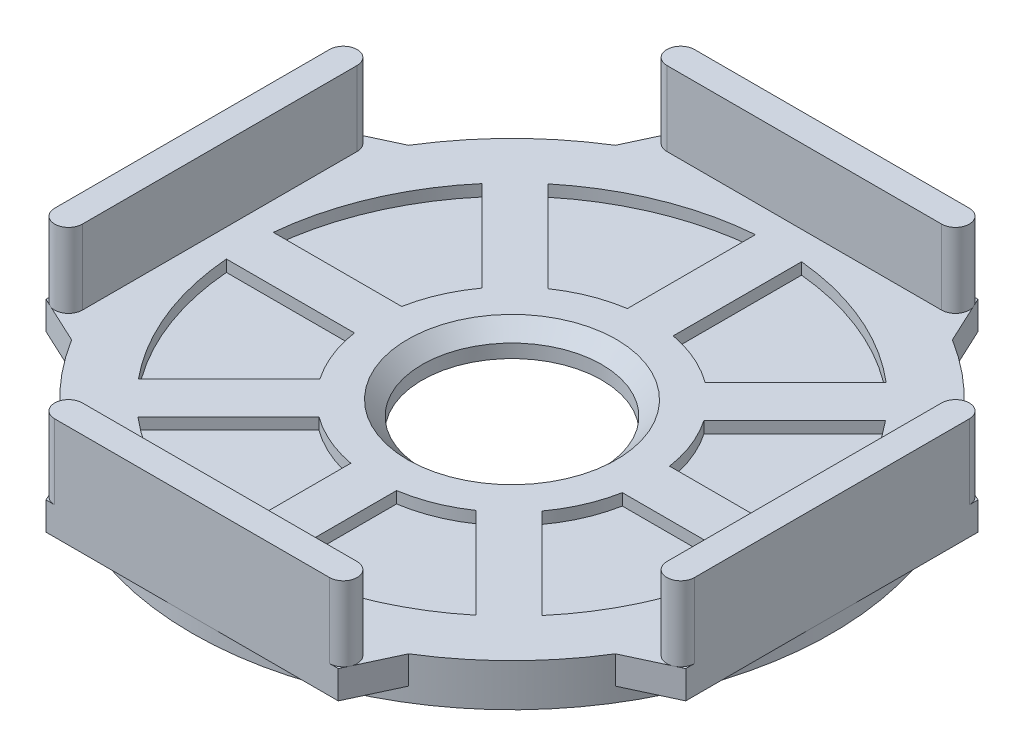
ISO-10303-21;
HEADER;
FILE_DESCRIPTION(('STEP AP214'),'2;1');
FILE_NAME('part.step','',(''),(''),'','','');
FILE_SCHEMA(('AUTOMOTIVE_DESIGN { 1 0 10303 214 1 1 1 1 }'));
ENDSEC;
DATA;
#1=APPLICATION_CONTEXT('core data for automotive mechanical design processes');
#2=APPLICATION_PROTOCOL_DEFINITION('international standard','automotive_design',2000,#1);
#3=PRODUCT_CONTEXT('',#1,'mechanical');
#4=PRODUCT('Part','Part','',(#3));
#5=PRODUCT_RELATED_PRODUCT_CATEGORY('part','',(#4));
#6=PRODUCT_DEFINITION_FORMATION('','',#4);
#7=PRODUCT_DEFINITION_CONTEXT('part definition',#1,'design');
#8=PRODUCT_DEFINITION('design','',#6,#7);
#9=PRODUCT_DEFINITION_SHAPE('','',#8);
#10=(LENGTH_UNIT() NAMED_UNIT(*) SI_UNIT(.MILLI.,.METRE.));
#11=(NAMED_UNIT(*) PLANE_ANGLE_UNIT() SI_UNIT($,.RADIAN.));
#12=(NAMED_UNIT(*) SI_UNIT($,.STERADIAN.) SOLID_ANGLE_UNIT());
#13=UNCERTAINTY_MEASURE_WITH_UNIT(LENGTH_MEASURE(1.E-05),#10,'distance_accuracy_value','');
#14=(GEOMETRIC_REPRESENTATION_CONTEXT(3) GLOBAL_UNCERTAINTY_ASSIGNED_CONTEXT((#13)) GLOBAL_UNIT_ASSIGNED_CONTEXT((#10,
#11,#12)) REPRESENTATION_CONTEXT('',''));
#15=CARTESIAN_POINT('',(0.,0.,0.));
#16=DIRECTION('',(0.,0.,1.));
#17=DIRECTION('',(1.,0.,0.));
#18=AXIS2_PLACEMENT_3D('',#15,#16,#17);
#19=CARTESIAN_POINT('',(0.,0.,0.));
#20=DIRECTION('',(0.,1.,0.));
#21=DIRECTION('',(0.,0.,1.));
#22=AXIS2_PLACEMENT_3D('',#19,#20,#21);
#23=PLANE('',#22);
#24=CARTESIAN_POINT('',(0.,0.,0.));
#25=DIRECTION('',(0.,-1.,0.));
#26=DIRECTION('',(0.,0.,-1.));
#27=AXIS2_PLACEMENT_3D('',#24,#25,#26);
#28=CIRCLE('',#27,44.);
#29=CARTESIAN_POINT('',(-37.4007040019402,0.,23.1773022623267));
#30=VERTEX_POINT('',#29);
#31=CARTESIAN_POINT('',(-44.,0.,-2.96197560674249E-13));
#32=VERTEX_POINT('',#31);
#33=EDGE_CURVE('E1568',#30,#32,#28,.T.);
#34=ORIENTED_EDGE('',*,*,#33,.F.);
#35=DIRECTION('',(0.906307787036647,0.,0.422618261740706));
#36=VECTOR('',#35,1.);
#37=CARTESIAN_POINT('',(-37.4007040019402,0.,23.1773022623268));
#38=LINE('',#37,#36);
#39=CARTESIAN_POINT('',(-44.0000000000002,0.,20.0999999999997));
#40=VERTEX_POINT('',#39);
#41=EDGE_CURVE('E1458',#40,#30,#38,.T.);
#42=ORIENTED_EDGE('',*,*,#41,.F.);
#43=DIRECTION('',(0.,0.,1.));
#44=VECTOR('',#43,1.);
#45=CARTESIAN_POINT('',(-44.0000000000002,0.,20.0999999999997));
#46=LINE('',#45,#44);
#47=EDGE_CURVE('E1454',#32,#40,#46,.T.);
#48=ORIENTED_EDGE('',*,*,#47,.F.);
#49=EDGE_LOOP('',(#34,#42,#48));
#50=FACE_BOUND('',#49,.T.);
#51=ADVANCED_FACE('F33',(#50),#23,.F.);
#52=CARTESIAN_POINT('',(-37.4007040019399,0.,-23.1773022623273));
#53=VERTEX_POINT('',#52);
#54=EDGE_CURVE('E1567',#32,#53,#28,.T.);
#55=ORIENTED_EDGE('',*,*,#54,.F.);
#56=CARTESIAN_POINT('',(-43.9999999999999,0.,-20.1000000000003));
#57=VERTEX_POINT('',#56);
#58=EDGE_CURVE('E1455',#57,#32,#46,.T.);
#59=ORIENTED_EDGE('',*,*,#58,.F.);
#60=DIRECTION('',(-0.906307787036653,0.,0.422618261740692));
#61=VECTOR('',#60,1.);
#62=CARTESIAN_POINT('',(-37.4007040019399,0.,-23.1773022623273));
#63=LINE('',#62,#61);
#64=EDGE_CURVE('E1452',#53,#57,#63,.T.);
#65=ORIENTED_EDGE('',*,*,#64,.F.);
#66=EDGE_LOOP('',(#55,#59,#65));
#67=FACE_BOUND('',#66,.T.);
#68=ADVANCED_FACE('F1644',(#67),#23,.F.);
#69=CARTESIAN_POINT('',(-23.1773022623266,0.,-37.4007040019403));
#70=VERTEX_POINT('',#69);
#71=CARTESIAN_POINT('',(4.48093745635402E-13,0.,-44.));
#72=VERTEX_POINT('',#71);
#73=EDGE_CURVE('E942',#70,#72,#28,.T.);
#74=ORIENTED_EDGE('',*,*,#73,.F.);
#75=DIRECTION('',(-0.422618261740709,0.,0.906307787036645));
#76=VECTOR('',#75,1.);
#77=CARTESIAN_POINT('',(-23.1773022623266,0.,-37.4007040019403));
#78=LINE('',#77,#76);
#79=CARTESIAN_POINT('',(-20.0999999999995,0.,-44.0000000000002));
#80=VERTEX_POINT('',#79);
#81=EDGE_CURVE('E1449',#80,#70,#78,.T.);
#82=ORIENTED_EDGE('',*,*,#81,.F.);
#83=DIRECTION('',(-1.,0.,0.));
#84=VECTOR('',#83,1.);
#85=CARTESIAN_POINT('',(-20.0999999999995,0.,-44.0000000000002));
#86=LINE('',#85,#84);
#87=EDGE_CURVE('E1445',#72,#80,#86,.T.);
#88=ORIENTED_EDGE('',*,*,#87,.F.);
#89=EDGE_LOOP('',(#74,#82,#88));
#90=FACE_BOUND('',#89,.T.);
#91=ADVANCED_FACE('F1566',(#90),#23,.F.);
#92=CARTESIAN_POINT('',(23.1773022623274,0.,-37.4007040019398));
#93=VERTEX_POINT('',#92);
#94=EDGE_CURVE('E949',#72,#93,#28,.T.);
#95=ORIENTED_EDGE('',*,*,#94,.F.);
#96=CARTESIAN_POINT('',(20.1000000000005,0.,-43.9999999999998));
#97=VERTEX_POINT('',#96);
#98=EDGE_CURVE('E1446',#97,#72,#86,.T.);
#99=ORIENTED_EDGE('',*,*,#98,.F.);
#100=DIRECTION('',(-0.422618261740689,0.,-0.906307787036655));
#101=VECTOR('',#100,1.);
#102=CARTESIAN_POINT('',(23.1773022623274,0.,-37.4007040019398));
#103=LINE('',#102,#101);
#104=EDGE_CURVE('E1443',#93,#97,#103,.T.);
#105=ORIENTED_EDGE('',*,*,#104,.F.);
#106=EDGE_LOOP('',(#95,#99,#105));
#107=FACE_BOUND('',#106,.T.);
#108=ADVANCED_FACE('F1521',(#107),#23,.F.);
#109=CARTESIAN_POINT('',(37.40070400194,0.,-23.177302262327));
#110=VERTEX_POINT('',#109);
#111=CARTESIAN_POINT('',(44.,0.,0.));
#112=VERTEX_POINT('',#111);
#113=EDGE_CURVE('E951',#110,#112,#28,.T.);
#114=ORIENTED_EDGE('',*,*,#113,.F.);
#115=DIRECTION('',(-0.90630778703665,0.,-0.4226182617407));
#116=VECTOR('',#115,1.);
#117=CARTESIAN_POINT('',(37.40070400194,0.,-23.177302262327));
#118=LINE('',#117,#116);
#119=CARTESIAN_POINT('',(44.,0.,-20.1));
#120=VERTEX_POINT('',#119);
#121=EDGE_CURVE('E1440',#120,#110,#118,.T.);
#122=ORIENTED_EDGE('',*,*,#121,.F.);
#123=DIRECTION('',(0.,0.,-1.));
#124=VECTOR('',#123,1.);
#125=CARTESIAN_POINT('',(44.,0.,-20.1));
#126=LINE('',#125,#124);
#127=EDGE_CURVE('E1441',#112,#120,#126,.T.);
#128=ORIENTED_EDGE('',*,*,#127,.F.);
#129=EDGE_LOOP('',(#114,#122,#128));
#130=FACE_BOUND('',#129,.T.);
#131=ADVANCED_FACE('F1588',(#130),#23,.F.);
#132=CARTESIAN_POINT('',(37.40070400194,0.,23.177302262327));
#133=VERTEX_POINT('',#132);
#134=EDGE_CURVE('E1575',#112,#133,#28,.T.);
#135=ORIENTED_EDGE('',*,*,#134,.F.);
#136=CARTESIAN_POINT('',(44.,0.,20.1));
#137=VERTEX_POINT('',#136);
#138=EDGE_CURVE('E1437',#137,#112,#126,.T.);
#139=ORIENTED_EDGE('',*,*,#138,.F.);
#140=DIRECTION('',(0.90630778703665,0.,-0.422618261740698));
#141=VECTOR('',#140,1.);
#142=CARTESIAN_POINT('',(37.40070400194,0.,23.177302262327));
#143=LINE('',#142,#141);
#144=EDGE_CURVE('E1470',#133,#137,#143,.T.);
#145=ORIENTED_EDGE('',*,*,#144,.F.);
#146=EDGE_LOOP('',(#135,#139,#145));
#147=FACE_BOUND('',#146,.T.);
#148=ADVANCED_FACE('F1587',(#147),#23,.F.);
#149=CARTESIAN_POINT('',(-1.44301375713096E-13,0.,44.));
#150=VERTEX_POINT('',#149);
#151=CARTESIAN_POINT('',(-23.1773022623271,0.,37.40070400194));
#152=VERTEX_POINT('',#151);
#153=EDGE_CURVE('E1571',#150,#152,#28,.T.);
#154=ORIENTED_EDGE('',*,*,#153,.F.);
#155=DIRECTION('',(1.,0.,0.));
#156=VECTOR('',#155,1.);
#157=CARTESIAN_POINT('',(20.0999999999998,0.,44.0000000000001));
#158=LINE('',#157,#156);
#159=CARTESIAN_POINT('',(-20.1000000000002,0.,44.));
#160=VERTEX_POINT('',#159);
#161=EDGE_CURVE('E1464',#160,#150,#158,.T.);
#162=ORIENTED_EDGE('',*,*,#161,.F.);
#163=DIRECTION('',(0.422618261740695,0.,0.906307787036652));
#164=VECTOR('',#163,1.);
#165=CARTESIAN_POINT('',(-23.1773022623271,0.,37.4007040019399));
#166=LINE('',#165,#164);
#167=EDGE_CURVE('E1461',#152,#160,#166,.T.);
#168=ORIENTED_EDGE('',*,*,#167,.F.);
#169=EDGE_LOOP('',(#154,#162,#168));
#170=FACE_BOUND('',#169,.T.);
#171=ADVANCED_FACE('F1619',(#170),#23,.F.);
#172=CARTESIAN_POINT('',(23.1773022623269,0.,37.4007040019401));
#173=VERTEX_POINT('',#172);
#174=EDGE_CURVE('E1572',#173,#150,#28,.T.);
#175=ORIENTED_EDGE('',*,*,#174,.F.);
#176=DIRECTION('',(0.422618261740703,0.,-0.906307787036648));
#177=VECTOR('',#176,1.);
#178=CARTESIAN_POINT('',(23.1773022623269,0.,37.4007040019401));
#179=LINE('',#178,#177);
#180=CARTESIAN_POINT('',(20.0999999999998,0.,44.0000000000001));
#181=VERTEX_POINT('',#180);
#182=EDGE_CURVE('E1467',#181,#173,#179,.T.);
#183=ORIENTED_EDGE('',*,*,#182,.F.);
#184=EDGE_CURVE('E1463',#150,#181,#158,.T.);
#185=ORIENTED_EDGE('',*,*,#184,.F.);
#186=EDGE_LOOP('',(#175,#183,#185));
#187=FACE_BOUND('',#186,.T.);
#188=ADVANCED_FACE('F1611',(#187),#23,.F.);
#189=CARTESIAN_POINT('',(0.,0.,0.));
#190=DIRECTION('',(0.,-1.,0.));
#191=DIRECTION('',(0.,0.,-1.));
#192=AXIS2_PLACEMENT_3D('',#189,#190,#191);
#193=CIRCLE('',#192,19.);
#194=CARTESIAN_POINT('',(0.,0.,-19.));
#195=VERTEX_POINT('',#194);
#196=EDGE_CURVE('E938',#195,#195,#193,.T.);
#197=ORIENTED_EDGE('',*,*,#196,.T.);
#198=EDGE_LOOP('',(#197));
#199=FACE_BOUND('',#198,.T.);
#200=CARTESIAN_POINT('',(0.,0.,0.));
#201=DIRECTION('',(0.,1.,0.));
#202=DIRECTION('',(0.,0.,1.));
#203=AXIS2_PLACEMENT_3D('',#200,#201,#202);
#204=CIRCLE('',#203,12.35);
#205=CARTESIAN_POINT('',(0.,0.,-12.35));
#206=VERTEX_POINT('',#205);
#207=EDGE_CURVE('E1380',#206,#206,#204,.T.);
#208=ORIENTED_EDGE('',*,*,#207,.T.);
#209=EDGE_LOOP('',(#208));
#210=FACE_BOUND('',#209,.T.);
#211=ADVANCED_FACE('F2394',(#199,#210),#23,.F.);
#212=CARTESIAN_POINT('',(0.,3.85,0.));
#213=DIRECTION('',(0.,1.,0.));
#214=DIRECTION('',(0.,0.,1.));
#215=AXIS2_PLACEMENT_3D('',#212,#213,#214);
#216=PLANE('',#215);
#217=DIRECTION('',(-1.,0.,0.));
#218=VECTOR('',#217,1.);
#219=CARTESIAN_POINT('',(-20.0999999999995,3.85,-44.0000000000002));
#220=LINE('',#219,#218);
#221=CARTESIAN_POINT('',(20.1000000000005,3.85,-43.9999999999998));
#222=VERTEX_POINT('',#221);
#223=CARTESIAN_POINT('',(18.9000000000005,3.85,-43.9999999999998));
#224=VERTEX_POINT('',#223);
#225=EDGE_CURVE('E1394',#222,#224,#220,.T.);
#226=ORIENTED_EDGE('',*,*,#225,.T.);
#227=CARTESIAN_POINT('',(18.9000000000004,3.85,-42.0999999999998));
#228=DIRECTION('',(0.,1.,0.));
#229=DIRECTION('',(0.,0.,-1.));
#230=AXIS2_PLACEMENT_3D('',#227,#228,#229);
#231=CIRCLE('',#230,1.90000000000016);
#232=CARTESIAN_POINT('',(20.5334033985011,3.85,-43.0705634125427));
#233=VERTEX_POINT('',#232);
#234=EDGE_CURVE('E1201',#233,#224,#231,.T.);
#235=ORIENTED_EDGE('',*,*,#234,.F.);
#236=DIRECTION('',(-0.422618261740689,0.,-0.906307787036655));
#237=VECTOR('',#236,1.);
#238=CARTESIAN_POINT('',(23.1773022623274,3.85,-37.4007040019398));
#239=LINE('',#238,#237);
#240=EDGE_CURVE('E1389',#233,#222,#239,.T.);
#241=ORIENTED_EDGE('',*,*,#240,.T.);
#242=EDGE_LOOP('',(#226,#235,#241));
#243=FACE_BOUND('',#242,.T.);
#244=ADVANCED_FACE('F2519',(#243),#216,.T.);
#245=DIRECTION('',(-0.422618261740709,0.,0.906307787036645));
#246=VECTOR('',#245,1.);
#247=CARTESIAN_POINT('',(-23.1773022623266,3.85,-37.4007040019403));
#248=LINE('',#247,#246);
#249=CARTESIAN_POINT('',(-20.0999999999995,3.85,-44.0000000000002));
#250=VERTEX_POINT('',#249);
#251=CARTESIAN_POINT('',(-20.5334033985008,3.85,-43.0705634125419));
#252=VERTEX_POINT('',#251);
#253=EDGE_CURVE('E1397',#250,#252,#248,.T.);
#254=ORIENTED_EDGE('',*,*,#253,.T.);
#255=CARTESIAN_POINT('',(-18.8999999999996,3.85,-42.1000000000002));
#256=DIRECTION('',(0.,1.,0.));
#257=DIRECTION('',(0.,0.,1.));
#258=AXIS2_PLACEMENT_3D('',#255,#256,#257);
#259=CIRCLE('',#258,1.90000000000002);
#260=CARTESIAN_POINT('',(-18.8999999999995,3.85,-44.0000000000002));
#261=VERTEX_POINT('',#260);
#262=EDGE_CURVE('E1224',#261,#252,#259,.T.);
#263=ORIENTED_EDGE('',*,*,#262,.F.);
#264=EDGE_CURVE('E1393',#261,#250,#220,.T.);
#265=ORIENTED_EDGE('',*,*,#264,.T.);
#266=EDGE_LOOP('',(#254,#263,#265));
#267=FACE_BOUND('',#266,.T.);
#268=ADVANCED_FACE('F1561',(#267),#216,.T.);
#269=CARTESIAN_POINT('',(0.,3.85,0.));
#270=DIRECTION('',(0.,1.,0.));
#271=DIRECTION('',(0.,0.,1.));
#272=AXIS2_PLACEMENT_3D('',#269,#270,#271);
#273=CIRCLE('',#272,14.3500000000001);
#274=CARTESIAN_POINT('',(0.,3.85,14.3500000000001));
#275=VERTEX_POINT('',#274);
#276=EDGE_CURVE('E11',#275,#275,#273,.F.);
#277=ORIENTED_EDGE('',*,*,#276,.T.);
#278=EDGE_LOOP('',(#277));
#279=FACE_BOUND('',#278,.T.);
#280=CARTESIAN_POINT('',(0.,3.85,0.));
#281=DIRECTION('',(0.,1.,0.));
#282=DIRECTION('',(0.,0.,1.));
#283=AXIS2_PLACEMENT_3D('',#280,#281,#282);
#284=CIRCLE('',#283,36.5);
#285=CARTESIAN_POINT('',(-2.90200299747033,3.85,-36.3844524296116));
#286=VERTEX_POINT('',#285);
#287=CARTESIAN_POINT('',(-23.215591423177,3.85,-28.1653388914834));
#288=VERTEX_POINT('',#287);
#289=EDGE_CURVE('E948',#286,#288,#284,.T.);
#290=ORIENTED_EDGE('',*,*,#289,.F.);
#291=DIRECTION('',(0.,0.,-1.));
#292=VECTOR('',#291,1.);
#293=CARTESIAN_POINT('',(-2.90200299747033,3.85,-36.3844524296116));
#294=LINE('',#293,#292);
#295=CARTESIAN_POINT('',(-2.90200299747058,3.85,-18.7770705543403));
#296=VERTEX_POINT('',#295);
#297=EDGE_CURVE('E956',#296,#286,#294,.T.);
#298=ORIENTED_EDGE('',*,*,#297,.F.);
#299=CARTESIAN_POINT('',(0.,3.85,0.));
#300=DIRECTION('',(0.,-1.,0.));
#301=DIRECTION('',(0.,0.,1.));
#302=AXIS2_PLACEMENT_3D('',#299,#300,#301);
#303=CIRCLE('',#302,19.);
#304=CARTESIAN_POINT('',(-10.7302389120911,3.85,-15.6799863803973));
#305=VERTEX_POINT('',#304);
#306=EDGE_CURVE('E970',#305,#296,#303,.T.);
#307=ORIENTED_EDGE('',*,*,#306,.F.);
#308=DIRECTION('',(0.707106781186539,0.,0.707106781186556));
#309=VECTOR('',#308,1.);
#310=CARTESIAN_POINT('',(-23.215591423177,3.85,-28.1653388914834));
#311=LINE('',#310,#309);
#312=EDGE_CURVE('E967',#288,#305,#311,.T.);
#313=ORIENTED_EDGE('',*,*,#312,.F.);
#314=EDGE_LOOP('',(#290,#298,#307,#313));
#315=FACE_BOUND('',#314,.T.);
#316=CARTESIAN_POINT('',(0.,3.85,0.));
#317=DIRECTION('',(0.,1.,0.));
#318=DIRECTION('',(0.,0.,1.));
#319=AXIS2_PLACEMENT_3D('',#316,#317,#318);
#320=CIRCLE('',#319,36.5);
#321=CARTESIAN_POINT('',(-27.7797190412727,3.85,-23.6756670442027));
#322=VERTEX_POINT('',#321);
#323=CARTESIAN_POINT('',(-36.3318042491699,3.85,-3.50000000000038));
#324=VERTEX_POINT('',#323);
#325=EDGE_CURVE('E977',#322,#324,#320,.T.);
#326=ORIENTED_EDGE('',*,*,#325,.F.);
#327=DIRECTION('',(-0.707106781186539,0.,-0.707106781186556));
#328=VECTOR('',#327,1.);
#329=CARTESIAN_POINT('',(-27.7797190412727,3.85,-23.6756670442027));
#330=LINE('',#329,#328);
#331=CARTESIAN_POINT('',(-15.3294199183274,3.85,-11.2253679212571));
#332=VERTEX_POINT('',#331);
#333=EDGE_CURVE('E988',#332,#322,#330,.T.);
#334=ORIENTED_EDGE('',*,*,#333,.F.);
#335=CARTESIAN_POINT('',(0.,3.85,0.));
#336=DIRECTION('',(0.,-1.,0.));
#337=DIRECTION('',(0.,0.,1.));
#338=AXIS2_PLACEMENT_3D('',#335,#336,#337);
#339=CIRCLE('',#338,19.);
#340=CARTESIAN_POINT('',(-18.6748493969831,3.85,-3.5000000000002));
#341=VERTEX_POINT('',#340);
#342=EDGE_CURVE('E1002',#341,#332,#339,.T.);
#343=ORIENTED_EDGE('',*,*,#342,.F.);
#344=DIRECTION('',(1.,0.,0.));
#345=VECTOR('',#344,1.);
#346=CARTESIAN_POINT('',(-36.3318042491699,3.85,-3.50000000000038));
#347=LINE('',#346,#345);
#348=EDGE_CURVE('E999',#324,#341,#347,.T.);
#349=ORIENTED_EDGE('',*,*,#348,.F.);
#350=EDGE_LOOP('',(#326,#334,#343,#349));
#351=FACE_BOUND('',#350,.T.);
#352=CARTESIAN_POINT('',(0.,3.85,0.));
#353=DIRECTION('',(0.,1.,0.));
#354=DIRECTION('',(0.,0.,1.));
#355=AXIS2_PLACEMENT_3D('',#352,#353,#354);
#356=CIRCLE('',#355,36.5);
#357=CARTESIAN_POINT('',(-36.3844524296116,3.85,2.90200299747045));
#358=VERTEX_POINT('',#357);
#359=CARTESIAN_POINT('',(-28.1653388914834,3.85,23.2155914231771));
#360=VERTEX_POINT('',#359);
#361=EDGE_CURVE('E1009',#358,#360,#356,.T.);
#362=ORIENTED_EDGE('',*,*,#361,.F.);
#363=DIRECTION('',(-1.,0.,0.));
#364=VECTOR('',#363,1.);
#365=CARTESIAN_POINT('',(-36.3844524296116,3.85,2.90200299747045));
#366=LINE('',#365,#364);
#367=CARTESIAN_POINT('',(-18.7770705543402,3.85,2.90200299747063));
#368=VERTEX_POINT('',#367);
#369=EDGE_CURVE('E1020',#368,#358,#366,.T.);
#370=ORIENTED_EDGE('',*,*,#369,.F.);
#371=CARTESIAN_POINT('',(0.,3.85,0.));
#372=DIRECTION('',(0.,-1.,0.));
#373=DIRECTION('',(0.,0.,1.));
#374=AXIS2_PLACEMENT_3D('',#371,#372,#373);
#375=CIRCLE('',#374,19.);
#376=CARTESIAN_POINT('',(-15.6799863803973,3.85,10.7302389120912));
#377=VERTEX_POINT('',#376);
#378=EDGE_CURVE('E1034',#377,#368,#375,.T.);
#379=ORIENTED_EDGE('',*,*,#378,.F.);
#380=DIRECTION('',(0.707106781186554,0.,-0.707106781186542));
#381=VECTOR('',#380,1.);
#382=CARTESIAN_POINT('',(-28.1653388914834,3.85,23.2155914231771));
#383=LINE('',#382,#381);
#384=EDGE_CURVE('E1031',#360,#377,#383,.T.);
#385=ORIENTED_EDGE('',*,*,#384,.F.);
#386=EDGE_LOOP('',(#362,#370,#379,#385));
#387=FACE_BOUND('',#386,.T.);
#388=CARTESIAN_POINT('',(0.,3.85,0.));
#389=DIRECTION('',(0.,1.,0.));
#390=DIRECTION('',(0.,0.,1.));
#391=AXIS2_PLACEMENT_3D('',#388,#389,#390);
#392=CIRCLE('',#391,36.5);
#393=CARTESIAN_POINT('',(-23.6756670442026,3.85,27.7797190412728));
#394=VERTEX_POINT('',#393);
#395=CARTESIAN_POINT('',(-3.50000000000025,3.85,36.3318042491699));
#396=VERTEX_POINT('',#395);
#397=EDGE_CURVE('E1041',#394,#396,#392,.T.);
#398=ORIENTED_EDGE('',*,*,#397,.F.);
#399=DIRECTION('',(-0.707106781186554,0.,0.707106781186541));
#400=VECTOR('',#399,1.);
#401=CARTESIAN_POINT('',(-23.6756670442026,3.85,27.7797190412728));
#402=LINE('',#401,#400);
#403=CARTESIAN_POINT('',(-11.225367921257,3.85,15.3294199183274));
#404=VERTEX_POINT('',#403);
#405=EDGE_CURVE('E1052',#404,#394,#402,.T.);
#406=ORIENTED_EDGE('',*,*,#405,.F.);
#407=CARTESIAN_POINT('',(0.,3.85,0.));
#408=DIRECTION('',(0.,-1.,0.));
#409=DIRECTION('',(0.,0.,1.));
#410=AXIS2_PLACEMENT_3D('',#407,#408,#409);
#411=CIRCLE('',#410,19.);
#412=CARTESIAN_POINT('',(-3.50000000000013,3.85,18.6748493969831));
#413=VERTEX_POINT('',#412);
#414=EDGE_CURVE('E1066',#413,#404,#411,.T.);
#415=ORIENTED_EDGE('',*,*,#414,.F.);
#416=DIRECTION('',(0.,0.,-1.));
#417=VECTOR('',#416,1.);
#418=CARTESIAN_POINT('',(-3.50000000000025,3.85,36.3318042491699));
#419=LINE('',#418,#417);
#420=EDGE_CURVE('E1063',#396,#413,#419,.T.);
#421=ORIENTED_EDGE('',*,*,#420,.F.);
#422=EDGE_LOOP('',(#398,#406,#415,#421));
#423=FACE_BOUND('',#422,.T.);
#424=CARTESIAN_POINT('',(0.,3.85,0.));
#425=DIRECTION('',(0.,1.,0.));
#426=DIRECTION('',(0.,0.,1.));
#427=AXIS2_PLACEMENT_3D('',#424,#425,#426);
#428=CIRCLE('',#427,36.5);
#429=CARTESIAN_POINT('',(2.90200299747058,3.85,36.3844524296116));
#430=VERTEX_POINT('',#429);
#431=CARTESIAN_POINT('',(23.2155914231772,3.85,28.1653388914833));
#432=VERTEX_POINT('',#431);
#433=EDGE_CURVE('E1073',#430,#432,#428,.T.);
#434=ORIENTED_EDGE('',*,*,#433,.F.);
#435=DIRECTION('',(0.,0.,1.));
#436=VECTOR('',#435,1.);
#437=CARTESIAN_POINT('',(2.90200299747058,3.85,36.3844524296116));
#438=LINE('',#437,#436);
#439=CARTESIAN_POINT('',(2.9020029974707,3.85,18.7770705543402));
#440=VERTEX_POINT('',#439);
#441=EDGE_CURVE('E1084',#440,#430,#438,.T.);
#442=ORIENTED_EDGE('',*,*,#441,.F.);
#443=CARTESIAN_POINT('',(0.,3.85,0.));
#444=DIRECTION('',(0.,-1.,0.));
#445=DIRECTION('',(0.,0.,1.));
#446=AXIS2_PLACEMENT_3D('',#443,#444,#445);
#447=CIRCLE('',#446,19.);
#448=CARTESIAN_POINT('',(10.7302389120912,3.85,15.6799863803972));
#449=VERTEX_POINT('',#448);
#450=EDGE_CURVE('E1098',#449,#440,#447,.T.);
#451=ORIENTED_EDGE('',*,*,#450,.F.);
#452=DIRECTION('',(-0.707106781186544,0.,-0.707106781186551));
#453=VECTOR('',#452,1.);
#454=CARTESIAN_POINT('',(23.2155914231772,3.85,28.1653388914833));
#455=LINE('',#454,#453);
#456=EDGE_CURVE('E1095',#432,#449,#455,.T.);
#457=ORIENTED_EDGE('',*,*,#456,.F.);
#458=EDGE_LOOP('',(#434,#442,#451,#457));
#459=FACE_BOUND('',#458,.T.);
#460=CARTESIAN_POINT('',(0.,3.85,0.));
#461=DIRECTION('',(0.,1.,0.));
#462=DIRECTION('',(0.,0.,1.));
#463=AXIS2_PLACEMENT_3D('',#460,#461,#462);
#464=CIRCLE('',#463,36.5);
#465=CARTESIAN_POINT('',(27.7797190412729,3.85,23.6756670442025));
#466=VERTEX_POINT('',#465);
#467=CARTESIAN_POINT('',(36.3318042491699,3.85,3.50000000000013));
#468=VERTEX_POINT('',#467);
#469=EDGE_CURVE('E1105',#466,#468,#464,.T.);
#470=ORIENTED_EDGE('',*,*,#469,.F.);
#471=DIRECTION('',(0.707106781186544,0.,0.707106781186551));
#472=VECTOR('',#471,1.);
#473=CARTESIAN_POINT('',(27.7797190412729,3.85,23.6756670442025));
#474=LINE('',#473,#472);
#475=CARTESIAN_POINT('',(15.3294199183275,3.85,11.225367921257));
#476=VERTEX_POINT('',#475);
#477=EDGE_CURVE('E1116',#476,#466,#474,.T.);
#478=ORIENTED_EDGE('',*,*,#477,.F.);
#479=CARTESIAN_POINT('',(0.,3.85,0.));
#480=DIRECTION('',(0.,-1.,0.));
#481=DIRECTION('',(0.,0.,1.));
#482=AXIS2_PLACEMENT_3D('',#479,#480,#481);
#483=CIRCLE('',#482,19.);
#484=CARTESIAN_POINT('',(18.6748493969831,3.85,3.50000000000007));
#485=VERTEX_POINT('',#484);
#486=EDGE_CURVE('E1130',#485,#476,#483,.T.);
#487=ORIENTED_EDGE('',*,*,#486,.F.);
#488=DIRECTION('',(-1.,0.,0.));
#489=VECTOR('',#488,1.);
#490=CARTESIAN_POINT('',(36.3318042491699,3.85,3.50000000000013));
#491=LINE('',#490,#489);
#492=EDGE_CURVE('E1127',#468,#485,#491,.T.);
#493=ORIENTED_EDGE('',*,*,#492,.F.);
#494=EDGE_LOOP('',(#470,#478,#487,#493));
#495=FACE_BOUND('',#494,.T.);
#496=CARTESIAN_POINT('',(0.,3.85,0.));
#497=DIRECTION('',(0.,1.,0.));
#498=DIRECTION('',(0.,0.,1.));
#499=AXIS2_PLACEMENT_3D('',#496,#497,#498);
#500=CIRCLE('',#499,36.5);
#501=CARTESIAN_POINT('',(36.3844524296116,3.85,-2.90200299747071));
#502=VERTEX_POINT('',#501);
#503=CARTESIAN_POINT('',(28.1653388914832,3.85,-23.2155914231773));
#504=VERTEX_POINT('',#503);
#505=EDGE_CURVE('E1137',#502,#504,#500,.T.);
#506=ORIENTED_EDGE('',*,*,#505,.F.);
#507=DIRECTION('',(1.,0.,0.));
#508=VECTOR('',#507,1.);
#509=CARTESIAN_POINT('',(36.3844524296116,3.85,-2.90200299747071));
#510=LINE('',#509,#508);
#511=CARTESIAN_POINT('',(18.7770705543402,3.85,-2.90200299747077));
#512=VERTEX_POINT('',#511);
#513=EDGE_CURVE('E1148',#512,#502,#510,.T.);
#514=ORIENTED_EDGE('',*,*,#513,.F.);
#515=CARTESIAN_POINT('',(0.,3.85,0.));
#516=DIRECTION('',(0.,-1.,0.));
#517=DIRECTION('',(0.,0.,1.));
#518=AXIS2_PLACEMENT_3D('',#515,#516,#517);
#519=CIRCLE('',#518,19.);
#520=CARTESIAN_POINT('',(15.6799863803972,3.85,-10.7302389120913));
#521=VERTEX_POINT('',#520);
#522=EDGE_CURVE('E1162',#521,#512,#519,.T.);
#523=ORIENTED_EDGE('',*,*,#522,.F.);
#524=DIRECTION('',(-0.707106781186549,0.,0.707106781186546));
#525=VECTOR('',#524,1.);
#526=CARTESIAN_POINT('',(28.1653388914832,3.85,-23.2155914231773));
#527=LINE('',#526,#525);
#528=EDGE_CURVE('E1159',#504,#521,#527,.T.);
#529=ORIENTED_EDGE('',*,*,#528,.F.);
#530=EDGE_LOOP('',(#506,#514,#523,#529));
#531=FACE_BOUND('',#530,.T.);
#532=CARTESIAN_POINT('',(0.,3.85,0.));
#533=DIRECTION('',(0.,1.,0.));
#534=DIRECTION('',(0.,0.,1.));
#535=AXIS2_PLACEMENT_3D('',#532,#533,#534);
#536=CIRCLE('',#535,36.5);
#537=CARTESIAN_POINT('',(23.6756670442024,3.85,-27.779719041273));
#538=VERTEX_POINT('',#537);
#539=CARTESIAN_POINT('',(3.5,3.85,-36.3318042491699));
#540=VERTEX_POINT('',#539);
#541=EDGE_CURVE('E1169',#538,#540,#536,.T.);
#542=ORIENTED_EDGE('',*,*,#541,.F.);
#543=DIRECTION('',(0.707106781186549,0.,-0.707106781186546));
#544=VECTOR('',#543,1.);
#545=CARTESIAN_POINT('',(23.6756670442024,3.85,-27.779719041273));
#546=LINE('',#545,#544);
#547=CARTESIAN_POINT('',(11.2253679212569,3.85,-15.3294199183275));
#548=VERTEX_POINT('',#547);
#549=EDGE_CURVE('E1180',#548,#538,#546,.T.);
#550=ORIENTED_EDGE('',*,*,#549,.F.);
#551=CARTESIAN_POINT('',(0.,3.85,0.));
#552=DIRECTION('',(0.,-1.,0.));
#553=DIRECTION('',(0.,0.,1.));
#554=AXIS2_PLACEMENT_3D('',#551,#552,#553);
#555=CIRCLE('',#554,19.);
#556=CARTESIAN_POINT('',(3.5,3.85,-18.6748493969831));
#557=VERTEX_POINT('',#556);
#558=EDGE_CURVE('E1194',#557,#548,#555,.T.);
#559=ORIENTED_EDGE('',*,*,#558,.F.);
#560=DIRECTION('',(0.,0.,1.));
#561=VECTOR('',#560,1.);
#562=CARTESIAN_POINT('',(3.5,3.85,-36.3318042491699));
#563=LINE('',#562,#561);
#564=EDGE_CURVE('E1191',#540,#557,#563,.T.);
#565=ORIENTED_EDGE('',*,*,#564,.F.);
#566=EDGE_LOOP('',(#542,#550,#559,#565));
#567=FACE_BOUND('',#566,.T.);
#568=CARTESIAN_POINT('',(23.1773022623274,3.85,-37.4007040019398));
#569=VERTEX_POINT('',#568);
#570=CARTESIAN_POINT('',(20.6934261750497,3.85,-42.7273934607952));
#571=VERTEX_POINT('',#570);
#572=EDGE_CURVE('E1390',#569,#571,#239,.T.);
#573=ORIENTED_EDGE('',*,*,#572,.T.);
#574=CARTESIAN_POINT('',(18.9000000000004,3.85,-40.1999999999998));
#575=VERTEX_POINT('',#574);
#576=EDGE_CURVE('E1219',#575,#571,#231,.T.);
#577=ORIENTED_EDGE('',*,*,#576,.F.);
#578=DIRECTION('',(1.,0.,0.));
#579=VECTOR('',#578,1.);
#580=CARTESIAN_POINT('',(-18.8999999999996,3.85,-40.2000000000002));
#581=LINE('',#580,#579);
#582=CARTESIAN_POINT('',(-18.8999999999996,3.85,-40.2000000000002));
#583=VERTEX_POINT('',#582);
#584=EDGE_CURVE('E1212',#583,#575,#581,.T.);
#585=ORIENTED_EDGE('',*,*,#584,.F.);
#586=CARTESIAN_POINT('',(-20.6934261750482,3.85,-42.7273934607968));
#587=VERTEX_POINT('',#586);
#588=EDGE_CURVE('E1222',#587,#583,#259,.T.);
#589=ORIENTED_EDGE('',*,*,#588,.F.);
#590=CARTESIAN_POINT('',(-23.1773022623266,3.85,-37.4007040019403));
#591=VERTEX_POINT('',#590);
#592=EDGE_CURVE('E1396',#587,#591,#248,.T.);
#593=ORIENTED_EDGE('',*,*,#592,.T.);
#594=CARTESIAN_POINT('',(0.,3.85,0.));
#595=DIRECTION('',(0.,1.,0.));
#596=DIRECTION('',(0.,0.,1.));
#597=AXIS2_PLACEMENT_3D('',#594,#595,#596);
#598=CIRCLE('',#597,44.);
#599=CARTESIAN_POINT('',(-37.4007040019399,3.85,-23.1773022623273));
#600=VERTEX_POINT('',#599);
#601=EDGE_CURVE('E1400',#591,#600,#598,.T.);
#602=ORIENTED_EDGE('',*,*,#601,.T.);
#603=DIRECTION('',(-0.906307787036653,0.,0.422618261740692));
#604=VECTOR('',#603,1.);
#605=CARTESIAN_POINT('',(-37.4007040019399,3.85,-23.1773022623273));
#606=LINE('',#605,#604);
#607=CARTESIAN_POINT('',(-42.7273934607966,3.85,-20.6934261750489));
#608=VERTEX_POINT('',#607);
#609=EDGE_CURVE('E1404',#600,#608,#606,.T.);
#610=ORIENTED_EDGE('',*,*,#609,.T.);
#611=CARTESIAN_POINT('',(-42.0999999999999,3.85,-18.9000000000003));
#612=DIRECTION('',(0.,1.,0.));
#613=DIRECTION('',(0.,0.,-1.));
#614=AXIS2_PLACEMENT_3D('',#611,#612,#613);
#615=CIRCLE('',#614,1.90000000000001);
#616=CARTESIAN_POINT('',(-40.1999999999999,3.85,-18.9000000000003));
#617=VERTEX_POINT('',#616);
#618=EDGE_CURVE('E1255',#617,#608,#615,.T.);
#619=ORIENTED_EDGE('',*,*,#618,.F.);
#620=DIRECTION('',(0.,0.,-1.));
#621=VECTOR('',#620,1.);
#622=CARTESIAN_POINT('',(-40.2000000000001,3.85,18.8999999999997));
#623=LINE('',#622,#621);
#624=CARTESIAN_POINT('',(-40.2000000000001,3.85,18.8999999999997));
#625=VERTEX_POINT('',#624);
#626=EDGE_CURVE('E1248',#625,#617,#623,.T.);
#627=ORIENTED_EDGE('',*,*,#626,.F.);
#628=CARTESIAN_POINT('',(-42.1000000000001,3.85,18.8999999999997));
#629=DIRECTION('',(0.,1.,0.));
#630=DIRECTION('',(0.,0.,1.));
#631=AXIS2_PLACEMENT_3D('',#628,#629,#630);
#632=CIRCLE('',#631,1.90000000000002);
#633=CARTESIAN_POINT('',(-42.7273934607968,3.85,20.6934261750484));
#634=VERTEX_POINT('',#633);
#635=EDGE_CURVE('E1258',#634,#625,#632,.T.);
#636=ORIENTED_EDGE('',*,*,#635,.F.);
#637=DIRECTION('',(0.906307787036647,0.,0.422618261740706));
#638=VECTOR('',#637,1.);
#639=CARTESIAN_POINT('',(-37.4007040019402,3.85,23.1773022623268));
#640=LINE('',#639,#638);
#641=CARTESIAN_POINT('',(-37.4007040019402,3.85,23.1773022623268));
#642=VERTEX_POINT('',#641);
#643=EDGE_CURVE('E1410',#634,#642,#640,.T.);
#644=ORIENTED_EDGE('',*,*,#643,.T.);
#645=CARTESIAN_POINT('',(0.,3.85,0.));
#646=DIRECTION('',(0.,1.,0.));
#647=DIRECTION('',(0.,0.,1.));
#648=AXIS2_PLACEMENT_3D('',#645,#646,#647);
#649=CIRCLE('',#648,44.);
#650=CARTESIAN_POINT('',(-23.1773022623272,3.85,37.4007040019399));
#651=VERTEX_POINT('',#650);
#652=EDGE_CURVE('E1414',#642,#651,#649,.T.);
#653=ORIENTED_EDGE('',*,*,#652,.T.);
#654=DIRECTION('',(0.422618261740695,0.,0.906307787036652));
#655=VECTOR('',#654,1.);
#656=CARTESIAN_POINT('',(-23.1773022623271,3.85,37.4007040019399));
#657=LINE('',#656,#655);
#658=CARTESIAN_POINT('',(-20.6934261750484,3.85,42.7273934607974));
#659=VERTEX_POINT('',#658);
#660=EDGE_CURVE('E1418',#651,#659,#657,.T.);
#661=ORIENTED_EDGE('',*,*,#660,.T.);
#662=CARTESIAN_POINT('',(-18.9000000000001,3.85,42.0999999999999));
#663=DIRECTION('',(0.,1.,0.));
#664=DIRECTION('',(0.,0.,-1.));
#665=AXIS2_PLACEMENT_3D('',#662,#663,#664);
#666=CIRCLE('',#665,1.89999999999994);
#667=CARTESIAN_POINT('',(-18.9000000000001,3.85,40.1999999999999));
#668=VERTEX_POINT('',#667);
#669=EDGE_CURVE('E1291',#668,#659,#666,.T.);
#670=ORIENTED_EDGE('',*,*,#669,.F.);
#671=DIRECTION('',(-1.,0.,0.));
#672=VECTOR('',#671,1.);
#673=CARTESIAN_POINT('',(18.8999999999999,3.85,40.2000000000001));
#674=LINE('',#673,#672);
#675=CARTESIAN_POINT('',(18.8999999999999,3.85,40.2000000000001));
#676=VERTEX_POINT('',#675);
#677=EDGE_CURVE('E1284',#676,#668,#674,.T.);
#678=ORIENTED_EDGE('',*,*,#677,.F.);
#679=CARTESIAN_POINT('',(18.8999999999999,3.85,42.1000000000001));
#680=DIRECTION('',(0.,1.,0.));
#681=DIRECTION('',(0.,0.,1.));
#682=AXIS2_PLACEMENT_3D('',#679,#680,#681);
#683=CIRCLE('',#682,1.90000000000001);
#684=CARTESIAN_POINT('',(20.6934261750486,3.85,42.7273934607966));
#685=VERTEX_POINT('',#684);
#686=EDGE_CURVE('E1294',#685,#676,#683,.T.);
#687=ORIENTED_EDGE('',*,*,#686,.F.);
#688=DIRECTION('',(0.422618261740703,0.,-0.906307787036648));
#689=VECTOR('',#688,1.);
#690=CARTESIAN_POINT('',(23.1773022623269,3.85,37.4007040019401));
#691=LINE('',#690,#689);
#692=CARTESIAN_POINT('',(23.1773022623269,3.85,37.4007040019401));
#693=VERTEX_POINT('',#692);
#694=EDGE_CURVE('E1424',#685,#693,#691,.T.);
#695=ORIENTED_EDGE('',*,*,#694,.T.);
#696=CARTESIAN_POINT('',(0.,3.85,0.));
#697=DIRECTION('',(0.,1.,0.));
#698=DIRECTION('',(0.,0.,1.));
#699=AXIS2_PLACEMENT_3D('',#696,#697,#698);
#700=CIRCLE('',#699,44.);
#701=CARTESIAN_POINT('',(37.40070400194,3.85,23.177302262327));
#702=VERTEX_POINT('',#701);
#703=EDGE_CURVE('E1428',#693,#702,#700,.T.);
#704=ORIENTED_EDGE('',*,*,#703,.T.);
#705=DIRECTION('',(0.90630778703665,0.,-0.422618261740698));
#706=VECTOR('',#705,1.);
#707=CARTESIAN_POINT('',(37.40070400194,3.85,23.177302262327));
#708=LINE('',#707,#706);
#709=CARTESIAN_POINT('',(42.7273934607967,3.85,20.6934261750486));
#710=VERTEX_POINT('',#709);
#711=EDGE_CURVE('E1432',#702,#710,#708,.T.);
#712=ORIENTED_EDGE('',*,*,#711,.T.);
#713=CARTESIAN_POINT('',(42.1,3.85,18.9));
#714=DIRECTION('',(0.,1.,0.));
#715=DIRECTION('',(0.,0.,-1.));
#716=AXIS2_PLACEMENT_3D('',#713,#714,#715);
#717=CIRCLE('',#716,1.90000000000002);
#718=CARTESIAN_POINT('',(40.2,3.85,18.9));
#719=VERTEX_POINT('',#718);
#720=EDGE_CURVE('E1320',#719,#710,#717,.T.);
#721=ORIENTED_EDGE('',*,*,#720,.F.);
#722=DIRECTION('',(0.,0.,1.));
#723=VECTOR('',#722,1.);
#724=CARTESIAN_POINT('',(40.2,3.85,-18.9));
#725=LINE('',#724,#723);
#726=CARTESIAN_POINT('',(40.2,3.85,-18.9));
#727=VERTEX_POINT('',#726);
#728=EDGE_CURVE('E1332',#727,#719,#725,.T.);
#729=ORIENTED_EDGE('',*,*,#728,.F.);
#730=CARTESIAN_POINT('',(42.1,3.85,-18.9));
#731=DIRECTION('',(0.,1.,0.));
#732=DIRECTION('',(0.,0.,1.));
#733=AXIS2_PLACEMENT_3D('',#730,#731,#732);
#734=CIRCLE('',#733,1.90000000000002);
#735=CARTESIAN_POINT('',(42.7273934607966,3.85,-20.6934261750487));
#736=VERTEX_POINT('',#735);
#737=EDGE_CURVE('E1331',#736,#727,#734,.T.);
#738=ORIENTED_EDGE('',*,*,#737,.F.);
#739=DIRECTION('',(-0.90630778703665,0.,-0.4226182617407));
#740=VECTOR('',#739,1.);
#741=CARTESIAN_POINT('',(37.40070400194,3.85,-23.177302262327));
#742=LINE('',#741,#740);
#743=CARTESIAN_POINT('',(37.40070400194,3.85,-23.177302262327));
#744=VERTEX_POINT('',#743);
#745=EDGE_CURVE('E1375',#736,#744,#742,.T.);
#746=ORIENTED_EDGE('',*,*,#745,.T.);
#747=CARTESIAN_POINT('',(0.,3.85,0.));
#748=DIRECTION('',(0.,1.,0.));
#749=DIRECTION('',(0.,0.,1.));
#750=AXIS2_PLACEMENT_3D('',#747,#748,#749);
#751=CIRCLE('',#750,44.);
#752=EDGE_CURVE('E1386',#744,#569,#751,.T.);
#753=ORIENTED_EDGE('',*,*,#752,.T.);
#754=EDGE_LOOP('',(#573,#577,#585,#589,#593,#602,#610,#619,#627,#636,#644,#653,#661,#670,#678,
#687,#695,#704,#712,#721,#729,#738,#746,#753));
#755=FACE_BOUND('',#754,.T.);
#756=ADVANCED_FACE('F1541',(#279,#315,#351,#387,#423,#459,#495,#531,#567,#755),#216,.T.);
#757=DIRECTION('',(0.,0.,1.));
#758=VECTOR('',#757,1.);
#759=CARTESIAN_POINT('',(-44.0000000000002,3.85,20.0999999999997));
#760=LINE('',#759,#758);
#761=CARTESIAN_POINT('',(-43.9999999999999,3.85,-20.1000000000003));
#762=VERTEX_POINT('',#761);
#763=CARTESIAN_POINT('',(-43.9999999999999,3.85,-18.9000000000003));
#764=VERTEX_POINT('',#763);
#765=EDGE_CURVE('E1408',#762,#764,#760,.T.);
#766=ORIENTED_EDGE('',*,*,#765,.T.);
#767=CARTESIAN_POINT('',(-43.0705634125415,3.85,-20.5334033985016));
#768=VERTEX_POINT('',#767);
#769=EDGE_CURVE('E1243',#768,#764,#615,.T.);
#770=ORIENTED_EDGE('',*,*,#769,.F.);
#771=EDGE_CURVE('E1403',#768,#762,#606,.T.);
#772=ORIENTED_EDGE('',*,*,#771,.T.);
#773=EDGE_LOOP('',(#766,#770,#772));
#774=FACE_BOUND('',#773,.T.);
#775=ADVANCED_FACE('F1679',(#774),#216,.T.);
#776=CARTESIAN_POINT('',(-44.0000000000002,3.85,20.0999999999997));
#777=VERTEX_POINT('',#776);
#778=CARTESIAN_POINT('',(-43.0705634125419,3.85,20.533403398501));
#779=VERTEX_POINT('',#778);
#780=EDGE_CURVE('E1411',#777,#779,#640,.T.);
#781=ORIENTED_EDGE('',*,*,#780,.T.);
#782=CARTESIAN_POINT('',(-44.0000000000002,3.85,18.8999999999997));
#783=VERTEX_POINT('',#782);
#784=EDGE_CURVE('E1260',#783,#779,#632,.T.);
#785=ORIENTED_EDGE('',*,*,#784,.F.);
#786=EDGE_CURVE('E1407',#783,#777,#760,.T.);
#787=ORIENTED_EDGE('',*,*,#786,.T.);
#788=EDGE_LOOP('',(#781,#785,#787));
#789=FACE_BOUND('',#788,.T.);
#790=ADVANCED_FACE('F1673',(#789),#216,.T.);
#791=DIRECTION('',(1.,0.,0.));
#792=VECTOR('',#791,1.);
#793=CARTESIAN_POINT('',(20.0999999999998,3.85,44.0000000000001));
#794=LINE('',#793,#792);
#795=CARTESIAN_POINT('',(-20.1000000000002,3.85,44.));
#796=VERTEX_POINT('',#795);
#797=CARTESIAN_POINT('',(-18.9000000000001,3.85,44.));
#798=VERTEX_POINT('',#797);
#799=EDGE_CURVE('E1422',#796,#798,#794,.T.);
#800=ORIENTED_EDGE('',*,*,#799,.T.);
#801=CARTESIAN_POINT('',(-20.5334033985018,3.85,43.0705634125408));
#802=VERTEX_POINT('',#801);
#803=EDGE_CURVE('E1279',#802,#798,#666,.T.);
#804=ORIENTED_EDGE('',*,*,#803,.F.);
#805=EDGE_CURVE('E1417',#802,#796,#657,.T.);
#806=ORIENTED_EDGE('',*,*,#805,.T.);
#807=EDGE_LOOP('',(#800,#804,#806));
#808=FACE_BOUND('',#807,.T.);
#809=ADVANCED_FACE('F1686',(#808),#216,.T.);
#810=CARTESIAN_POINT('',(20.0999999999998,3.85,44.0000000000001));
#811=VERTEX_POINT('',#810);
#812=CARTESIAN_POINT('',(20.533403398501,3.85,43.0705634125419));
#813=VERTEX_POINT('',#812);
#814=EDGE_CURVE('E1425',#811,#813,#691,.T.);
#815=ORIENTED_EDGE('',*,*,#814,.T.);
#816=CARTESIAN_POINT('',(18.8999999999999,3.85,44.0000000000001));
#817=VERTEX_POINT('',#816);
#818=EDGE_CURVE('E1296',#817,#813,#683,.T.);
#819=ORIENTED_EDGE('',*,*,#818,.F.);
#820=EDGE_CURVE('E1421',#817,#811,#794,.T.);
#821=ORIENTED_EDGE('',*,*,#820,.T.);
#822=EDGE_LOOP('',(#815,#819,#821));
#823=FACE_BOUND('',#822,.T.);
#824=ADVANCED_FACE('F1687',(#823),#216,.T.);
#825=CARTESIAN_POINT('',(44.,3.85,-18.9));
#826=VERTEX_POINT('',#825);
#827=CARTESIAN_POINT('',(43.0705634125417,3.85,-20.5334033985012));
#828=VERTEX_POINT('',#827);
#829=EDGE_CURVE('E1330',#826,#828,#734,.T.);
#830=ORIENTED_EDGE('',*,*,#829,.F.);
#831=DIRECTION('',(0.,0.,-1.));
#832=VECTOR('',#831,1.);
#833=CARTESIAN_POINT('',(44.,3.85,-20.1));
#834=LINE('',#833,#832);
#835=CARTESIAN_POINT('',(44.,3.85,-20.1));
#836=VERTEX_POINT('',#835);
#837=EDGE_CURVE('E1376',#826,#836,#834,.T.);
#838=ORIENTED_EDGE('',*,*,#837,.T.);
#839=EDGE_CURVE('E1382',#836,#828,#742,.T.);
#840=ORIENTED_EDGE('',*,*,#839,.T.);
#841=EDGE_LOOP('',(#830,#838,#840));
#842=FACE_BOUND('',#841,.T.);
#843=ADVANCED_FACE('F2084',(#842),#216,.T.);
#844=CARTESIAN_POINT('',(43.0705634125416,3.85,20.5334033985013));
#845=VERTEX_POINT('',#844);
#846=CARTESIAN_POINT('',(44.,3.85,18.9));
#847=VERTEX_POINT('',#846);
#848=EDGE_CURVE('E1338',#845,#847,#717,.T.);
#849=ORIENTED_EDGE('',*,*,#848,.F.);
#850=CARTESIAN_POINT('',(44.,3.85,20.1));
#851=VERTEX_POINT('',#850);
#852=EDGE_CURVE('E1431',#845,#851,#708,.T.);
#853=ORIENTED_EDGE('',*,*,#852,.T.);
#854=EDGE_CURVE('E1373',#851,#847,#834,.T.);
#855=ORIENTED_EDGE('',*,*,#854,.T.);
#856=EDGE_LOOP('',(#849,#853,#855));
#857=FACE_BOUND('',#856,.T.);
#858=ADVANCED_FACE('F2095',(#857),#216,.T.);
#859=CARTESIAN_POINT('',(44.,3.85,-20.1));
#860=DIRECTION('',(-1.,0.,0.));
#861=DIRECTION('',(0.,0.,1.));
#862=AXIS2_PLACEMENT_3D('',#859,#860,#861);
#863=PLANE('',#862);
#864=ORIENTED_EDGE('',*,*,#138,.T.);
#865=ORIENTED_EDGE('',*,*,#127,.T.);
#866=DIRECTION('',(0.,-1.,0.));
#867=VECTOR('',#866,1.);
#868=CARTESIAN_POINT('',(44.,3.85,-20.1));
#869=LINE('',#868,#867);
#870=EDGE_CURVE('E1357',#836,#120,#869,.T.);
#871=ORIENTED_EDGE('',*,*,#870,.F.);
#872=ORIENTED_EDGE('',*,*,#837,.F.);
#873=DIRECTION('',(0.,-1.,0.));
#874=VECTOR('',#873,1.);
#875=CARTESIAN_POINT('',(44.,14.1,-18.9));
#876=LINE('',#875,#874);
#877=CARTESIAN_POINT('',(44.,14.1,-18.9));
#878=VERTEX_POINT('',#877);
#879=EDGE_CURVE('E1326',#878,#826,#876,.T.);
#880=ORIENTED_EDGE('',*,*,#879,.F.);
#881=DIRECTION('',(0.,0.,-1.));
#882=VECTOR('',#881,1.);
#883=CARTESIAN_POINT('',(44.,14.1,-18.9));
#884=LINE('',#883,#882);
#885=CARTESIAN_POINT('',(44.,14.1,18.9));
#886=VERTEX_POINT('',#885);
#887=EDGE_CURVE('E1324',#886,#878,#884,.T.);
#888=ORIENTED_EDGE('',*,*,#887,.F.);
#889=DIRECTION('',(0.,-1.,0.));
#890=VECTOR('',#889,1.);
#891=CARTESIAN_POINT('',(44.,14.1,18.9));
#892=LINE('',#891,#890);
#893=EDGE_CURVE('E1342',#886,#847,#892,.T.);
#894=ORIENTED_EDGE('',*,*,#893,.T.);
#895=ORIENTED_EDGE('',*,*,#854,.F.);
#896=DIRECTION('',(0.,-1.,0.));
#897=VECTOR('',#896,1.);
#898=CARTESIAN_POINT('',(44.,3.85,20.1));
#899=LINE('',#898,#897);
#900=EDGE_CURVE('E1435',#851,#137,#899,.T.);
#901=ORIENTED_EDGE('',*,*,#900,.T.);
#902=EDGE_LOOP('',(#864,#865,#871,#872,#880,#888,#894,#895,#901));
#903=FACE_BOUND('',#902,.T.);
#904=ADVANCED_FACE('F1590',(#903),#863,.F.);
#905=CARTESIAN_POINT('',(37.40070400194,3.85,-23.177302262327));
#906=DIRECTION('',(-0.4226182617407,0.,0.90630778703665));
#907=DIRECTION('',(0.90630778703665,0.,0.4226182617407));
#908=AXIS2_PLACEMENT_3D('',#905,#906,#907);
#909=PLANE('',#908);
#910=ORIENTED_EDGE('',*,*,#121,.T.);
#911=DIRECTION('',(0.,-1.,0.));
#912=VECTOR('',#911,1.);
#913=CARTESIAN_POINT('',(37.40070400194,3.85,-23.177302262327));
#914=LINE('',#913,#912);
#915=EDGE_CURVE('E1362',#744,#110,#914,.T.);
#916=ORIENTED_EDGE('',*,*,#915,.F.);
#917=ORIENTED_EDGE('',*,*,#745,.F.);
#918=EDGE_CURVE('E1387',#828,#736,#742,.T.);
#919=ORIENTED_EDGE('',*,*,#918,.F.);
#920=ORIENTED_EDGE('',*,*,#839,.F.);
#921=ORIENTED_EDGE('',*,*,#870,.T.);
#922=EDGE_LOOP('',(#910,#916,#917,#919,#920,#921));
#923=FACE_BOUND('',#922,.T.);
#924=ADVANCED_FACE('F2087',(#923),#909,.F.);
#925=CARTESIAN_POINT('',(23.1773022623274,3.85,-37.4007040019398));
#926=DIRECTION('',(-0.906307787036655,0.,0.422618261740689));
#927=DIRECTION('',(0.422618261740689,0.,0.906307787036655));
#928=AXIS2_PLACEMENT_3D('',#925,#926,#927);
#929=PLANE('',#928);
#930=ORIENTED_EDGE('',*,*,#104,.T.);
#931=DIRECTION('',(0.,-1.,0.));
#932=VECTOR('',#931,1.);
#933=CARTESIAN_POINT('',(20.1000000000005,3.85,-43.9999999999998));
#934=LINE('',#933,#932);
#935=EDGE_CURVE('E1507',#222,#97,#934,.T.);
#936=ORIENTED_EDGE('',*,*,#935,.F.);
#937=ORIENTED_EDGE('',*,*,#240,.F.);
#938=DIRECTION('',(0.422618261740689,0.,0.906307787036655));
#939=VECTOR('',#938,1.);
#940=CARTESIAN_POINT('',(23.1773022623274,3.85,-37.4007040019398));
#941=LINE('',#940,#939);
#942=EDGE_CURVE('E1241',#233,#571,#941,.T.);
#943=ORIENTED_EDGE('',*,*,#942,.T.);
#944=ORIENTED_EDGE('',*,*,#572,.F.);
#945=DIRECTION('',(0.,-1.,0.));
#946=VECTOR('',#945,1.);
#947=CARTESIAN_POINT('',(23.1773022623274,3.85,-37.4007040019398));
#948=LINE('',#947,#946);
#949=EDGE_CURVE('E1369',#569,#93,#948,.T.);
#950=ORIENTED_EDGE('',*,*,#949,.T.);
#951=EDGE_LOOP('',(#930,#936,#937,#943,#944,#950));
#952=FACE_BOUND('',#951,.T.);
#953=ADVANCED_FACE('F1514',(#952),#929,.F.);
#954=CARTESIAN_POINT('',(-20.0999999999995,3.85,-44.0000000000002));
#955=DIRECTION('',(0.,0.,1.));
#956=DIRECTION('',(1.,0.,0.));
#957=AXIS2_PLACEMENT_3D('',#954,#955,#956);
#958=PLANE('',#957);
#959=ORIENTED_EDGE('',*,*,#98,.T.);
#960=ORIENTED_EDGE('',*,*,#87,.T.);
#961=DIRECTION('',(0.,-1.,0.));
#962=VECTOR('',#961,1.);
#963=CARTESIAN_POINT('',(-20.0999999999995,3.85,-44.0000000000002));
#964=LINE('',#963,#962);
#965=EDGE_CURVE('E1504',#250,#80,#964,.T.);
#966=ORIENTED_EDGE('',*,*,#965,.F.);
#967=ORIENTED_EDGE('',*,*,#264,.F.);
#968=DIRECTION('',(0.,-1.,0.));
#969=VECTOR('',#968,1.);
#970=CARTESIAN_POINT('',(-18.8999999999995,14.1,-44.0000000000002));
#971=LINE('',#970,#969);
#972=CARTESIAN_POINT('',(-18.8999999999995,14.1,-44.0000000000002));
#973=VERTEX_POINT('',#972);
#974=EDGE_CURVE('E1235',#973,#261,#971,.T.);
#975=ORIENTED_EDGE('',*,*,#974,.F.);
#976=DIRECTION('',(-1.,0.,0.));
#977=VECTOR('',#976,1.);
#978=CARTESIAN_POINT('',(-18.8999999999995,14.1,-44.0000000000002));
#979=LINE('',#978,#977);
#980=CARTESIAN_POINT('',(18.9000000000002,14.1,-44.0000000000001));
#981=VERTEX_POINT('',#980);
#982=EDGE_CURVE('E1211',#981,#973,#979,.T.);
#983=ORIENTED_EDGE('',*,*,#982,.F.);
#984=DIRECTION('',(0.,-1.,0.));
#985=VECTOR('',#984,1.);
#986=CARTESIAN_POINT('',(18.9000000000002,14.1,-44.0000000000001));
#987=LINE('',#986,#985);
#988=EDGE_CURVE('E1238',#981,#224,#987,.T.);
#989=ORIENTED_EDGE('',*,*,#988,.T.);
#990=ORIENTED_EDGE('',*,*,#225,.F.);
#991=ORIENTED_EDGE('',*,*,#935,.T.);
#992=EDGE_LOOP('',(#959,#960,#966,#967,#975,#983,#989,#990,#991));
#993=FACE_BOUND('',#992,.T.);
#994=ADVANCED_FACE('F1524',(#993),#958,.F.);
#995=CARTESIAN_POINT('',(-23.1773022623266,3.85,-37.4007040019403));
#996=DIRECTION('',(0.906307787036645,0.,0.422618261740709));
#997=DIRECTION('',(0.422618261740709,0.,-0.906307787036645));
#998=AXIS2_PLACEMENT_3D('',#995,#996,#997);
#999=PLANE('',#998);
#1000=ORIENTED_EDGE('',*,*,#81,.T.);
#1001=DIRECTION('',(0.,-1.,0.));
#1002=VECTOR('',#1001,1.);
#1003=CARTESIAN_POINT('',(-23.1773022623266,3.85,-37.4007040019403));
#1004=LINE('',#1003,#1002);
#1005=EDGE_CURVE('E1501',#591,#70,#1004,.T.);
#1006=ORIENTED_EDGE('',*,*,#1005,.F.);
#1007=ORIENTED_EDGE('',*,*,#592,.F.);
#1008=EDGE_CURVE('E1401',#252,#587,#248,.T.);
#1009=ORIENTED_EDGE('',*,*,#1008,.F.);
#1010=ORIENTED_EDGE('',*,*,#253,.F.);
#1011=ORIENTED_EDGE('',*,*,#965,.T.);
#1012=EDGE_LOOP('',(#1000,#1006,#1007,#1009,#1010,#1011));
#1013=FACE_BOUND('',#1012,.T.);
#1014=ADVANCED_FACE('F1559',(#1013),#999,.F.);
#1015=CARTESIAN_POINT('',(-37.4007040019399,3.85,-23.1773022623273));
#1016=DIRECTION('',(0.422618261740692,0.,0.906307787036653));
#1017=DIRECTION('',(0.906307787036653,0.,-0.422618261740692));
#1018=AXIS2_PLACEMENT_3D('',#1015,#1016,#1017);
#1019=PLANE('',#1018);
#1020=ORIENTED_EDGE('',*,*,#64,.T.);
#1021=DIRECTION('',(0.,-1.,0.));
#1022=VECTOR('',#1021,1.);
#1023=CARTESIAN_POINT('',(-43.9999999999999,3.85,-20.1000000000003));
#1024=LINE('',#1023,#1022);
#1025=EDGE_CURVE('E1495',#762,#57,#1024,.T.);
#1026=ORIENTED_EDGE('',*,*,#1025,.F.);
#1027=ORIENTED_EDGE('',*,*,#771,.F.);
#1028=DIRECTION('',(0.906307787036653,0.,-0.422618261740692));
#1029=VECTOR('',#1028,1.);
#1030=CARTESIAN_POINT('',(-37.4007040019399,3.85,-23.1773022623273));
#1031=LINE('',#1030,#1029);
#1032=EDGE_CURVE('E1277',#768,#608,#1031,.T.);
#1033=ORIENTED_EDGE('',*,*,#1032,.T.);
#1034=ORIENTED_EDGE('',*,*,#609,.F.);
#1035=DIRECTION('',(0.,-1.,0.));
#1036=VECTOR('',#1035,1.);
#1037=CARTESIAN_POINT('',(-37.4007040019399,3.85,-23.1773022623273));
#1038=LINE('',#1037,#1036);
#1039=EDGE_CURVE('E1498',#600,#53,#1038,.T.);
#1040=ORIENTED_EDGE('',*,*,#1039,.T.);
#1041=EDGE_LOOP('',(#1020,#1026,#1027,#1033,#1034,#1040));
#1042=FACE_BOUND('',#1041,.T.);
#1043=ADVANCED_FACE('F1646',(#1042),#1019,.F.);
#1044=CARTESIAN_POINT('',(-44.0000000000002,3.85,20.0999999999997));
#1045=DIRECTION('',(1.,0.,0.));
#1046=DIRECTION('',(0.,0.,-1.));
#1047=AXIS2_PLACEMENT_3D('',#1044,#1045,#1046);
#1048=PLANE('',#1047);
#1049=ORIENTED_EDGE('',*,*,#58,.T.);
#1050=ORIENTED_EDGE('',*,*,#47,.T.);
#1051=DIRECTION('',(0.,-1.,0.));
#1052=VECTOR('',#1051,1.);
#1053=CARTESIAN_POINT('',(-44.0000000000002,3.85,20.0999999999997));
#1054=LINE('',#1053,#1052);
#1055=EDGE_CURVE('E1492',#777,#40,#1054,.T.);
#1056=ORIENTED_EDGE('',*,*,#1055,.F.);
#1057=ORIENTED_EDGE('',*,*,#786,.F.);
#1058=DIRECTION('',(0.,-1.,0.));
#1059=VECTOR('',#1058,1.);
#1060=CARTESIAN_POINT('',(-44.0000000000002,14.1,18.8999999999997));
#1061=LINE('',#1060,#1059);
#1062=CARTESIAN_POINT('',(-44.0000000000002,14.1,18.8999999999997));
#1063=VERTEX_POINT('',#1062);
#1064=EDGE_CURVE('E1271',#1063,#783,#1061,.T.);
#1065=ORIENTED_EDGE('',*,*,#1064,.F.);
#1066=DIRECTION('',(0.,0.,1.));
#1067=VECTOR('',#1066,1.);
#1068=CARTESIAN_POINT('',(-44.0000000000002,14.1,18.8999999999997));
#1069=LINE('',#1068,#1067);
#1070=CARTESIAN_POINT('',(-43.9999999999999,14.1,-18.9000000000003));
#1071=VERTEX_POINT('',#1070);
#1072=EDGE_CURVE('E1247',#1071,#1063,#1069,.T.);
#1073=ORIENTED_EDGE('',*,*,#1072,.F.);
#1074=DIRECTION('',(0.,-1.,0.));
#1075=VECTOR('',#1074,1.);
#1076=CARTESIAN_POINT('',(-43.9999999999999,14.1,-18.9000000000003));
#1077=LINE('',#1076,#1075);
#1078=EDGE_CURVE('E1274',#1071,#764,#1077,.T.);
#1079=ORIENTED_EDGE('',*,*,#1078,.T.);
#1080=ORIENTED_EDGE('',*,*,#765,.F.);
#1081=ORIENTED_EDGE('',*,*,#1025,.T.);
#1082=EDGE_LOOP('',(#1049,#1050,#1056,#1057,#1065,#1073,#1079,#1080,#1081));
#1083=FACE_BOUND('',#1082,.T.);
#1084=ADVANCED_FACE('F1639',(#1083),#1048,.F.);
#1085=CARTESIAN_POINT('',(-37.4007040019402,3.85,23.1773022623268));
#1086=DIRECTION('',(0.422618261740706,0.,-0.906307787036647));
#1087=DIRECTION('',(-0.906307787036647,0.,-0.422618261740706));
#1088=AXIS2_PLACEMENT_3D('',#1085,#1086,#1087);
#1089=PLANE('',#1088);
#1090=ORIENTED_EDGE('',*,*,#41,.T.);
#1091=DIRECTION('',(0.,-1.,0.));
#1092=VECTOR('',#1091,1.);
#1093=CARTESIAN_POINT('',(-37.4007040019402,3.85,23.1773022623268));
#1094=LINE('',#1093,#1092);
#1095=EDGE_CURVE('E1489',#642,#30,#1094,.T.);
#1096=ORIENTED_EDGE('',*,*,#1095,.F.);
#1097=ORIENTED_EDGE('',*,*,#643,.F.);
#1098=EDGE_CURVE('E1415',#779,#634,#640,.T.);
#1099=ORIENTED_EDGE('',*,*,#1098,.F.);
#1100=ORIENTED_EDGE('',*,*,#780,.F.);
#1101=ORIENTED_EDGE('',*,*,#1055,.T.);
#1102=EDGE_LOOP('',(#1090,#1096,#1097,#1099,#1100,#1101));
#1103=FACE_BOUND('',#1102,.T.);
#1104=ADVANCED_FACE('F1631',(#1103),#1089,.F.);
#1105=CARTESIAN_POINT('',(-23.1773022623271,3.85,37.4007040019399));
#1106=DIRECTION('',(0.906307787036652,0.,-0.422618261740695));
#1107=DIRECTION('',(-0.422618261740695,0.,-0.906307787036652));
#1108=AXIS2_PLACEMENT_3D('',#1105,#1106,#1107);
#1109=PLANE('',#1108);
#1110=ORIENTED_EDGE('',*,*,#167,.T.);
#1111=DIRECTION('',(0.,-1.,0.));
#1112=VECTOR('',#1111,1.);
#1113=CARTESIAN_POINT('',(-20.1000000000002,3.85,44.));
#1114=LINE('',#1113,#1112);
#1115=EDGE_CURVE('E1483',#796,#160,#1114,.T.);
#1116=ORIENTED_EDGE('',*,*,#1115,.F.);
#1117=ORIENTED_EDGE('',*,*,#805,.F.);
#1118=DIRECTION('',(-0.422618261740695,0.,-0.906307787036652));
#1119=VECTOR('',#1118,1.);
#1120=CARTESIAN_POINT('',(-23.1773022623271,3.85,37.4007040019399));
#1121=LINE('',#1120,#1119);
#1122=EDGE_CURVE('E1313',#802,#659,#1121,.T.);
#1123=ORIENTED_EDGE('',*,*,#1122,.T.);
#1124=ORIENTED_EDGE('',*,*,#660,.F.);
#1125=DIRECTION('',(0.,-1.,0.));
#1126=VECTOR('',#1125,1.);
#1127=CARTESIAN_POINT('',(-23.1773022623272,3.85,37.4007040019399));
#1128=LINE('',#1127,#1126);
#1129=EDGE_CURVE('E1486',#651,#152,#1128,.T.);
#1130=ORIENTED_EDGE('',*,*,#1129,.T.);
#1131=EDGE_LOOP('',(#1110,#1116,#1117,#1123,#1124,#1130));
#1132=FACE_BOUND('',#1131,.T.);
#1133=ADVANCED_FACE('F1621',(#1132),#1109,.F.);
#1134=CARTESIAN_POINT('',(20.0999999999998,3.85,44.0000000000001));
#1135=DIRECTION('',(0.,0.,-1.));
#1136=DIRECTION('',(-1.,0.,0.));
#1137=AXIS2_PLACEMENT_3D('',#1134,#1135,#1136);
#1138=PLANE('',#1137);
#1139=ORIENTED_EDGE('',*,*,#161,.T.);
#1140=ORIENTED_EDGE('',*,*,#184,.T.);
#1141=DIRECTION('',(0.,-1.,0.));
#1142=VECTOR('',#1141,1.);
#1143=CARTESIAN_POINT('',(20.0999999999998,3.85,44.0000000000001));
#1144=LINE('',#1143,#1142);
#1145=EDGE_CURVE('E1480',#811,#181,#1144,.T.);
#1146=ORIENTED_EDGE('',*,*,#1145,.F.);
#1147=ORIENTED_EDGE('',*,*,#820,.F.);
#1148=DIRECTION('',(0.,-1.,0.));
#1149=VECTOR('',#1148,1.);
#1150=CARTESIAN_POINT('',(18.8999999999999,14.1,44.0000000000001));
#1151=LINE('',#1150,#1149);
#1152=CARTESIAN_POINT('',(18.8999999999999,14.1,44.0000000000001));
#1153=VERTEX_POINT('',#1152);
#1154=EDGE_CURVE('E1307',#1153,#817,#1151,.T.);
#1155=ORIENTED_EDGE('',*,*,#1154,.F.);
#1156=DIRECTION('',(1.,0.,0.));
#1157=VECTOR('',#1156,1.);
#1158=CARTESIAN_POINT('',(18.8999999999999,14.1,44.0000000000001));
#1159=LINE('',#1158,#1157);
#1160=CARTESIAN_POINT('',(-18.9000000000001,14.1,43.9999999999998));
#1161=VERTEX_POINT('',#1160);
#1162=EDGE_CURVE('E1283',#1161,#1153,#1159,.T.);
#1163=ORIENTED_EDGE('',*,*,#1162,.F.);
#1164=DIRECTION('',(0.,-1.,0.));
#1165=VECTOR('',#1164,1.);
#1166=CARTESIAN_POINT('',(-18.9000000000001,14.1,43.9999999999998));
#1167=LINE('',#1166,#1165);
#1168=EDGE_CURVE('E1310',#1161,#798,#1167,.T.);
#1169=ORIENTED_EDGE('',*,*,#1168,.T.);
#1170=ORIENTED_EDGE('',*,*,#799,.F.);
#1171=ORIENTED_EDGE('',*,*,#1115,.T.);
#1172=EDGE_LOOP('',(#1139,#1140,#1146,#1147,#1155,#1163,#1169,#1170,#1171));
#1173=FACE_BOUND('',#1172,.T.);
#1174=ADVANCED_FACE('F1614',(#1173),#1138,.F.);
#1175=CARTESIAN_POINT('',(23.1773022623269,3.85,37.4007040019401));
#1176=DIRECTION('',(-0.906307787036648,0.,-0.422618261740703));
#1177=DIRECTION('',(-0.422618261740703,0.,0.906307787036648));
#1178=AXIS2_PLACEMENT_3D('',#1175,#1176,#1177);
#1179=PLANE('',#1178);
#1180=ORIENTED_EDGE('',*,*,#182,.T.);
#1181=DIRECTION('',(0.,-1.,0.));
#1182=VECTOR('',#1181,1.);
#1183=CARTESIAN_POINT('',(23.1773022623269,3.85,37.4007040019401));
#1184=LINE('',#1183,#1182);
#1185=EDGE_CURVE('E1477',#693,#173,#1184,.T.);
#1186=ORIENTED_EDGE('',*,*,#1185,.F.);
#1187=ORIENTED_EDGE('',*,*,#694,.F.);
#1188=EDGE_CURVE('E1429',#813,#685,#691,.T.);
#1189=ORIENTED_EDGE('',*,*,#1188,.F.);
#1190=ORIENTED_EDGE('',*,*,#814,.F.);
#1191=ORIENTED_EDGE('',*,*,#1145,.T.);
#1192=EDGE_LOOP('',(#1180,#1186,#1187,#1189,#1190,#1191));
#1193=FACE_BOUND('',#1192,.T.);
#1194=ADVANCED_FACE('F1605',(#1193),#1179,.F.);
#1195=CARTESIAN_POINT('',(0.,3.85,0.));
#1196=DIRECTION('',(0.,-1.,0.));
#1197=DIRECTION('',(0.,0.,-1.));
#1198=AXIS2_PLACEMENT_3D('',#1195,#1196,#1197);
#1199=CYLINDRICAL_SURFACE('',#1198,44.);
#1200=ORIENTED_EDGE('',*,*,#1185,.T.);
#1201=ORIENTED_EDGE('',*,*,#174,.T.);
#1202=ORIENTED_EDGE('',*,*,#153,.T.);
#1203=ORIENTED_EDGE('',*,*,#1129,.F.);
#1204=ORIENTED_EDGE('',*,*,#652,.F.);
#1205=ORIENTED_EDGE('',*,*,#1095,.T.);
#1206=ORIENTED_EDGE('',*,*,#33,.T.);
#1207=ORIENTED_EDGE('',*,*,#54,.T.);
#1208=ORIENTED_EDGE('',*,*,#1039,.F.);
#1209=ORIENTED_EDGE('',*,*,#601,.F.);
#1210=ORIENTED_EDGE('',*,*,#1005,.T.);
#1211=ORIENTED_EDGE('',*,*,#73,.T.);
#1212=ORIENTED_EDGE('',*,*,#94,.T.);
#1213=ORIENTED_EDGE('',*,*,#949,.F.);
#1214=ORIENTED_EDGE('',*,*,#752,.F.);
#1215=ORIENTED_EDGE('',*,*,#915,.T.);
#1216=ORIENTED_EDGE('',*,*,#113,.T.);
#1217=ORIENTED_EDGE('',*,*,#134,.T.);
#1218=DIRECTION('',(0.,-1.,0.));
#1219=VECTOR('',#1218,1.);
#1220=CARTESIAN_POINT('',(37.40070400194,3.85,23.177302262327));
#1221=LINE('',#1220,#1219);
#1222=EDGE_CURVE('E1474',#702,#133,#1221,.T.);
#1223=ORIENTED_EDGE('',*,*,#1222,.F.);
#1224=ORIENTED_EDGE('',*,*,#703,.F.);
#1225=EDGE_LOOP('',(#1200,#1201,#1202,#1203,#1204,#1205,#1206,#1207,#1208,#1209,#1210,#1211,
#1212,#1213,#1214,#1215,#1216,#1217,#1223,#1224));
#1226=FACE_BOUND('',#1225,.T.);
#1227=CARTESIAN_POINT('',(0.,-2.,0.));
#1228=DIRECTION('',(0.,-1.,0.));
#1229=DIRECTION('',(0.,0.,-1.));
#1230=AXIS2_PLACEMENT_3D('',#1227,#1228,#1229);
#1231=CIRCLE('',#1230,44.);
#1232=CARTESIAN_POINT('',(0.,-2.,-44.));
#1233=VERTEX_POINT('',#1232);
#1234=EDGE_CURVE('E945',#1233,#1233,#1231,.T.);
#1235=ORIENTED_EDGE('',*,*,#1234,.F.);
#1236=EDGE_LOOP('',(#1235));
#1237=FACE_BOUND('',#1236,.T.);
#1238=ADVANCED_FACE('F1578',(#1226,#1237),#1199,.T.);
#1239=CARTESIAN_POINT('',(37.40070400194,3.85,23.177302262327));
#1240=DIRECTION('',(-0.422618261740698,0.,-0.906307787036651));
#1241=DIRECTION('',(-0.90630778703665,0.,0.422618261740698));
#1242=AXIS2_PLACEMENT_3D('',#1239,#1240,#1241);
#1243=PLANE('',#1242);
#1244=ORIENTED_EDGE('',*,*,#144,.T.);
#1245=ORIENTED_EDGE('',*,*,#900,.F.);
#1246=ORIENTED_EDGE('',*,*,#852,.F.);
#1247=EDGE_CURVE('E1436',#710,#845,#708,.T.);
#1248=ORIENTED_EDGE('',*,*,#1247,.F.);
#1249=ORIENTED_EDGE('',*,*,#711,.F.);
#1250=ORIENTED_EDGE('',*,*,#1222,.T.);
#1251=EDGE_LOOP('',(#1244,#1245,#1246,#1248,#1249,#1250));
#1252=FACE_BOUND('',#1251,.T.);
#1253=ADVANCED_FACE('F1595',(#1252),#1243,.F.);
#1254=CARTESIAN_POINT('',(0.,3.85,0.));
#1255=DIRECTION('',(0.,-1.,0.));
#1256=DIRECTION('',(0.,0.,-1.));
#1257=AXIS2_PLACEMENT_3D('',#1254,#1255,#1256);
#1258=CYLINDRICAL_SURFACE('',#1257,12.35);
#1259=CARTESIAN_POINT('',(0.,1.84999999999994,0.));
#1260=DIRECTION('',(0.,1.,0.));
#1261=DIRECTION('',(0.,0.,1.));
#1262=AXIS2_PLACEMENT_3D('',#1259,#1260,#1261);
#1263=CIRCLE('',#1262,12.35);
#1264=CARTESIAN_POINT('',(0.,1.84999999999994,-12.35));
#1265=VERTEX_POINT('',#1264);
#1266=EDGE_CURVE('E41',#1265,#1265,#1263,.T.);
#1267=CARTESIAN_POINT('',(0.,1.84999999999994,-12.35));
#1268=CARTESIAN_POINT('',(0.,1.83072916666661,-12.35));
#1269=CARTESIAN_POINT('',(0.,1.81145833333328,-12.35));
#1270=CARTESIAN_POINT('',(0.,1.77291666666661,-12.35));
#1271=CARTESIAN_POINT('',(0.,1.75364583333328,-12.35));
#1272=CARTESIAN_POINT('',(0.,1.71510416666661,-12.35));
#1273=CARTESIAN_POINT('',(0.,1.69583333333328,-12.35));
#1274=CARTESIAN_POINT('',(0.,1.65729166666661,-12.35));
#1275=CARTESIAN_POINT('',(0.,1.63802083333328,-12.35));
#1276=CARTESIAN_POINT('',(0.,1.59947916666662,-12.35));
#1277=CARTESIAN_POINT('',(0.,1.58020833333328,-12.35));
#1278=CARTESIAN_POINT('',(0.,1.54166666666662,-12.35));
#1279=CARTESIAN_POINT('',(0.,1.52239583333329,-12.35));
#1280=CARTESIAN_POINT('',(0.,1.48385416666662,-12.35));
#1281=CARTESIAN_POINT('',(0.,1.46458333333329,-12.35));
#1282=CARTESIAN_POINT('',(0.,1.42604166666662,-12.35));
#1283=CARTESIAN_POINT('',(0.,1.40677083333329,-12.35));
#1284=CARTESIAN_POINT('',(0.,1.36822916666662,-12.35));
#1285=CARTESIAN_POINT('',(0.,1.34895833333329,-12.35));
#1286=CARTESIAN_POINT('',(0.,1.31041666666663,-12.35));
#1287=CARTESIAN_POINT('',(0.,1.29114583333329,-12.35));
#1288=CARTESIAN_POINT('',(0.,1.25260416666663,-12.35));
#1289=CARTESIAN_POINT('',(0.,1.23333333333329,-12.35));
#1290=CARTESIAN_POINT('',(0.,1.19479166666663,-12.35));
#1291=CARTESIAN_POINT('',(0.,1.1755208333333,-12.35));
#1292=CARTESIAN_POINT('',(0.,1.13697916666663,-12.35));
#1293=CARTESIAN_POINT('',(0.,1.1177083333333,-12.35));
#1294=CARTESIAN_POINT('',(0.,1.07916666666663,-12.35));
#1295=CARTESIAN_POINT('',(0.,1.0598958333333,-12.35));
#1296=CARTESIAN_POINT('',(0.,1.02135416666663,-12.35));
#1297=CARTESIAN_POINT('',(0.,1.0020833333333,-12.35));
#1298=CARTESIAN_POINT('',(0.,0.963541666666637,-12.35));
#1299=CARTESIAN_POINT('',(0.,0.944270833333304,-12.35));
#1300=CARTESIAN_POINT('',(0.,0.905729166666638,-12.35));
#1301=CARTESIAN_POINT('',(0.,0.886458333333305,-12.35));
#1302=CARTESIAN_POINT('',(0.,0.84791666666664,-12.35));
#1303=CARTESIAN_POINT('',(0.,0.828645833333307,-12.35));
#1304=CARTESIAN_POINT('',(0.,0.790104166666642,-12.35));
#1305=CARTESIAN_POINT('',(0.,0.770833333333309,-12.35));
#1306=CARTESIAN_POINT('',(0.,0.732291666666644,-12.35));
#1307=CARTESIAN_POINT('',(0.,0.713020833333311,-12.35));
#1308=CARTESIAN_POINT('',(0.,0.674479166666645,-12.35));
#1309=CARTESIAN_POINT('',(0.,0.655208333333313,-12.35));
#1310=CARTESIAN_POINT('',(0.,0.616666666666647,-12.35));
#1311=CARTESIAN_POINT('',(0.,0.597395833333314,-12.35));
#1312=CARTESIAN_POINT('',(0.,0.558854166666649,-12.35));
#1313=CARTESIAN_POINT('',(0.,0.539583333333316,-12.35));
#1314=CARTESIAN_POINT('',(0.,0.501041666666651,-12.35));
#1315=CARTESIAN_POINT('',(0.,0.481770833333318,-12.35));
#1316=CARTESIAN_POINT('',(0.,0.443229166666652,-12.35));
#1317=CARTESIAN_POINT('',(0.,0.42395833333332,-12.35));
#1318=CARTESIAN_POINT('',(0.,0.385416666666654,-12.35));
#1319=CARTESIAN_POINT('',(0.,0.366145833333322,-12.35));
#1320=CARTESIAN_POINT('',(0.,0.327604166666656,-12.35));
#1321=CARTESIAN_POINT('',(0.,0.308333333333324,-12.35));
#1322=CARTESIAN_POINT('',(0.,0.269791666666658,-12.35));
#1323=CARTESIAN_POINT('',(0.,0.250520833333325,-12.35));
#1324=CARTESIAN_POINT('',(0.,0.21197916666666,-12.35));
#1325=CARTESIAN_POINT('',(0.,0.192708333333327,-12.35));
#1326=CARTESIAN_POINT('',(0.,0.154166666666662,-12.35));
#1327=CARTESIAN_POINT('',(0.,0.134895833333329,-12.35));
#1328=CARTESIAN_POINT('',(0.,0.0963541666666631,-12.35));
#1329=CARTESIAN_POINT('',(0.,0.0770833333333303,-12.35));
#1330=CARTESIAN_POINT('',(0.,0.0385416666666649,-12.35));
#1331=CARTESIAN_POINT('',(0.,0.0192708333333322,-12.35));
#1332=CARTESIAN_POINT('',(0.,0.,-12.35));
#1333=B_SPLINE_CURVE_WITH_KNOTS('',3,(#1267,#1268,#1269,#1270,#1271,#1272,#1273,#1274,#1275,
#1276,#1277,#1278,#1279,#1280,#1281,#1282,#1283,#1284,#1285,#1286,#1287,#1288,#1289,#1290,#1291,
#1292,#1293,#1294,#1295,#1296,#1297,#1298,#1299,#1300,#1301,#1302,#1303,#1304,#1305,#1306,#1307,
#1308,#1309,#1310,#1311,#1312,#1313,#1314,#1315,#1316,#1317,#1318,#1319,#1320,#1321,#1322,#1323,
#1324,#1325,#1326,#1327,#1328,#1329,#1330,#1331,#1332),.UNSPECIFIED.,.F.,.F.,(4,2,2,2,2,2,2,2,2,
2,2,2,2,2,2,2,2,2,2,2,2,2,2,2,2,2,2,2,2,2,2,2,4),(0.,0.0578124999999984,0.115624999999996,
0.173437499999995,0.231249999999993,0.289062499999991,0.346874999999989,0.404687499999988,
0.462499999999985,0.520312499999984,0.578124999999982,0.63593749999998,0.693749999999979,
0.751562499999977,0.809374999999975,0.867187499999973,0.924999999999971,0.98281249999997,
1.04062499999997,1.09843749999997,1.15624999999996,1.21406249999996,1.27187499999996,
1.32968749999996,1.38749999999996,1.44531249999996,1.50312499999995,1.56093749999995,
1.61874999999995,1.67656249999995,1.73437499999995,1.79218749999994,1.84999999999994),.UNSPECIFIED.);
#1334=EDGE_CURVE('BSEAM2051',#1265,#206,#1333,.T.);
#1335=ORIENTED_EDGE('',*,*,#1266,.T.);
#1336=ORIENTED_EDGE('',*,*,#207,.F.);
#1337=ORIENTED_EDGE('',*,*,#1334,.T.);
#1338=ORIENTED_EDGE('',*,*,#1334,.F.);
#1339=EDGE_LOOP('',(#1335,#1337,#1336,#1338));
#1340=FACE_BOUND('',#1339,.T.);
#1341=ADVANCED_FACE('F2051',(#1340),#1258,.F.);
#1342=CARTESIAN_POINT('',(42.1,3.85,-18.9));
#1343=DIRECTION('',(0.,1.,0.));
#1344=DIRECTION('',(0.,0.,1.));
#1345=AXIS2_PLACEMENT_3D('',#1342,#1343,#1344);
#1346=PLANE('',#1345);
#1347=EDGE_CURVE('E1315',#828,#736,#734,.T.);
#1348=ORIENTED_EDGE('',*,*,#1347,.F.);
#1349=ORIENTED_EDGE('',*,*,#918,.T.);
#1350=EDGE_LOOP('',(#1348,#1349));
#1351=FACE_BOUND('',#1350,.T.);
#1352=ADVANCED_FACE('F2047',(#1351),#1346,.F.);
#1353=EDGE_CURVE('E2075',#710,#845,#717,.T.);
#1354=ORIENTED_EDGE('',*,*,#1353,.F.);
#1355=ORIENTED_EDGE('',*,*,#1247,.T.);
#1356=EDGE_LOOP('',(#1354,#1355));
#1357=FACE_BOUND('',#1356,.T.);
#1358=ADVANCED_FACE('F2050',(#1357),#1346,.F.);
#1359=CARTESIAN_POINT('',(42.1,14.1,-18.9));
#1360=DIRECTION('',(0.,-1.,0.));
#1361=DIRECTION('',(0.,0.,-1.));
#1362=AXIS2_PLACEMENT_3D('',#1359,#1360,#1361);
#1363=CYLINDRICAL_SURFACE('',#1362,1.90000000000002);
#1364=ORIENTED_EDGE('',*,*,#829,.T.);
#1365=ORIENTED_EDGE('',*,*,#1347,.T.);
#1366=ORIENTED_EDGE('',*,*,#737,.T.);
#1367=DIRECTION('',(0.,-1.,0.));
#1368=VECTOR('',#1367,1.);
#1369=CARTESIAN_POINT('',(40.2,14.1,-18.9));
#1370=LINE('',#1369,#1368);
#1371=CARTESIAN_POINT('',(40.2,14.1,-18.9));
#1372=VERTEX_POINT('',#1371);
#1373=EDGE_CURVE('E2069',#1372,#727,#1370,.T.);
#1374=ORIENTED_EDGE('',*,*,#1373,.F.);
#1375=CARTESIAN_POINT('',(42.1,14.1,-18.9));
#1376=DIRECTION('',(0.,1.,0.));
#1377=DIRECTION('',(0.,0.,1.));
#1378=AXIS2_PLACEMENT_3D('',#1375,#1376,#1377);
#1379=CIRCLE('',#1378,1.90000000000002);
#1380=EDGE_CURVE('E1316',#878,#1372,#1379,.T.);
#1381=ORIENTED_EDGE('',*,*,#1380,.F.);
#1382=ORIENTED_EDGE('',*,*,#879,.T.);
#1383=EDGE_LOOP('',(#1364,#1365,#1366,#1374,#1381,#1382));
#1384=FACE_BOUND('',#1383,.T.);
#1385=ADVANCED_FACE('F2058',(#1384),#1363,.T.);
#1386=CARTESIAN_POINT('',(40.2,14.1,-18.9));
#1387=DIRECTION('',(1.,0.,0.));
#1388=DIRECTION('',(0.,0.,-1.));
#1389=AXIS2_PLACEMENT_3D('',#1386,#1387,#1388);
#1390=PLANE('',#1389);
#1391=ORIENTED_EDGE('',*,*,#728,.T.);
#1392=DIRECTION('',(0.,-1.,0.));
#1393=VECTOR('',#1392,1.);
#1394=CARTESIAN_POINT('',(40.2,14.1,18.9));
#1395=LINE('',#1394,#1393);
#1396=CARTESIAN_POINT('',(40.2,14.1,18.9));
#1397=VERTEX_POINT('',#1396);
#1398=EDGE_CURVE('E1347',#1397,#719,#1395,.T.);
#1399=ORIENTED_EDGE('',*,*,#1398,.F.);
#1400=DIRECTION('',(0.,0.,1.));
#1401=VECTOR('',#1400,1.);
#1402=CARTESIAN_POINT('',(40.2,14.1,-18.9));
#1403=LINE('',#1402,#1401);
#1404=EDGE_CURVE('E1319',#1372,#1397,#1403,.T.);
#1405=ORIENTED_EDGE('',*,*,#1404,.F.);
#1406=ORIENTED_EDGE('',*,*,#1373,.T.);
#1407=EDGE_LOOP('',(#1391,#1399,#1405,#1406));
#1408=FACE_BOUND('',#1407,.T.);
#1409=ADVANCED_FACE('F2055',(#1408),#1390,.F.);
#1410=CARTESIAN_POINT('',(42.1,14.1,18.9));
#1411=DIRECTION('',(0.,-1.,0.));
#1412=DIRECTION('',(0.,0.,-1.));
#1413=AXIS2_PLACEMENT_3D('',#1410,#1411,#1412);
#1414=CYLINDRICAL_SURFACE('',#1413,1.90000000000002);
#1415=ORIENTED_EDGE('',*,*,#720,.T.);
#1416=ORIENTED_EDGE('',*,*,#1353,.T.);
#1417=ORIENTED_EDGE('',*,*,#848,.T.);
#1418=ORIENTED_EDGE('',*,*,#893,.F.);
#1419=CARTESIAN_POINT('',(42.1,14.1,18.9));
#1420=DIRECTION('',(0.,1.,0.));
#1421=DIRECTION('',(0.,0.,-1.));
#1422=AXIS2_PLACEMENT_3D('',#1419,#1420,#1421);
#1423=CIRCLE('',#1422,1.90000000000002);
#1424=EDGE_CURVE('E1322',#1397,#886,#1423,.T.);
#1425=ORIENTED_EDGE('',*,*,#1424,.F.);
#1426=ORIENTED_EDGE('',*,*,#1398,.T.);
#1427=EDGE_LOOP('',(#1415,#1416,#1417,#1418,#1425,#1426));
#1428=FACE_BOUND('',#1427,.T.);
#1429=ADVANCED_FACE('F2045',(#1428),#1414,.T.);
#1430=CARTESIAN_POINT('',(42.1,14.1,-18.9));
#1431=DIRECTION('',(0.,1.,0.));
#1432=DIRECTION('',(0.,0.,1.));
#1433=AXIS2_PLACEMENT_3D('',#1430,#1431,#1432);
#1434=PLANE('',#1433);
#1435=ORIENTED_EDGE('',*,*,#1380,.T.);
#1436=ORIENTED_EDGE('',*,*,#1404,.T.);
#1437=ORIENTED_EDGE('',*,*,#1424,.T.);
#1438=ORIENTED_EDGE('',*,*,#887,.T.);
#1439=EDGE_LOOP('',(#1435,#1436,#1437,#1438));
#1440=FACE_BOUND('',#1439,.T.);
#1441=ADVANCED_FACE('F2030',(#1440),#1434,.T.);
#1442=CARTESIAN_POINT('',(-18.9000000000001,3.85,42.0999999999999));
#1443=DIRECTION('',(0.,-1.,0.));
#1444=DIRECTION('',(0.,0.,-1.));
#1445=AXIS2_PLACEMENT_3D('',#1442,#1443,#1444);
#1446=PLANE('',#1445);
#1447=ORIENTED_EDGE('',*,*,#1122,.F.);
#1448=EDGE_CURVE('E1295',#659,#802,#666,.T.);
#1449=ORIENTED_EDGE('',*,*,#1448,.F.);
#1450=EDGE_LOOP('',(#1447,#1449));
#1451=FACE_BOUND('',#1450,.T.);
#1452=ADVANCED_FACE('F2026',(#1451),#1446,.T.);
#1453=ORIENTED_EDGE('',*,*,#1188,.T.);
#1454=EDGE_CURVE('E1299',#813,#685,#683,.T.);
#1455=ORIENTED_EDGE('',*,*,#1454,.F.);
#1456=EDGE_LOOP('',(#1453,#1455));
#1457=FACE_BOUND('',#1456,.T.);
#1458=ADVANCED_FACE('F2029',(#1457),#1446,.T.);
#1459=CARTESIAN_POINT('',(-18.9000000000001,14.1,42.0999999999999));
#1460=DIRECTION('',(0.,-1.,0.));
#1461=DIRECTION('',(0.,0.,-1.));
#1462=AXIS2_PLACEMENT_3D('',#1459,#1460,#1461);
#1463=CYLINDRICAL_SURFACE('',#1462,1.89999999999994);
#1464=ORIENTED_EDGE('',*,*,#669,.T.);
#1465=ORIENTED_EDGE('',*,*,#1448,.T.);
#1466=ORIENTED_EDGE('',*,*,#803,.T.);
#1467=ORIENTED_EDGE('',*,*,#1168,.F.);
#1468=CARTESIAN_POINT('',(-18.9000000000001,14.1,42.0999999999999));
#1469=DIRECTION('',(0.,1.,0.));
#1470=DIRECTION('',(0.,0.,-1.));
#1471=AXIS2_PLACEMENT_3D('',#1468,#1469,#1470);
#1472=CIRCLE('',#1471,1.89999999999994);
#1473=CARTESIAN_POINT('',(-18.9000000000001,14.1,40.1999999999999));
#1474=VERTEX_POINT('',#1473);
#1475=EDGE_CURVE('E1280',#1474,#1161,#1472,.T.);
#1476=ORIENTED_EDGE('',*,*,#1475,.F.);
#1477=DIRECTION('',(0.,-1.,0.));
#1478=VECTOR('',#1477,1.);
#1479=CARTESIAN_POINT('',(-18.9000000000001,14.1,40.1999999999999));
#1480=LINE('',#1479,#1478);
#1481=EDGE_CURVE('E1290',#1474,#668,#1480,.T.);
#1482=ORIENTED_EDGE('',*,*,#1481,.T.);
#1483=EDGE_LOOP('',(#1464,#1465,#1466,#1467,#1476,#1482));
#1484=FACE_BOUND('',#1483,.T.);
#1485=ADVANCED_FACE('F2038',(#1484),#1463,.T.);
#1486=CARTESIAN_POINT('',(18.8999999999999,14.1,42.1000000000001));
#1487=DIRECTION('',(0.,-1.,0.));
#1488=DIRECTION('',(0.,0.,-1.));
#1489=AXIS2_PLACEMENT_3D('',#1486,#1487,#1488);
#1490=CYLINDRICAL_SURFACE('',#1489,1.90000000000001);
#1491=ORIENTED_EDGE('',*,*,#818,.T.);
#1492=ORIENTED_EDGE('',*,*,#1454,.T.);
#1493=ORIENTED_EDGE('',*,*,#686,.T.);
#1494=DIRECTION('',(0.,-1.,0.));
#1495=VECTOR('',#1494,1.);
#1496=CARTESIAN_POINT('',(18.8999999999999,14.1,40.2000000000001));
#1497=LINE('',#1496,#1495);
#1498=CARTESIAN_POINT('',(18.8999999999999,14.1,40.2000000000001));
#1499=VERTEX_POINT('',#1498);
#1500=EDGE_CURVE('E1304',#1499,#676,#1497,.T.);
#1501=ORIENTED_EDGE('',*,*,#1500,.F.);
#1502=CARTESIAN_POINT('',(18.8999999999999,14.1,42.1000000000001));
#1503=DIRECTION('',(0.,1.,0.));
#1504=DIRECTION('',(0.,0.,1.));
#1505=AXIS2_PLACEMENT_3D('',#1502,#1503,#1504);
#1506=CIRCLE('',#1505,1.90000000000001);
#1507=EDGE_CURVE('E1286',#1153,#1499,#1506,.T.);
#1508=ORIENTED_EDGE('',*,*,#1507,.F.);
#1509=ORIENTED_EDGE('',*,*,#1154,.T.);
#1510=EDGE_LOOP('',(#1491,#1492,#1493,#1501,#1508,#1509));
#1511=FACE_BOUND('',#1510,.T.);
#1512=ADVANCED_FACE('F2034',(#1511),#1490,.T.);
#1513=CARTESIAN_POINT('',(18.8999999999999,14.1,40.2000000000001));
#1514=DIRECTION('',(0.,0.,1.));
#1515=DIRECTION('',(1.,0.,0.));
#1516=AXIS2_PLACEMENT_3D('',#1513,#1514,#1515);
#1517=PLANE('',#1516);
#1518=ORIENTED_EDGE('',*,*,#677,.T.);
#1519=ORIENTED_EDGE('',*,*,#1481,.F.);
#1520=DIRECTION('',(-1.,0.,0.));
#1521=VECTOR('',#1520,1.);
#1522=CARTESIAN_POINT('',(18.8999999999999,14.1,40.2000000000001));
#1523=LINE('',#1522,#1521);
#1524=EDGE_CURVE('E1288',#1499,#1474,#1523,.T.);
#1525=ORIENTED_EDGE('',*,*,#1524,.F.);
#1526=ORIENTED_EDGE('',*,*,#1500,.T.);
#1527=EDGE_LOOP('',(#1518,#1519,#1525,#1526));
#1528=FACE_BOUND('',#1527,.T.);
#1529=ADVANCED_FACE('F2024',(#1528),#1517,.F.);
#1530=CARTESIAN_POINT('',(-18.9000000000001,14.1,42.0999999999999));
#1531=DIRECTION('',(0.,-1.,0.));
#1532=DIRECTION('',(0.,0.,-1.));
#1533=AXIS2_PLACEMENT_3D('',#1530,#1531,#1532);
#1534=PLANE('',#1533);
#1535=ORIENTED_EDGE('',*,*,#1475,.T.);
#1536=ORIENTED_EDGE('',*,*,#1162,.T.);
#1537=ORIENTED_EDGE('',*,*,#1507,.T.);
#1538=ORIENTED_EDGE('',*,*,#1524,.T.);
#1539=EDGE_LOOP('',(#1535,#1536,#1537,#1538));
#1540=FACE_BOUND('',#1539,.T.);
#1541=ADVANCED_FACE('F2015',(#1540),#1534,.F.);
#1542=CARTESIAN_POINT('',(-42.0999999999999,3.85,-18.9000000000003));
#1543=DIRECTION('',(0.,-1.,0.));
#1544=DIRECTION('',(0.,0.,-1.));
#1545=AXIS2_PLACEMENT_3D('',#1542,#1543,#1544);
#1546=PLANE('',#1545);
#1547=ORIENTED_EDGE('',*,*,#1032,.F.);
#1548=EDGE_CURVE('E1259',#608,#768,#615,.T.);
#1549=ORIENTED_EDGE('',*,*,#1548,.F.);
#1550=EDGE_LOOP('',(#1547,#1549));
#1551=FACE_BOUND('',#1550,.T.);
#1552=ADVANCED_FACE('F1654',(#1551),#1546,.T.);
#1553=ORIENTED_EDGE('',*,*,#1098,.T.);
#1554=EDGE_CURVE('E1263',#779,#634,#632,.T.);
#1555=ORIENTED_EDGE('',*,*,#1554,.F.);
#1556=EDGE_LOOP('',(#1553,#1555));
#1557=FACE_BOUND('',#1556,.T.);
#1558=ADVANCED_FACE('F1671',(#1557),#1546,.T.);
#1559=CARTESIAN_POINT('',(-42.0999999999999,14.1,-18.9000000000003));
#1560=DIRECTION('',(0.,-1.,0.));
#1561=DIRECTION('',(0.,0.,-1.));
#1562=AXIS2_PLACEMENT_3D('',#1559,#1560,#1561);
#1563=CYLINDRICAL_SURFACE('',#1562,1.90000000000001);
#1564=ORIENTED_EDGE('',*,*,#618,.T.);
#1565=ORIENTED_EDGE('',*,*,#1548,.T.);
#1566=ORIENTED_EDGE('',*,*,#769,.T.);
#1567=ORIENTED_EDGE('',*,*,#1078,.F.);
#1568=CARTESIAN_POINT('',(-42.0999999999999,14.1,-18.9000000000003));
#1569=DIRECTION('',(0.,1.,0.));
#1570=DIRECTION('',(0.,0.,-1.));
#1571=AXIS2_PLACEMENT_3D('',#1568,#1569,#1570);
#1572=CIRCLE('',#1571,1.90000000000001);
#1573=CARTESIAN_POINT('',(-40.1999999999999,14.1,-18.9000000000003));
#1574=VERTEX_POINT('',#1573);
#1575=EDGE_CURVE('E1244',#1574,#1071,#1572,.T.);
#1576=ORIENTED_EDGE('',*,*,#1575,.F.);
#1577=DIRECTION('',(0.,-1.,0.));
#1578=VECTOR('',#1577,1.);
#1579=CARTESIAN_POINT('',(-40.1999999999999,14.1,-18.9000000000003));
#1580=LINE('',#1579,#1578);
#1581=EDGE_CURVE('E1254',#1574,#617,#1580,.T.);
#1582=ORIENTED_EDGE('',*,*,#1581,.T.);
#1583=EDGE_LOOP('',(#1564,#1565,#1566,#1567,#1576,#1582));
#1584=FACE_BOUND('',#1583,.T.);
#1585=ADVANCED_FACE('F1657',(#1584),#1563,.T.);
#1586=CARTESIAN_POINT('',(-42.1000000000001,14.1,18.8999999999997));
#1587=DIRECTION('',(0.,-1.,0.));
#1588=DIRECTION('',(0.,0.,-1.));
#1589=AXIS2_PLACEMENT_3D('',#1586,#1587,#1588);
#1590=CYLINDRICAL_SURFACE('',#1589,1.90000000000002);
#1591=ORIENTED_EDGE('',*,*,#784,.T.);
#1592=ORIENTED_EDGE('',*,*,#1554,.T.);
#1593=ORIENTED_EDGE('',*,*,#635,.T.);
#1594=DIRECTION('',(0.,-1.,0.));
#1595=VECTOR('',#1594,1.);
#1596=CARTESIAN_POINT('',(-40.2000000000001,14.1,18.8999999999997));
#1597=LINE('',#1596,#1595);
#1598=CARTESIAN_POINT('',(-40.2000000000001,14.1,18.8999999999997));
#1599=VERTEX_POINT('',#1598);
#1600=EDGE_CURVE('E1268',#1599,#625,#1597,.T.);
#1601=ORIENTED_EDGE('',*,*,#1600,.F.);
#1602=CARTESIAN_POINT('',(-42.1000000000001,14.1,18.8999999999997));
#1603=DIRECTION('',(0.,1.,0.));
#1604=DIRECTION('',(0.,0.,1.));
#1605=AXIS2_PLACEMENT_3D('',#1602,#1603,#1604);
#1606=CIRCLE('',#1605,1.90000000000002);
#1607=EDGE_CURVE('E1250',#1063,#1599,#1606,.T.);
#1608=ORIENTED_EDGE('',*,*,#1607,.F.);
#1609=ORIENTED_EDGE('',*,*,#1064,.T.);
#1610=EDGE_LOOP('',(#1591,#1592,#1593,#1601,#1608,#1609));
#1611=FACE_BOUND('',#1610,.T.);
#1612=ADVANCED_FACE('F1667',(#1611),#1590,.T.);
#1613=CARTESIAN_POINT('',(-40.2000000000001,14.1,18.8999999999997));
#1614=DIRECTION('',(-1.,0.,0.));
#1615=DIRECTION('',(0.,0.,1.));
#1616=AXIS2_PLACEMENT_3D('',#1613,#1614,#1615);
#1617=PLANE('',#1616);
#1618=ORIENTED_EDGE('',*,*,#626,.T.);
#1619=ORIENTED_EDGE('',*,*,#1581,.F.);
#1620=DIRECTION('',(0.,0.,-1.));
#1621=VECTOR('',#1620,1.);
#1622=CARTESIAN_POINT('',(-40.2000000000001,14.1,18.8999999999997));
#1623=LINE('',#1622,#1621);
#1624=EDGE_CURVE('E1252',#1599,#1574,#1623,.T.);
#1625=ORIENTED_EDGE('',*,*,#1624,.F.);
#1626=ORIENTED_EDGE('',*,*,#1600,.T.);
#1627=EDGE_LOOP('',(#1618,#1619,#1625,#1626));
#1628=FACE_BOUND('',#1627,.T.);
#1629=ADVANCED_FACE('F1663',(#1628),#1617,.F.);
#1630=CARTESIAN_POINT('',(-42.0999999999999,14.1,-18.9000000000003));
#1631=DIRECTION('',(0.,-1.,0.));
#1632=DIRECTION('',(0.,0.,-1.));
#1633=AXIS2_PLACEMENT_3D('',#1630,#1631,#1632);
#1634=PLANE('',#1633);
#1635=ORIENTED_EDGE('',*,*,#1575,.T.);
#1636=ORIENTED_EDGE('',*,*,#1072,.T.);
#1637=ORIENTED_EDGE('',*,*,#1607,.T.);
#1638=ORIENTED_EDGE('',*,*,#1624,.T.);
#1639=EDGE_LOOP('',(#1635,#1636,#1637,#1638));
#1640=FACE_BOUND('',#1639,.T.);
#1641=ADVANCED_FACE('F1677',(#1640),#1634,.F.);
#1642=CARTESIAN_POINT('',(18.9000000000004,3.85,-42.0999999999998));
#1643=DIRECTION('',(0.,-1.,0.));
#1644=DIRECTION('',(0.,0.,-1.));
#1645=AXIS2_PLACEMENT_3D('',#1642,#1643,#1644);
#1646=PLANE('',#1645);
#1647=ORIENTED_EDGE('',*,*,#942,.F.);
#1648=EDGE_CURVE('E1223',#571,#233,#231,.T.);
#1649=ORIENTED_EDGE('',*,*,#1648,.F.);
#1650=EDGE_LOOP('',(#1647,#1649));
#1651=FACE_BOUND('',#1650,.T.);
#1652=ADVANCED_FACE('F1533',(#1651),#1646,.T.);
#1653=ORIENTED_EDGE('',*,*,#1008,.T.);
#1654=EDGE_CURVE('E1227',#252,#587,#259,.T.);
#1655=ORIENTED_EDGE('',*,*,#1654,.F.);
#1656=EDGE_LOOP('',(#1653,#1655));
#1657=FACE_BOUND('',#1656,.T.);
#1658=ADVANCED_FACE('F1556',(#1657),#1646,.T.);
#1659=CARTESIAN_POINT('',(18.9000000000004,14.1,-42.0999999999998));
#1660=DIRECTION('',(0.,-1.,0.));
#1661=DIRECTION('',(0.,0.,-1.));
#1662=AXIS2_PLACEMENT_3D('',#1659,#1660,#1661);
#1663=CYLINDRICAL_SURFACE('',#1662,1.90000000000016);
#1664=ORIENTED_EDGE('',*,*,#576,.T.);
#1665=ORIENTED_EDGE('',*,*,#1648,.T.);
#1666=ORIENTED_EDGE('',*,*,#234,.T.);
#1667=ORIENTED_EDGE('',*,*,#988,.F.);
#1668=CARTESIAN_POINT('',(18.9000000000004,14.1,-42.0999999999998));
#1669=DIRECTION('',(0.,1.,0.));
#1670=DIRECTION('',(0.,0.,-1.));
#1671=AXIS2_PLACEMENT_3D('',#1668,#1669,#1670);
#1672=CIRCLE('',#1671,1.90000000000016);
#1673=CARTESIAN_POINT('',(18.9000000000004,14.1,-40.1999999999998));
#1674=VERTEX_POINT('',#1673);
#1675=EDGE_CURVE('E1208',#1674,#981,#1672,.T.);
#1676=ORIENTED_EDGE('',*,*,#1675,.F.);
#1677=DIRECTION('',(0.,-1.,0.));
#1678=VECTOR('',#1677,1.);
#1679=CARTESIAN_POINT('',(18.9000000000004,14.1,-40.1999999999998));
#1680=LINE('',#1679,#1678);
#1681=EDGE_CURVE('E1218',#1674,#575,#1680,.T.);
#1682=ORIENTED_EDGE('',*,*,#1681,.T.);
#1683=EDGE_LOOP('',(#1664,#1665,#1666,#1667,#1676,#1682));
#1684=FACE_BOUND('',#1683,.T.);
#1685=ADVANCED_FACE('F1536',(#1684),#1663,.T.);
#1686=CARTESIAN_POINT('',(-18.8999999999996,14.1,-42.1000000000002));
#1687=DIRECTION('',(0.,-1.,0.));
#1688=DIRECTION('',(0.,0.,-1.));
#1689=AXIS2_PLACEMENT_3D('',#1686,#1687,#1688);
#1690=CYLINDRICAL_SURFACE('',#1689,1.90000000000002);
#1691=ORIENTED_EDGE('',*,*,#262,.T.);
#1692=ORIENTED_EDGE('',*,*,#1654,.T.);
#1693=ORIENTED_EDGE('',*,*,#588,.T.);
#1694=DIRECTION('',(0.,-1.,0.));
#1695=VECTOR('',#1694,1.);
#1696=CARTESIAN_POINT('',(-18.8999999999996,14.1,-40.2000000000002));
#1697=LINE('',#1696,#1695);
#1698=CARTESIAN_POINT('',(-18.8999999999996,14.1,-40.2000000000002));
#1699=VERTEX_POINT('',#1698);
#1700=EDGE_CURVE('E1232',#1699,#583,#1697,.T.);
#1701=ORIENTED_EDGE('',*,*,#1700,.F.);
#1702=CARTESIAN_POINT('',(-18.8999999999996,14.1,-42.1000000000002));
#1703=DIRECTION('',(0.,1.,0.));
#1704=DIRECTION('',(0.,0.,1.));
#1705=AXIS2_PLACEMENT_3D('',#1702,#1703,#1704);
#1706=CIRCLE('',#1705,1.90000000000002);
#1707=EDGE_CURVE('E1214',#973,#1699,#1706,.T.);
#1708=ORIENTED_EDGE('',*,*,#1707,.F.);
#1709=ORIENTED_EDGE('',*,*,#974,.T.);
#1710=EDGE_LOOP('',(#1691,#1692,#1693,#1701,#1708,#1709));
#1711=FACE_BOUND('',#1710,.T.);
#1712=ADVANCED_FACE('F1550',(#1711),#1690,.T.);
#1713=CARTESIAN_POINT('',(-18.8999999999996,14.1,-40.2000000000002));
#1714=DIRECTION('',(0.,0.,-1.));
#1715=DIRECTION('',(-1.,0.,0.));
#1716=AXIS2_PLACEMENT_3D('',#1713,#1714,#1715);
#1717=PLANE('',#1716);
#1718=ORIENTED_EDGE('',*,*,#584,.T.);
#1719=ORIENTED_EDGE('',*,*,#1681,.F.);
#1720=DIRECTION('',(1.,0.,0.));
#1721=VECTOR('',#1720,1.);
#1722=CARTESIAN_POINT('',(-18.8999999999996,14.1,-40.2000000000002));
#1723=LINE('',#1722,#1721);
#1724=EDGE_CURVE('E1216',#1699,#1674,#1723,.T.);
#1725=ORIENTED_EDGE('',*,*,#1724,.F.);
#1726=ORIENTED_EDGE('',*,*,#1700,.T.);
#1727=EDGE_LOOP('',(#1718,#1719,#1725,#1726));
#1728=FACE_BOUND('',#1727,.T.);
#1729=ADVANCED_FACE('F1545',(#1728),#1717,.F.);
#1730=CARTESIAN_POINT('',(18.9000000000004,14.1,-42.0999999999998));
#1731=DIRECTION('',(0.,-1.,0.));
#1732=DIRECTION('',(0.,0.,-1.));
#1733=AXIS2_PLACEMENT_3D('',#1730,#1731,#1732);
#1734=PLANE('',#1733);
#1735=ORIENTED_EDGE('',*,*,#1675,.T.);
#1736=ORIENTED_EDGE('',*,*,#982,.T.);
#1737=ORIENTED_EDGE('',*,*,#1707,.T.);
#1738=ORIENTED_EDGE('',*,*,#1724,.T.);
#1739=EDGE_LOOP('',(#1735,#1736,#1737,#1738));
#1740=FACE_BOUND('',#1739,.T.);
#1741=ADVANCED_FACE('F1998',(#1740),#1734,.F.);
#1742=CARTESIAN_POINT('',(0.,2.25,0.));
#1743=DIRECTION('',(0.,1.,0.));
#1744=DIRECTION('',(0.,0.,1.));
#1745=AXIS2_PLACEMENT_3D('',#1742,#1743,#1744);
#1746=CYLINDRICAL_SURFACE('',#1745,36.5);
#1747=ORIENTED_EDGE('',*,*,#541,.T.);
#1748=DIRECTION('',(0.,1.,0.));
#1749=VECTOR('',#1748,1.);
#1750=CARTESIAN_POINT('',(3.5,2.25,-36.3318042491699));
#1751=LINE('',#1750,#1749);
#1752=CARTESIAN_POINT('',(3.5,2.25,-36.3318042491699));
#1753=VERTEX_POINT('',#1752);
#1754=EDGE_CURVE('E1189',#1753,#540,#1751,.T.);
#1755=ORIENTED_EDGE('',*,*,#1754,.F.);
#1756=CARTESIAN_POINT('',(0.,2.25,0.));
#1757=DIRECTION('',(0.,1.,0.));
#1758=DIRECTION('',(0.,0.,1.));
#1759=AXIS2_PLACEMENT_3D('',#1756,#1757,#1758);
#1760=CIRCLE('',#1759,36.5);
#1761=CARTESIAN_POINT('',(23.6756670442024,2.25,-27.779719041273));
#1762=VERTEX_POINT('',#1761);
#1763=EDGE_CURVE('E1176',#1762,#1753,#1760,.T.);
#1764=ORIENTED_EDGE('',*,*,#1763,.F.);
#1765=DIRECTION('',(0.,1.,0.));
#1766=VECTOR('',#1765,1.);
#1767=CARTESIAN_POINT('',(23.6756670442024,2.25,-27.779719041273));
#1768=LINE('',#1767,#1766);
#1769=EDGE_CURVE('E1199',#1762,#538,#1768,.T.);
#1770=ORIENTED_EDGE('',*,*,#1769,.T.);
#1771=EDGE_LOOP('',(#1747,#1755,#1764,#1770));
#1772=FACE_BOUND('',#1771,.T.);
#1773=ADVANCED_FACE('F1988',(#1772),#1746,.F.);
#1774=CARTESIAN_POINT('',(23.6756670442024,2.25,-27.779719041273));
#1775=DIRECTION('',(0.707106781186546,0.,0.707106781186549));
#1776=DIRECTION('',(0.707106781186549,0.,-0.707106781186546));
#1777=AXIS2_PLACEMENT_3D('',#1774,#1775,#1776);
#1778=PLANE('',#1777);
#1779=ORIENTED_EDGE('',*,*,#549,.T.);
#1780=ORIENTED_EDGE('',*,*,#1769,.F.);
#1781=DIRECTION('',(0.707106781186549,0.,-0.707106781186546));
#1782=VECTOR('',#1781,1.);
#1783=CARTESIAN_POINT('',(23.6756670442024,2.25,-27.779719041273));
#1784=LINE('',#1783,#1782);
#1785=CARTESIAN_POINT('',(11.2253679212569,2.25,-15.3294199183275));
#1786=VERTEX_POINT('',#1785);
#1787=EDGE_CURVE('E1186',#1786,#1762,#1784,.T.);
#1788=ORIENTED_EDGE('',*,*,#1787,.F.);
#1789=DIRECTION('',(0.,1.,0.));
#1790=VECTOR('',#1789,1.);
#1791=CARTESIAN_POINT('',(11.2253679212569,2.25,-15.3294199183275));
#1792=LINE('',#1791,#1790);
#1793=EDGE_CURVE('E1202',#1786,#548,#1792,.T.);
#1794=ORIENTED_EDGE('',*,*,#1793,.T.);
#1795=EDGE_LOOP('',(#1779,#1780,#1788,#1794));
#1796=FACE_BOUND('',#1795,.T.);
#1797=ADVANCED_FACE('F1984',(#1796),#1778,.F.);
#1798=CARTESIAN_POINT('',(0.,2.25,0.));
#1799=DIRECTION('',(0.,1.,0.));
#1800=DIRECTION('',(0.,0.,1.));
#1801=AXIS2_PLACEMENT_3D('',#1798,#1799,#1800);
#1802=CYLINDRICAL_SURFACE('',#1801,19.);
#1803=ORIENTED_EDGE('',*,*,#558,.T.);
#1804=ORIENTED_EDGE('',*,*,#1793,.F.);
#1805=CARTESIAN_POINT('',(0.,2.25,0.));
#1806=DIRECTION('',(0.,-1.,0.));
#1807=DIRECTION('',(0.,0.,1.));
#1808=AXIS2_PLACEMENT_3D('',#1805,#1806,#1807);
#1809=CIRCLE('',#1808,19.);
#1810=CARTESIAN_POINT('',(3.5,2.25,-18.6748493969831));
#1811=VERTEX_POINT('',#1810);
#1812=EDGE_CURVE('E1183',#1811,#1786,#1809,.T.);
#1813=ORIENTED_EDGE('',*,*,#1812,.F.);
#1814=DIRECTION('',(0.,1.,0.));
#1815=VECTOR('',#1814,1.);
#1816=CARTESIAN_POINT('',(3.5,2.25,-18.6748493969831));
#1817=LINE('',#1816,#1815);
#1818=EDGE_CURVE('E1204',#1811,#557,#1817,.T.);
#1819=ORIENTED_EDGE('',*,*,#1818,.T.);
#1820=EDGE_LOOP('',(#1803,#1804,#1813,#1819));
#1821=FACE_BOUND('',#1820,.T.);
#1822=ADVANCED_FACE('F1987',(#1821),#1802,.T.);
#1823=CARTESIAN_POINT('',(3.5,2.25,-36.3318042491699));
#1824=DIRECTION('',(-1.,0.,0.));
#1825=DIRECTION('',(0.,0.,1.));
#1826=AXIS2_PLACEMENT_3D('',#1823,#1824,#1825);
#1827=PLANE('',#1826);
#1828=ORIENTED_EDGE('',*,*,#564,.T.);
#1829=ORIENTED_EDGE('',*,*,#1818,.F.);
#1830=DIRECTION('',(0.,0.,1.));
#1831=VECTOR('',#1830,1.);
#1832=CARTESIAN_POINT('',(3.5,2.25,-36.3318042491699));
#1833=LINE('',#1832,#1831);
#1834=EDGE_CURVE('E1179',#1753,#1811,#1833,.T.);
#1835=ORIENTED_EDGE('',*,*,#1834,.F.);
#1836=ORIENTED_EDGE('',*,*,#1754,.T.);
#1837=EDGE_LOOP('',(#1828,#1829,#1835,#1836));
#1838=FACE_BOUND('',#1837,.T.);
#1839=ADVANCED_FACE('F1982',(#1838),#1827,.F.);
#1840=CARTESIAN_POINT('',(0.,2.25,0.));
#1841=DIRECTION('',(0.,1.,0.));
#1842=DIRECTION('',(0.,0.,1.));
#1843=AXIS2_PLACEMENT_3D('',#1840,#1841,#1842);
#1844=PLANE('',#1843);
#1845=ORIENTED_EDGE('',*,*,#1763,.T.);
#1846=ORIENTED_EDGE('',*,*,#1834,.T.);
#1847=ORIENTED_EDGE('',*,*,#1812,.T.);
#1848=ORIENTED_EDGE('',*,*,#1787,.T.);
#1849=EDGE_LOOP('',(#1845,#1846,#1847,#1848));
#1850=FACE_BOUND('',#1849,.T.);
#1851=ADVANCED_FACE('F1978',(#1850),#1844,.T.);
#1852=CARTESIAN_POINT('',(0.,2.25,0.));
#1853=DIRECTION('',(0.,1.,0.));
#1854=DIRECTION('',(0.,0.,1.));
#1855=AXIS2_PLACEMENT_3D('',#1852,#1853,#1854);
#1856=CYLINDRICAL_SURFACE('',#1855,36.5);
#1857=ORIENTED_EDGE('',*,*,#505,.T.);
#1858=DIRECTION('',(0.,1.,0.));
#1859=VECTOR('',#1858,1.);
#1860=CARTESIAN_POINT('',(28.1653388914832,2.25,-23.2155914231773));
#1861=LINE('',#1860,#1859);
#1862=CARTESIAN_POINT('',(28.1653388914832,2.25,-23.2155914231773));
#1863=VERTEX_POINT('',#1862);
#1864=EDGE_CURVE('E1157',#1863,#504,#1861,.T.);
#1865=ORIENTED_EDGE('',*,*,#1864,.F.);
#1866=CARTESIAN_POINT('',(0.,2.25,0.));
#1867=DIRECTION('',(0.,1.,0.));
#1868=DIRECTION('',(0.,0.,1.));
#1869=AXIS2_PLACEMENT_3D('',#1866,#1867,#1868);
#1870=CIRCLE('',#1869,36.5);
#1871=CARTESIAN_POINT('',(36.3844524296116,2.25,-2.90200299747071));
#1872=VERTEX_POINT('',#1871);
#1873=EDGE_CURVE('E1144',#1872,#1863,#1870,.T.);
#1874=ORIENTED_EDGE('',*,*,#1873,.F.);
#1875=DIRECTION('',(0.,1.,0.));
#1876=VECTOR('',#1875,1.);
#1877=CARTESIAN_POINT('',(36.3844524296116,2.25,-2.90200299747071));
#1878=LINE('',#1877,#1876);
#1879=EDGE_CURVE('E1167',#1872,#502,#1878,.T.);
#1880=ORIENTED_EDGE('',*,*,#1879,.T.);
#1881=EDGE_LOOP('',(#1857,#1865,#1874,#1880));
#1882=FACE_BOUND('',#1881,.T.);
#1883=ADVANCED_FACE('F1968',(#1882),#1856,.F.);
#1884=CARTESIAN_POINT('',(36.3844524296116,2.25,-2.90200299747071));
#1885=DIRECTION('',(0.,0.,1.));
#1886=DIRECTION('',(1.,0.,0.));
#1887=AXIS2_PLACEMENT_3D('',#1884,#1885,#1886);
#1888=PLANE('',#1887);
#1889=ORIENTED_EDGE('',*,*,#513,.T.);
#1890=ORIENTED_EDGE('',*,*,#1879,.F.);
#1891=DIRECTION('',(1.,0.,0.));
#1892=VECTOR('',#1891,1.);
#1893=CARTESIAN_POINT('',(36.3844524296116,2.25,-2.90200299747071));
#1894=LINE('',#1893,#1892);
#1895=CARTESIAN_POINT('',(18.7770705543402,2.25,-2.90200299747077));
#1896=VERTEX_POINT('',#1895);
#1897=EDGE_CURVE('E1154',#1896,#1872,#1894,.T.);
#1898=ORIENTED_EDGE('',*,*,#1897,.F.);
#1899=DIRECTION('',(0.,1.,0.));
#1900=VECTOR('',#1899,1.);
#1901=CARTESIAN_POINT('',(18.7770705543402,2.25,-2.90200299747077));
#1902=LINE('',#1901,#1900);
#1903=EDGE_CURVE('E1170',#1896,#512,#1902,.T.);
#1904=ORIENTED_EDGE('',*,*,#1903,.T.);
#1905=EDGE_LOOP('',(#1889,#1890,#1898,#1904));
#1906=FACE_BOUND('',#1905,.T.);
#1907=ADVANCED_FACE('F1964',(#1906),#1888,.F.);
#1908=CARTESIAN_POINT('',(0.,2.25,0.));
#1909=DIRECTION('',(0.,1.,0.));
#1910=DIRECTION('',(0.,0.,1.));
#1911=AXIS2_PLACEMENT_3D('',#1908,#1909,#1910);
#1912=CYLINDRICAL_SURFACE('',#1911,19.);
#1913=ORIENTED_EDGE('',*,*,#522,.T.);
#1914=ORIENTED_EDGE('',*,*,#1903,.F.);
#1915=CARTESIAN_POINT('',(0.,2.25,0.));
#1916=DIRECTION('',(0.,-1.,0.));
#1917=DIRECTION('',(0.,0.,1.));
#1918=AXIS2_PLACEMENT_3D('',#1915,#1916,#1917);
#1919=CIRCLE('',#1918,19.);
#1920=CARTESIAN_POINT('',(15.6799863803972,2.25,-10.7302389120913));
#1921=VERTEX_POINT('',#1920);
#1922=EDGE_CURVE('E1151',#1921,#1896,#1919,.T.);
#1923=ORIENTED_EDGE('',*,*,#1922,.F.);
#1924=DIRECTION('',(0.,1.,0.));
#1925=VECTOR('',#1924,1.);
#1926=CARTESIAN_POINT('',(15.6799863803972,2.25,-10.7302389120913));
#1927=LINE('',#1926,#1925);
#1928=EDGE_CURVE('E1172',#1921,#521,#1927,.T.);
#1929=ORIENTED_EDGE('',*,*,#1928,.T.);
#1930=EDGE_LOOP('',(#1913,#1914,#1923,#1929));
#1931=FACE_BOUND('',#1930,.T.);
#1932=ADVANCED_FACE('F1967',(#1931),#1912,.T.);
#1933=CARTESIAN_POINT('',(28.1653388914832,2.25,-23.2155914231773));
#1934=DIRECTION('',(-0.707106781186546,0.,-0.707106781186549));
#1935=DIRECTION('',(-0.707106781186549,0.,0.707106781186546));
#1936=AXIS2_PLACEMENT_3D('',#1933,#1934,#1935);
#1937=PLANE('',#1936);
#1938=ORIENTED_EDGE('',*,*,#528,.T.);
#1939=ORIENTED_EDGE('',*,*,#1928,.F.);
#1940=DIRECTION('',(-0.707106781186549,0.,0.707106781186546));
#1941=VECTOR('',#1940,1.);
#1942=CARTESIAN_POINT('',(28.1653388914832,2.25,-23.2155914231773));
#1943=LINE('',#1942,#1941);
#1944=EDGE_CURVE('E1147',#1863,#1921,#1943,.T.);
#1945=ORIENTED_EDGE('',*,*,#1944,.F.);
#1946=ORIENTED_EDGE('',*,*,#1864,.T.);
#1947=EDGE_LOOP('',(#1938,#1939,#1945,#1946));
#1948=FACE_BOUND('',#1947,.T.);
#1949=ADVANCED_FACE('F1962',(#1948),#1937,.F.);
#1950=CARTESIAN_POINT('',(0.,2.25,0.));
#1951=DIRECTION('',(0.,1.,0.));
#1952=DIRECTION('',(0.,0.,1.));
#1953=AXIS2_PLACEMENT_3D('',#1950,#1951,#1952);
#1954=PLANE('',#1953);
#1955=ORIENTED_EDGE('',*,*,#1873,.T.);
#1956=ORIENTED_EDGE('',*,*,#1944,.T.);
#1957=ORIENTED_EDGE('',*,*,#1922,.T.);
#1958=ORIENTED_EDGE('',*,*,#1897,.T.);
#1959=EDGE_LOOP('',(#1955,#1956,#1957,#1958));
#1960=FACE_BOUND('',#1959,.T.);
#1961=ADVANCED_FACE('F1958',(#1960),#1954,.T.);
#1962=CARTESIAN_POINT('',(0.,2.25,0.));
#1963=DIRECTION('',(0.,1.,0.));
#1964=DIRECTION('',(0.,0.,1.));
#1965=AXIS2_PLACEMENT_3D('',#1962,#1963,#1964);
#1966=CYLINDRICAL_SURFACE('',#1965,36.5);
#1967=ORIENTED_EDGE('',*,*,#469,.T.);
#1968=DIRECTION('',(0.,1.,0.));
#1969=VECTOR('',#1968,1.);
#1970=CARTESIAN_POINT('',(36.3318042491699,2.25,3.50000000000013));
#1971=LINE('',#1970,#1969);
#1972=CARTESIAN_POINT('',(36.3318042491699,2.25,3.50000000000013));
#1973=VERTEX_POINT('',#1972);
#1974=EDGE_CURVE('E1125',#1973,#468,#1971,.T.);
#1975=ORIENTED_EDGE('',*,*,#1974,.F.);
#1976=CARTESIAN_POINT('',(0.,2.25,0.));
#1977=DIRECTION('',(0.,1.,0.));
#1978=DIRECTION('',(0.,0.,1.));
#1979=AXIS2_PLACEMENT_3D('',#1976,#1977,#1978);
#1980=CIRCLE('',#1979,36.5);
#1981=CARTESIAN_POINT('',(27.7797190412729,2.25,23.6756670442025));
#1982=VERTEX_POINT('',#1981);
#1983=EDGE_CURVE('E1112',#1982,#1973,#1980,.T.);
#1984=ORIENTED_EDGE('',*,*,#1983,.F.);
#1985=DIRECTION('',(0.,1.,0.));
#1986=VECTOR('',#1985,1.);
#1987=CARTESIAN_POINT('',(27.7797190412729,2.25,23.6756670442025));
#1988=LINE('',#1987,#1986);
#1989=EDGE_CURVE('E1135',#1982,#466,#1988,.T.);
#1990=ORIENTED_EDGE('',*,*,#1989,.T.);
#1991=EDGE_LOOP('',(#1967,#1975,#1984,#1990));
#1992=FACE_BOUND('',#1991,.T.);
#1993=ADVANCED_FACE('F1948',(#1992),#1966,.F.);
#1994=CARTESIAN_POINT('',(27.7797190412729,2.25,23.6756670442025));
#1995=DIRECTION('',(-0.707106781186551,0.,0.707106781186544));
#1996=DIRECTION('',(0.707106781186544,0.,0.707106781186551));
#1997=AXIS2_PLACEMENT_3D('',#1994,#1995,#1996);
#1998=PLANE('',#1997);
#1999=ORIENTED_EDGE('',*,*,#477,.T.);
#2000=ORIENTED_EDGE('',*,*,#1989,.F.);
#2001=DIRECTION('',(0.707106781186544,0.,0.707106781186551));
#2002=VECTOR('',#2001,1.);
#2003=CARTESIAN_POINT('',(27.7797190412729,2.25,23.6756670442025));
#2004=LINE('',#2003,#2002);
#2005=CARTESIAN_POINT('',(15.3294199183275,2.25,11.225367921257));
#2006=VERTEX_POINT('',#2005);
#2007=EDGE_CURVE('E1122',#2006,#1982,#2004,.T.);
#2008=ORIENTED_EDGE('',*,*,#2007,.F.);
#2009=DIRECTION('',(0.,1.,0.));
#2010=VECTOR('',#2009,1.);
#2011=CARTESIAN_POINT('',(15.3294199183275,2.25,11.225367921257));
#2012=LINE('',#2011,#2010);
#2013=EDGE_CURVE('E1138',#2006,#476,#2012,.T.);
#2014=ORIENTED_EDGE('',*,*,#2013,.T.);
#2015=EDGE_LOOP('',(#1999,#2000,#2008,#2014));
#2016=FACE_BOUND('',#2015,.T.);
#2017=ADVANCED_FACE('F1944',(#2016),#1998,.F.);
#2018=CARTESIAN_POINT('',(0.,2.25,0.));
#2019=DIRECTION('',(0.,1.,0.));
#2020=DIRECTION('',(0.,0.,1.));
#2021=AXIS2_PLACEMENT_3D('',#2018,#2019,#2020);
#2022=CYLINDRICAL_SURFACE('',#2021,19.);
#2023=ORIENTED_EDGE('',*,*,#486,.T.);
#2024=ORIENTED_EDGE('',*,*,#2013,.F.);
#2025=CARTESIAN_POINT('',(0.,2.25,0.));
#2026=DIRECTION('',(0.,-1.,0.));
#2027=DIRECTION('',(0.,0.,1.));
#2028=AXIS2_PLACEMENT_3D('',#2025,#2026,#2027);
#2029=CIRCLE('',#2028,19.);
#2030=CARTESIAN_POINT('',(18.6748493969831,2.25,3.50000000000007));
#2031=VERTEX_POINT('',#2030);
#2032=EDGE_CURVE('E1119',#2031,#2006,#2029,.T.);
#2033=ORIENTED_EDGE('',*,*,#2032,.F.);
#2034=DIRECTION('',(0.,1.,0.));
#2035=VECTOR('',#2034,1.);
#2036=CARTESIAN_POINT('',(18.6748493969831,2.25,3.50000000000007));
#2037=LINE('',#2036,#2035);
#2038=EDGE_CURVE('E1140',#2031,#485,#2037,.T.);
#2039=ORIENTED_EDGE('',*,*,#2038,.T.);
#2040=EDGE_LOOP('',(#2023,#2024,#2033,#2039));
#2041=FACE_BOUND('',#2040,.T.);
#2042=ADVANCED_FACE('F1947',(#2041),#2022,.T.);
#2043=CARTESIAN_POINT('',(36.3318042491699,2.25,3.50000000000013));
#2044=DIRECTION('',(0.,0.,-1.));
#2045=DIRECTION('',(-1.,0.,0.));
#2046=AXIS2_PLACEMENT_3D('',#2043,#2044,#2045);
#2047=PLANE('',#2046);
#2048=ORIENTED_EDGE('',*,*,#492,.T.);
#2049=ORIENTED_EDGE('',*,*,#2038,.F.);
#2050=DIRECTION('',(-1.,0.,0.));
#2051=VECTOR('',#2050,1.);
#2052=CARTESIAN_POINT('',(36.3318042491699,2.25,3.50000000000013));
#2053=LINE('',#2052,#2051);
#2054=EDGE_CURVE('E1115',#1973,#2031,#2053,.T.);
#2055=ORIENTED_EDGE('',*,*,#2054,.F.);
#2056=ORIENTED_EDGE('',*,*,#1974,.T.);
#2057=EDGE_LOOP('',(#2048,#2049,#2055,#2056));
#2058=FACE_BOUND('',#2057,.T.);
#2059=ADVANCED_FACE('F1942',(#2058),#2047,.F.);
#2060=CARTESIAN_POINT('',(0.,2.25,0.));
#2061=DIRECTION('',(0.,1.,0.));
#2062=DIRECTION('',(0.,0.,1.));
#2063=AXIS2_PLACEMENT_3D('',#2060,#2061,#2062);
#2064=PLANE('',#2063);
#2065=ORIENTED_EDGE('',*,*,#1983,.T.);
#2066=ORIENTED_EDGE('',*,*,#2054,.T.);
#2067=ORIENTED_EDGE('',*,*,#2032,.T.);
#2068=ORIENTED_EDGE('',*,*,#2007,.T.);
#2069=EDGE_LOOP('',(#2065,#2066,#2067,#2068));
#2070=FACE_BOUND('',#2069,.T.);
#2071=ADVANCED_FACE('F1938',(#2070),#2064,.T.);
#2072=CARTESIAN_POINT('',(0.,2.25,0.));
#2073=DIRECTION('',(0.,1.,0.));
#2074=DIRECTION('',(0.,0.,1.));
#2075=AXIS2_PLACEMENT_3D('',#2072,#2073,#2074);
#2076=CYLINDRICAL_SURFACE('',#2075,36.5);
#2077=ORIENTED_EDGE('',*,*,#433,.T.);
#2078=DIRECTION('',(0.,1.,0.));
#2079=VECTOR('',#2078,1.);
#2080=CARTESIAN_POINT('',(23.2155914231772,2.25,28.1653388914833));
#2081=LINE('',#2080,#2079);
#2082=CARTESIAN_POINT('',(23.2155914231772,2.25,28.1653388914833));
#2083=VERTEX_POINT('',#2082);
#2084=EDGE_CURVE('E1093',#2083,#432,#2081,.T.);
#2085=ORIENTED_EDGE('',*,*,#2084,.F.);
#2086=CARTESIAN_POINT('',(0.,2.25,0.));
#2087=DIRECTION('',(0.,1.,0.));
#2088=DIRECTION('',(0.,0.,1.));
#2089=AXIS2_PLACEMENT_3D('',#2086,#2087,#2088);
#2090=CIRCLE('',#2089,36.5);
#2091=CARTESIAN_POINT('',(2.90200299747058,2.25,36.3844524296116));
#2092=VERTEX_POINT('',#2091);
#2093=EDGE_CURVE('E1080',#2092,#2083,#2090,.T.);
#2094=ORIENTED_EDGE('',*,*,#2093,.F.);
#2095=DIRECTION('',(0.,1.,0.));
#2096=VECTOR('',#2095,1.);
#2097=CARTESIAN_POINT('',(2.90200299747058,2.25,36.3844524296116));
#2098=LINE('',#2097,#2096);
#2099=EDGE_CURVE('E1103',#2092,#430,#2098,.T.);
#2100=ORIENTED_EDGE('',*,*,#2099,.T.);
#2101=EDGE_LOOP('',(#2077,#2085,#2094,#2100));
#2102=FACE_BOUND('',#2101,.T.);
#2103=ADVANCED_FACE('F1928',(#2102),#2076,.F.);
#2104=CARTESIAN_POINT('',(2.90200299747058,2.25,36.3844524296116));
#2105=DIRECTION('',(-1.,0.,0.));
#2106=DIRECTION('',(0.,0.,1.));
#2107=AXIS2_PLACEMENT_3D('',#2104,#2105,#2106);
#2108=PLANE('',#2107);
#2109=ORIENTED_EDGE('',*,*,#441,.T.);
#2110=ORIENTED_EDGE('',*,*,#2099,.F.);
#2111=DIRECTION('',(0.,0.,1.));
#2112=VECTOR('',#2111,1.);
#2113=CARTESIAN_POINT('',(2.90200299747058,2.25,36.3844524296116));
#2114=LINE('',#2113,#2112);
#2115=CARTESIAN_POINT('',(2.9020029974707,2.25,18.7770705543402));
#2116=VERTEX_POINT('',#2115);
#2117=EDGE_CURVE('E1090',#2116,#2092,#2114,.T.);
#2118=ORIENTED_EDGE('',*,*,#2117,.F.);
#2119=DIRECTION('',(0.,1.,0.));
#2120=VECTOR('',#2119,1.);
#2121=CARTESIAN_POINT('',(2.9020029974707,2.25,18.7770705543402));
#2122=LINE('',#2121,#2120);
#2123=EDGE_CURVE('E1106',#2116,#440,#2122,.T.);
#2124=ORIENTED_EDGE('',*,*,#2123,.T.);
#2125=EDGE_LOOP('',(#2109,#2110,#2118,#2124));
#2126=FACE_BOUND('',#2125,.T.);
#2127=ADVANCED_FACE('F1924',(#2126),#2108,.F.);
#2128=CARTESIAN_POINT('',(0.,2.25,0.));
#2129=DIRECTION('',(0.,1.,0.));
#2130=DIRECTION('',(0.,0.,1.));
#2131=AXIS2_PLACEMENT_3D('',#2128,#2129,#2130);
#2132=CYLINDRICAL_SURFACE('',#2131,19.);
#2133=ORIENTED_EDGE('',*,*,#450,.T.);
#2134=ORIENTED_EDGE('',*,*,#2123,.F.);
#2135=CARTESIAN_POINT('',(0.,2.25,0.));
#2136=DIRECTION('',(0.,-1.,0.));
#2137=DIRECTION('',(0.,0.,1.));
#2138=AXIS2_PLACEMENT_3D('',#2135,#2136,#2137);
#2139=CIRCLE('',#2138,19.);
#2140=CARTESIAN_POINT('',(10.7302389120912,2.25,15.6799863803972));
#2141=VERTEX_POINT('',#2140);
#2142=EDGE_CURVE('E1087',#2141,#2116,#2139,.T.);
#2143=ORIENTED_EDGE('',*,*,#2142,.F.);
#2144=DIRECTION('',(0.,1.,0.));
#2145=VECTOR('',#2144,1.);
#2146=CARTESIAN_POINT('',(10.7302389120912,2.25,15.6799863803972));
#2147=LINE('',#2146,#2145);
#2148=EDGE_CURVE('E1108',#2141,#449,#2147,.T.);
#2149=ORIENTED_EDGE('',*,*,#2148,.T.);
#2150=EDGE_LOOP('',(#2133,#2134,#2143,#2149));
#2151=FACE_BOUND('',#2150,.T.);
#2152=ADVANCED_FACE('F1927',(#2151),#2132,.T.);
#2153=CARTESIAN_POINT('',(23.2155914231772,2.25,28.1653388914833));
#2154=DIRECTION('',(0.707106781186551,0.,-0.707106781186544));
#2155=DIRECTION('',(-0.707106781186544,0.,-0.707106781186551));
#2156=AXIS2_PLACEMENT_3D('',#2153,#2154,#2155);
#2157=PLANE('',#2156);
#2158=ORIENTED_EDGE('',*,*,#456,.T.);
#2159=ORIENTED_EDGE('',*,*,#2148,.F.);
#2160=DIRECTION('',(-0.707106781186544,0.,-0.707106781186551));
#2161=VECTOR('',#2160,1.);
#2162=CARTESIAN_POINT('',(23.2155914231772,2.25,28.1653388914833));
#2163=LINE('',#2162,#2161);
#2164=EDGE_CURVE('E1083',#2083,#2141,#2163,.T.);
#2165=ORIENTED_EDGE('',*,*,#2164,.F.);
#2166=ORIENTED_EDGE('',*,*,#2084,.T.);
#2167=EDGE_LOOP('',(#2158,#2159,#2165,#2166));
#2168=FACE_BOUND('',#2167,.T.);
#2169=ADVANCED_FACE('F1922',(#2168),#2157,.F.);
#2170=CARTESIAN_POINT('',(0.,2.25,0.));
#2171=DIRECTION('',(0.,1.,0.));
#2172=DIRECTION('',(0.,0.,1.));
#2173=AXIS2_PLACEMENT_3D('',#2170,#2171,#2172);
#2174=PLANE('',#2173);
#2175=ORIENTED_EDGE('',*,*,#2093,.T.);
#2176=ORIENTED_EDGE('',*,*,#2164,.T.);
#2177=ORIENTED_EDGE('',*,*,#2142,.T.);
#2178=ORIENTED_EDGE('',*,*,#2117,.T.);
#2179=EDGE_LOOP('',(#2175,#2176,#2177,#2178));
#2180=FACE_BOUND('',#2179,.T.);
#2181=ADVANCED_FACE('F1918',(#2180),#2174,.T.);
#2182=CARTESIAN_POINT('',(0.,2.25,0.));
#2183=DIRECTION('',(0.,1.,0.));
#2184=DIRECTION('',(0.,0.,1.));
#2185=AXIS2_PLACEMENT_3D('',#2182,#2183,#2184);
#2186=CYLINDRICAL_SURFACE('',#2185,36.5);
#2187=ORIENTED_EDGE('',*,*,#397,.T.);
#2188=DIRECTION('',(0.,1.,0.));
#2189=VECTOR('',#2188,1.);
#2190=CARTESIAN_POINT('',(-3.50000000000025,2.25,36.3318042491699));
#2191=LINE('',#2190,#2189);
#2192=CARTESIAN_POINT('',(-3.50000000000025,2.25,36.3318042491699));
#2193=VERTEX_POINT('',#2192);
#2194=EDGE_CURVE('E1061',#2193,#396,#2191,.T.);
#2195=ORIENTED_EDGE('',*,*,#2194,.F.);
#2196=CARTESIAN_POINT('',(0.,2.25,0.));
#2197=DIRECTION('',(0.,1.,0.));
#2198=DIRECTION('',(0.,0.,1.));
#2199=AXIS2_PLACEMENT_3D('',#2196,#2197,#2198);
#2200=CIRCLE('',#2199,36.5);
#2201=CARTESIAN_POINT('',(-23.6756670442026,2.25,27.7797190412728));
#2202=VERTEX_POINT('',#2201);
#2203=EDGE_CURVE('E1048',#2202,#2193,#2200,.T.);
#2204=ORIENTED_EDGE('',*,*,#2203,.F.);
#2205=DIRECTION('',(0.,1.,0.));
#2206=VECTOR('',#2205,1.);
#2207=CARTESIAN_POINT('',(-23.6756670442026,2.25,27.7797190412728));
#2208=LINE('',#2207,#2206);
#2209=EDGE_CURVE('E1071',#2202,#394,#2208,.T.);
#2210=ORIENTED_EDGE('',*,*,#2209,.T.);
#2211=EDGE_LOOP('',(#2187,#2195,#2204,#2210));
#2212=FACE_BOUND('',#2211,.T.);
#2213=ADVANCED_FACE('F1908',(#2212),#2186,.F.);
#2214=CARTESIAN_POINT('',(-23.6756670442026,2.25,27.7797190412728));
#2215=DIRECTION('',(-0.707106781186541,0.,-0.707106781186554));
#2216=DIRECTION('',(-0.707106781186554,0.,0.707106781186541));
#2217=AXIS2_PLACEMENT_3D('',#2214,#2215,#2216);
#2218=PLANE('',#2217);
#2219=ORIENTED_EDGE('',*,*,#405,.T.);
#2220=ORIENTED_EDGE('',*,*,#2209,.F.);
#2221=DIRECTION('',(-0.707106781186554,0.,0.707106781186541));
#2222=VECTOR('',#2221,1.);
#2223=CARTESIAN_POINT('',(-23.6756670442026,2.25,27.7797190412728));
#2224=LINE('',#2223,#2222);
#2225=CARTESIAN_POINT('',(-11.225367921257,2.25,15.3294199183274));
#2226=VERTEX_POINT('',#2225);
#2227=EDGE_CURVE('E1058',#2226,#2202,#2224,.T.);
#2228=ORIENTED_EDGE('',*,*,#2227,.F.);
#2229=DIRECTION('',(0.,1.,0.));
#2230=VECTOR('',#2229,1.);
#2231=CARTESIAN_POINT('',(-11.225367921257,2.25,15.3294199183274));
#2232=LINE('',#2231,#2230);
#2233=EDGE_CURVE('E1074',#2226,#404,#2232,.T.);
#2234=ORIENTED_EDGE('',*,*,#2233,.T.);
#2235=EDGE_LOOP('',(#2219,#2220,#2228,#2234));
#2236=FACE_BOUND('',#2235,.T.);
#2237=ADVANCED_FACE('F1904',(#2236),#2218,.F.);
#2238=CARTESIAN_POINT('',(0.,2.25,0.));
#2239=DIRECTION('',(0.,1.,0.));
#2240=DIRECTION('',(0.,0.,1.));
#2241=AXIS2_PLACEMENT_3D('',#2238,#2239,#2240);
#2242=CYLINDRICAL_SURFACE('',#2241,19.);
#2243=ORIENTED_EDGE('',*,*,#414,.T.);
#2244=ORIENTED_EDGE('',*,*,#2233,.F.);
#2245=CARTESIAN_POINT('',(0.,2.25,0.));
#2246=DIRECTION('',(0.,-1.,0.));
#2247=DIRECTION('',(0.,0.,1.));
#2248=AXIS2_PLACEMENT_3D('',#2245,#2246,#2247);
#2249=CIRCLE('',#2248,19.);
#2250=CARTESIAN_POINT('',(-3.50000000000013,2.25,18.6748493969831));
#2251=VERTEX_POINT('',#2250);
#2252=EDGE_CURVE('E1055',#2251,#2226,#2249,.T.);
#2253=ORIENTED_EDGE('',*,*,#2252,.F.);
#2254=DIRECTION('',(0.,1.,0.));
#2255=VECTOR('',#2254,1.);
#2256=CARTESIAN_POINT('',(-3.50000000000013,2.25,18.6748493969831));
#2257=LINE('',#2256,#2255);
#2258=EDGE_CURVE('E1076',#2251,#413,#2257,.T.);
#2259=ORIENTED_EDGE('',*,*,#2258,.T.);
#2260=EDGE_LOOP('',(#2243,#2244,#2253,#2259));
#2261=FACE_BOUND('',#2260,.T.);
#2262=ADVANCED_FACE('F1907',(#2261),#2242,.T.);
#2263=CARTESIAN_POINT('',(-3.50000000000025,2.25,36.3318042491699));
#2264=DIRECTION('',(1.,0.,0.));
#2265=DIRECTION('',(0.,0.,-1.));
#2266=AXIS2_PLACEMENT_3D('',#2263,#2264,#2265);
#2267=PLANE('',#2266);
#2268=ORIENTED_EDGE('',*,*,#420,.T.);
#2269=ORIENTED_EDGE('',*,*,#2258,.F.);
#2270=DIRECTION('',(0.,0.,-1.));
#2271=VECTOR('',#2270,1.);
#2272=CARTESIAN_POINT('',(-3.50000000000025,2.25,36.3318042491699));
#2273=LINE('',#2272,#2271);
#2274=EDGE_CURVE('E1051',#2193,#2251,#2273,.T.);
#2275=ORIENTED_EDGE('',*,*,#2274,.F.);
#2276=ORIENTED_EDGE('',*,*,#2194,.T.);
#2277=EDGE_LOOP('',(#2268,#2269,#2275,#2276));
#2278=FACE_BOUND('',#2277,.T.);
#2279=ADVANCED_FACE('F1902',(#2278),#2267,.F.);
#2280=CARTESIAN_POINT('',(0.,2.25,0.));
#2281=DIRECTION('',(0.,1.,0.));
#2282=DIRECTION('',(0.,0.,1.));
#2283=AXIS2_PLACEMENT_3D('',#2280,#2281,#2282);
#2284=PLANE('',#2283);
#2285=ORIENTED_EDGE('',*,*,#2203,.T.);
#2286=ORIENTED_EDGE('',*,*,#2274,.T.);
#2287=ORIENTED_EDGE('',*,*,#2252,.T.);
#2288=ORIENTED_EDGE('',*,*,#2227,.T.);
#2289=EDGE_LOOP('',(#2285,#2286,#2287,#2288));
#2290=FACE_BOUND('',#2289,.T.);
#2291=ADVANCED_FACE('F1898',(#2290),#2284,.T.);
#2292=CARTESIAN_POINT('',(0.,2.25,0.));
#2293=DIRECTION('',(0.,1.,0.));
#2294=DIRECTION('',(0.,0.,1.));
#2295=AXIS2_PLACEMENT_3D('',#2292,#2293,#2294);
#2296=CYLINDRICAL_SURFACE('',#2295,36.5);
#2297=ORIENTED_EDGE('',*,*,#361,.T.);
#2298=DIRECTION('',(0.,1.,0.));
#2299=VECTOR('',#2298,1.);
#2300=CARTESIAN_POINT('',(-28.1653388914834,2.25,23.2155914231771));
#2301=LINE('',#2300,#2299);
#2302=CARTESIAN_POINT('',(-28.1653388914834,2.25,23.2155914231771));
#2303=VERTEX_POINT('',#2302);
#2304=EDGE_CURVE('E1029',#2303,#360,#2301,.T.);
#2305=ORIENTED_EDGE('',*,*,#2304,.F.);
#2306=CARTESIAN_POINT('',(0.,2.25,0.));
#2307=DIRECTION('',(0.,1.,0.));
#2308=DIRECTION('',(0.,0.,1.));
#2309=AXIS2_PLACEMENT_3D('',#2306,#2307,#2308);
#2310=CIRCLE('',#2309,36.5);
#2311=CARTESIAN_POINT('',(-36.3844524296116,2.25,2.90200299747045));
#2312=VERTEX_POINT('',#2311);
#2313=EDGE_CURVE('E1016',#2312,#2303,#2310,.T.);
#2314=ORIENTED_EDGE('',*,*,#2313,.F.);
#2315=DIRECTION('',(0.,1.,0.));
#2316=VECTOR('',#2315,1.);
#2317=CARTESIAN_POINT('',(-36.3844524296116,2.25,2.90200299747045));
#2318=LINE('',#2317,#2316);
#2319=EDGE_CURVE('E1039',#2312,#358,#2318,.T.);
#2320=ORIENTED_EDGE('',*,*,#2319,.T.);
#2321=EDGE_LOOP('',(#2297,#2305,#2314,#2320));
#2322=FACE_BOUND('',#2321,.T.);
#2323=ADVANCED_FACE('F1888',(#2322),#2296,.F.);
#2324=CARTESIAN_POINT('',(-36.3844524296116,2.25,2.90200299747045));
#2325=DIRECTION('',(0.,0.,-1.));
#2326=DIRECTION('',(-1.,0.,0.));
#2327=AXIS2_PLACEMENT_3D('',#2324,#2325,#2326);
#2328=PLANE('',#2327);
#2329=ORIENTED_EDGE('',*,*,#369,.T.);
#2330=ORIENTED_EDGE('',*,*,#2319,.F.);
#2331=DIRECTION('',(-1.,0.,0.));
#2332=VECTOR('',#2331,1.);
#2333=CARTESIAN_POINT('',(-36.3844524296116,2.25,2.90200299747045));
#2334=LINE('',#2333,#2332);
#2335=CARTESIAN_POINT('',(-18.7770705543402,2.25,2.90200299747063));
#2336=VERTEX_POINT('',#2335);
#2337=EDGE_CURVE('E1026',#2336,#2312,#2334,.T.);
#2338=ORIENTED_EDGE('',*,*,#2337,.F.);
#2339=DIRECTION('',(0.,1.,0.));
#2340=VECTOR('',#2339,1.);
#2341=CARTESIAN_POINT('',(-18.7770705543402,2.25,2.90200299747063));
#2342=LINE('',#2341,#2340);
#2343=EDGE_CURVE('E1042',#2336,#368,#2342,.T.);
#2344=ORIENTED_EDGE('',*,*,#2343,.T.);
#2345=EDGE_LOOP('',(#2329,#2330,#2338,#2344));
#2346=FACE_BOUND('',#2345,.T.);
#2347=ADVANCED_FACE('F1884',(#2346),#2328,.F.);
#2348=CARTESIAN_POINT('',(0.,2.25,0.));
#2349=DIRECTION('',(0.,1.,0.));
#2350=DIRECTION('',(0.,0.,1.));
#2351=AXIS2_PLACEMENT_3D('',#2348,#2349,#2350);
#2352=CYLINDRICAL_SURFACE('',#2351,19.);
#2353=ORIENTED_EDGE('',*,*,#378,.T.);
#2354=ORIENTED_EDGE('',*,*,#2343,.F.);
#2355=CARTESIAN_POINT('',(0.,2.25,0.));
#2356=DIRECTION('',(0.,-1.,0.));
#2357=DIRECTION('',(0.,0.,1.));
#2358=AXIS2_PLACEMENT_3D('',#2355,#2356,#2357);
#2359=CIRCLE('',#2358,19.);
#2360=CARTESIAN_POINT('',(-15.6799863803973,2.25,10.7302389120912));
#2361=VERTEX_POINT('',#2360);
#2362=EDGE_CURVE('E1023',#2361,#2336,#2359,.T.);
#2363=ORIENTED_EDGE('',*,*,#2362,.F.);
#2364=DIRECTION('',(0.,1.,0.));
#2365=VECTOR('',#2364,1.);
#2366=CARTESIAN_POINT('',(-15.6799863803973,2.25,10.7302389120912));
#2367=LINE('',#2366,#2365);
#2368=EDGE_CURVE('E1044',#2361,#377,#2367,.T.);
#2369=ORIENTED_EDGE('',*,*,#2368,.T.);
#2370=EDGE_LOOP('',(#2353,#2354,#2363,#2369));
#2371=FACE_BOUND('',#2370,.T.);
#2372=ADVANCED_FACE('F1887',(#2371),#2352,.T.);
#2373=CARTESIAN_POINT('',(-28.1653388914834,2.25,23.2155914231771));
#2374=DIRECTION('',(0.707106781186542,0.,0.707106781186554));
#2375=DIRECTION('',(0.707106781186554,0.,-0.707106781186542));
#2376=AXIS2_PLACEMENT_3D('',#2373,#2374,#2375);
#2377=PLANE('',#2376);
#2378=ORIENTED_EDGE('',*,*,#384,.T.);
#2379=ORIENTED_EDGE('',*,*,#2368,.F.);
#2380=DIRECTION('',(0.707106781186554,0.,-0.707106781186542));
#2381=VECTOR('',#2380,1.);
#2382=CARTESIAN_POINT('',(-28.1653388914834,2.25,23.2155914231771));
#2383=LINE('',#2382,#2381);
#2384=EDGE_CURVE('E1019',#2303,#2361,#2383,.T.);
#2385=ORIENTED_EDGE('',*,*,#2384,.F.);
#2386=ORIENTED_EDGE('',*,*,#2304,.T.);
#2387=EDGE_LOOP('',(#2378,#2379,#2385,#2386));
#2388=FACE_BOUND('',#2387,.T.);
#2389=ADVANCED_FACE('F1882',(#2388),#2377,.F.);
#2390=CARTESIAN_POINT('',(0.,2.25,0.));
#2391=DIRECTION('',(0.,1.,0.));
#2392=DIRECTION('',(0.,0.,1.));
#2393=AXIS2_PLACEMENT_3D('',#2390,#2391,#2392);
#2394=PLANE('',#2393);
#2395=ORIENTED_EDGE('',*,*,#2313,.T.);
#2396=ORIENTED_EDGE('',*,*,#2384,.T.);
#2397=ORIENTED_EDGE('',*,*,#2362,.T.);
#2398=ORIENTED_EDGE('',*,*,#2337,.T.);
#2399=EDGE_LOOP('',(#2395,#2396,#2397,#2398));
#2400=FACE_BOUND('',#2399,.T.);
#2401=ADVANCED_FACE('F1878',(#2400),#2394,.T.);
#2402=CARTESIAN_POINT('',(0.,2.25,0.));
#2403=DIRECTION('',(0.,1.,0.));
#2404=DIRECTION('',(0.,0.,1.));
#2405=AXIS2_PLACEMENT_3D('',#2402,#2403,#2404);
#2406=CYLINDRICAL_SURFACE('',#2405,36.5);
#2407=ORIENTED_EDGE('',*,*,#325,.T.);
#2408=DIRECTION('',(0.,1.,0.));
#2409=VECTOR('',#2408,1.);
#2410=CARTESIAN_POINT('',(-36.3318042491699,2.25,-3.50000000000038));
#2411=LINE('',#2410,#2409);
#2412=CARTESIAN_POINT('',(-36.3318042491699,2.25,-3.50000000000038));
#2413=VERTEX_POINT('',#2412);
#2414=EDGE_CURVE('E997',#2413,#324,#2411,.T.);
#2415=ORIENTED_EDGE('',*,*,#2414,.F.);
#2416=CARTESIAN_POINT('',(0.,2.25,0.));
#2417=DIRECTION('',(0.,1.,0.));
#2418=DIRECTION('',(0.,0.,1.));
#2419=AXIS2_PLACEMENT_3D('',#2416,#2417,#2418);
#2420=CIRCLE('',#2419,36.5);
#2421=CARTESIAN_POINT('',(-27.7797190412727,2.25,-23.6756670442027));
#2422=VERTEX_POINT('',#2421);
#2423=EDGE_CURVE('E984',#2422,#2413,#2420,.T.);
#2424=ORIENTED_EDGE('',*,*,#2423,.F.);
#2425=DIRECTION('',(0.,1.,0.));
#2426=VECTOR('',#2425,1.);
#2427=CARTESIAN_POINT('',(-27.7797190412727,2.25,-23.6756670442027));
#2428=LINE('',#2427,#2426);
#2429=EDGE_CURVE('E1007',#2422,#322,#2428,.T.);
#2430=ORIENTED_EDGE('',*,*,#2429,.T.);
#2431=EDGE_LOOP('',(#2407,#2415,#2424,#2430));
#2432=FACE_BOUND('',#2431,.T.);
#2433=ADVANCED_FACE('F1868',(#2432),#2406,.F.);
#2434=CARTESIAN_POINT('',(-27.7797190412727,2.25,-23.6756670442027));
#2435=DIRECTION('',(0.707106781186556,0.,-0.707106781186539));
#2436=DIRECTION('',(-0.707106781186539,0.,-0.707106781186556));
#2437=AXIS2_PLACEMENT_3D('',#2434,#2435,#2436);
#2438=PLANE('',#2437);
#2439=ORIENTED_EDGE('',*,*,#333,.T.);
#2440=ORIENTED_EDGE('',*,*,#2429,.F.);
#2441=DIRECTION('',(-0.707106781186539,0.,-0.707106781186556));
#2442=VECTOR('',#2441,1.);
#2443=CARTESIAN_POINT('',(-27.7797190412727,2.25,-23.6756670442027));
#2444=LINE('',#2443,#2442);
#2445=CARTESIAN_POINT('',(-15.3294199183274,2.25,-11.2253679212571));
#2446=VERTEX_POINT('',#2445);
#2447=EDGE_CURVE('E994',#2446,#2422,#2444,.T.);
#2448=ORIENTED_EDGE('',*,*,#2447,.F.);
#2449=DIRECTION('',(0.,1.,0.));
#2450=VECTOR('',#2449,1.);
#2451=CARTESIAN_POINT('',(-15.3294199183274,2.25,-11.2253679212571));
#2452=LINE('',#2451,#2450);
#2453=EDGE_CURVE('E1010',#2446,#332,#2452,.T.);
#2454=ORIENTED_EDGE('',*,*,#2453,.T.);
#2455=EDGE_LOOP('',(#2439,#2440,#2448,#2454));
#2456=FACE_BOUND('',#2455,.T.);
#2457=ADVANCED_FACE('F1864',(#2456),#2438,.F.);
#2458=CARTESIAN_POINT('',(0.,2.25,0.));
#2459=DIRECTION('',(0.,1.,0.));
#2460=DIRECTION('',(0.,0.,1.));
#2461=AXIS2_PLACEMENT_3D('',#2458,#2459,#2460);
#2462=CYLINDRICAL_SURFACE('',#2461,19.);
#2463=ORIENTED_EDGE('',*,*,#342,.T.);
#2464=ORIENTED_EDGE('',*,*,#2453,.F.);
#2465=CARTESIAN_POINT('',(0.,2.25,0.));
#2466=DIRECTION('',(0.,-1.,0.));
#2467=DIRECTION('',(0.,0.,1.));
#2468=AXIS2_PLACEMENT_3D('',#2465,#2466,#2467);
#2469=CIRCLE('',#2468,19.);
#2470=CARTESIAN_POINT('',(-18.6748493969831,2.25,-3.5000000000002));
#2471=VERTEX_POINT('',#2470);
#2472=EDGE_CURVE('E991',#2471,#2446,#2469,.T.);
#2473=ORIENTED_EDGE('',*,*,#2472,.F.);
#2474=DIRECTION('',(0.,1.,0.));
#2475=VECTOR('',#2474,1.);
#2476=CARTESIAN_POINT('',(-18.6748493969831,2.25,-3.5000000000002));
#2477=LINE('',#2476,#2475);
#2478=EDGE_CURVE('E1012',#2471,#341,#2477,.T.);
#2479=ORIENTED_EDGE('',*,*,#2478,.T.);
#2480=EDGE_LOOP('',(#2463,#2464,#2473,#2479));
#2481=FACE_BOUND('',#2480,.T.);
#2482=ADVANCED_FACE('F1867',(#2481),#2462,.T.);
#2483=CARTESIAN_POINT('',(-36.3318042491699,2.25,-3.50000000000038));
#2484=DIRECTION('',(0.,0.,1.));
#2485=DIRECTION('',(1.,0.,0.));
#2486=AXIS2_PLACEMENT_3D('',#2483,#2484,#2485);
#2487=PLANE('',#2486);
#2488=ORIENTED_EDGE('',*,*,#348,.T.);
#2489=ORIENTED_EDGE('',*,*,#2478,.F.);
#2490=DIRECTION('',(1.,0.,0.));
#2491=VECTOR('',#2490,1.);
#2492=CARTESIAN_POINT('',(-36.3318042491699,2.25,-3.50000000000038));
#2493=LINE('',#2492,#2491);
#2494=EDGE_CURVE('E987',#2413,#2471,#2493,.T.);
#2495=ORIENTED_EDGE('',*,*,#2494,.F.);
#2496=ORIENTED_EDGE('',*,*,#2414,.T.);
#2497=EDGE_LOOP('',(#2488,#2489,#2495,#2496));
#2498=FACE_BOUND('',#2497,.T.);
#2499=ADVANCED_FACE('F1862',(#2498),#2487,.F.);
#2500=CARTESIAN_POINT('',(0.,2.25,0.));
#2501=DIRECTION('',(0.,1.,0.));
#2502=DIRECTION('',(0.,0.,1.));
#2503=AXIS2_PLACEMENT_3D('',#2500,#2501,#2502);
#2504=PLANE('',#2503);
#2505=ORIENTED_EDGE('',*,*,#2423,.T.);
#2506=ORIENTED_EDGE('',*,*,#2494,.T.);
#2507=ORIENTED_EDGE('',*,*,#2472,.T.);
#2508=ORIENTED_EDGE('',*,*,#2447,.T.);
#2509=EDGE_LOOP('',(#2505,#2506,#2507,#2508));
#2510=FACE_BOUND('',#2509,.T.);
#2511=ADVANCED_FACE('F1858',(#2510),#2504,.T.);
#2512=CARTESIAN_POINT('',(0.,2.25,0.));
#2513=DIRECTION('',(0.,1.,0.));
#2514=DIRECTION('',(0.,0.,1.));
#2515=AXIS2_PLACEMENT_3D('',#2512,#2513,#2514);
#2516=CYLINDRICAL_SURFACE('',#2515,36.5);
#2517=ORIENTED_EDGE('',*,*,#289,.T.);
#2518=DIRECTION('',(0.,1.,0.));
#2519=VECTOR('',#2518,1.);
#2520=CARTESIAN_POINT('',(-23.215591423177,2.25,-28.1653388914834));
#2521=LINE('',#2520,#2519);
#2522=CARTESIAN_POINT('',(-23.215591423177,2.25,-28.1653388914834));
#2523=VERTEX_POINT('',#2522);
#2524=EDGE_CURVE('E965',#2523,#288,#2521,.T.);
#2525=ORIENTED_EDGE('',*,*,#2524,.F.);
#2526=CARTESIAN_POINT('',(0.,2.25,0.));
#2527=DIRECTION('',(0.,1.,0.));
#2528=DIRECTION('',(0.,0.,1.));
#2529=AXIS2_PLACEMENT_3D('',#2526,#2527,#2528);
#2530=CIRCLE('',#2529,36.5);
#2531=CARTESIAN_POINT('',(-2.90200299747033,2.25,-36.3844524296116));
#2532=VERTEX_POINT('',#2531);
#2533=EDGE_CURVE('E952',#2532,#2523,#2530,.T.);
#2534=ORIENTED_EDGE('',*,*,#2533,.F.);
#2535=DIRECTION('',(0.,1.,0.));
#2536=VECTOR('',#2535,1.);
#2537=CARTESIAN_POINT('',(-2.90200299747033,2.25,-36.3844524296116));
#2538=LINE('',#2537,#2536);
#2539=EDGE_CURVE('E975',#2532,#286,#2538,.T.);
#2540=ORIENTED_EDGE('',*,*,#2539,.T.);
#2541=EDGE_LOOP('',(#2517,#2525,#2534,#2540));
#2542=FACE_BOUND('',#2541,.T.);
#2543=ADVANCED_FACE('F1848',(#2542),#2516,.F.);
#2544=CARTESIAN_POINT('',(-2.90200299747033,2.25,-36.3844524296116));
#2545=DIRECTION('',(1.,0.,0.));
#2546=DIRECTION('',(0.,0.,-1.));
#2547=AXIS2_PLACEMENT_3D('',#2544,#2545,#2546);
#2548=PLANE('',#2547);
#2549=ORIENTED_EDGE('',*,*,#297,.T.);
#2550=ORIENTED_EDGE('',*,*,#2539,.F.);
#2551=DIRECTION('',(0.,0.,-1.));
#2552=VECTOR('',#2551,1.);
#2553=CARTESIAN_POINT('',(-2.90200299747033,2.25,-36.3844524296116));
#2554=LINE('',#2553,#2552);
#2555=CARTESIAN_POINT('',(-2.90200299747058,2.25,-18.7770705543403));
#2556=VERTEX_POINT('',#2555);
#2557=EDGE_CURVE('E962',#2556,#2532,#2554,.T.);
#2558=ORIENTED_EDGE('',*,*,#2557,.F.);
#2559=DIRECTION('',(0.,1.,0.));
#2560=VECTOR('',#2559,1.);
#2561=CARTESIAN_POINT('',(-2.90200299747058,2.25,-18.7770705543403));
#2562=LINE('',#2561,#2560);
#2563=EDGE_CURVE('E978',#2556,#296,#2562,.T.);
#2564=ORIENTED_EDGE('',*,*,#2563,.T.);
#2565=EDGE_LOOP('',(#2549,#2550,#2558,#2564));
#2566=FACE_BOUND('',#2565,.T.);
#2567=ADVANCED_FACE('F1844',(#2566),#2548,.F.);
#2568=CARTESIAN_POINT('',(0.,2.25,0.));
#2569=DIRECTION('',(0.,1.,0.));
#2570=DIRECTION('',(0.,0.,1.));
#2571=AXIS2_PLACEMENT_3D('',#2568,#2569,#2570);
#2572=CYLINDRICAL_SURFACE('',#2571,19.);
#2573=ORIENTED_EDGE('',*,*,#306,.T.);
#2574=ORIENTED_EDGE('',*,*,#2563,.F.);
#2575=CARTESIAN_POINT('',(0.,2.25,0.));
#2576=DIRECTION('',(0.,-1.,0.));
#2577=DIRECTION('',(0.,0.,1.));
#2578=AXIS2_PLACEMENT_3D('',#2575,#2576,#2577);
#2579=CIRCLE('',#2578,19.);
#2580=CARTESIAN_POINT('',(-10.7302389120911,2.25,-15.6799863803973));
#2581=VERTEX_POINT('',#2580);
#2582=EDGE_CURVE('E959',#2581,#2556,#2579,.T.);
#2583=ORIENTED_EDGE('',*,*,#2582,.F.);
#2584=DIRECTION('',(0.,1.,0.));
#2585=VECTOR('',#2584,1.);
#2586=CARTESIAN_POINT('',(-10.7302389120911,2.25,-15.6799863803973));
#2587=LINE('',#2586,#2585);
#2588=EDGE_CURVE('E980',#2581,#305,#2587,.T.);
#2589=ORIENTED_EDGE('',*,*,#2588,.T.);
#2590=EDGE_LOOP('',(#2573,#2574,#2583,#2589));
#2591=FACE_BOUND('',#2590,.T.);
#2592=ADVANCED_FACE('F1847',(#2591),#2572,.T.);
#2593=CARTESIAN_POINT('',(-23.215591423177,2.25,-28.1653388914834));
#2594=DIRECTION('',(-0.707106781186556,0.,0.707106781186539));
#2595=DIRECTION('',(0.707106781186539,0.,0.707106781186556));
#2596=AXIS2_PLACEMENT_3D('',#2593,#2594,#2595);
#2597=PLANE('',#2596);
#2598=ORIENTED_EDGE('',*,*,#312,.T.);
#2599=ORIENTED_EDGE('',*,*,#2588,.F.);
#2600=DIRECTION('',(0.707106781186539,0.,0.707106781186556));
#2601=VECTOR('',#2600,1.);
#2602=CARTESIAN_POINT('',(-23.215591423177,2.25,-28.1653388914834));
#2603=LINE('',#2602,#2601);
#2604=EDGE_CURVE('E955',#2523,#2581,#2603,.T.);
#2605=ORIENTED_EDGE('',*,*,#2604,.F.);
#2606=ORIENTED_EDGE('',*,*,#2524,.T.);
#2607=EDGE_LOOP('',(#2598,#2599,#2605,#2606));
#2608=FACE_BOUND('',#2607,.T.);
#2609=ADVANCED_FACE('F1842',(#2608),#2597,.F.);
#2610=CARTESIAN_POINT('',(0.,2.25,0.));
#2611=DIRECTION('',(0.,1.,0.));
#2612=DIRECTION('',(0.,0.,1.));
#2613=AXIS2_PLACEMENT_3D('',#2610,#2611,#2612);
#2614=PLANE('',#2613);
#2615=ORIENTED_EDGE('',*,*,#2533,.T.);
#2616=ORIENTED_EDGE('',*,*,#2604,.T.);
#2617=ORIENTED_EDGE('',*,*,#2582,.T.);
#2618=ORIENTED_EDGE('',*,*,#2557,.T.);
#2619=EDGE_LOOP('',(#2615,#2616,#2617,#2618));
#2620=FACE_BOUND('',#2619,.T.);
#2621=ADVANCED_FACE('F1838',(#2620),#2614,.T.);
#2622=CARTESIAN_POINT('',(0.,-2.,0.));
#2623=DIRECTION('',(0.,-1.,0.));
#2624=DIRECTION('',(0.,0.,-1.));
#2625=AXIS2_PLACEMENT_3D('',#2622,#2623,#2624);
#2626=PLANE('',#2625);
#2627=ORIENTED_EDGE('',*,*,#1234,.T.);
#2628=EDGE_LOOP('',(#2627));
#2629=FACE_BOUND('',#2628,.T.);
#2630=CARTESIAN_POINT('',(0.,-2.,0.));
#2631=DIRECTION('',(0.,-1.,0.));
#2632=DIRECTION('',(0.,0.,-1.));
#2633=AXIS2_PLACEMENT_3D('',#2630,#2631,#2632);
#2634=CIRCLE('',#2633,19.);
#2635=CARTESIAN_POINT('',(0.,-2.,-19.));
#2636=VERTEX_POINT('',#2635);
#2637=EDGE_CURVE('E939',#2636,#2636,#2634,.T.);
#2638=ORIENTED_EDGE('',*,*,#2637,.F.);
#2639=EDGE_LOOP('',(#2638));
#2640=FACE_BOUND('',#2639,.T.);
#2641=DIRECTION('',(0.,0.,-1.));
#2642=VECTOR('',#2641,1.);
#2643=CARTESIAN_POINT('',(2.,-2.,40.9511904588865));
#2644=LINE('',#2643,#2642);
#2645=CARTESIAN_POINT('',(2.,-2.,40.9511904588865));
#2646=VERTEX_POINT('',#2645);
#2647=CARTESIAN_POINT('',(2.,-2.,22.9128784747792));
#2648=VERTEX_POINT('',#2647);
#2649=EDGE_CURVE('E912',#2646,#2648,#2644,.T.);
#2650=ORIENTED_EDGE('',*,*,#2649,.F.);
#2651=CARTESIAN_POINT('',(0.,-2.,0.));
#2652=DIRECTION('',(0.,-1.,0.));
#2653=DIRECTION('',(0.,0.,-1.));
#2654=AXIS2_PLACEMENT_3D('',#2651,#2652,#2653);
#2655=CIRCLE('',#2654,41.);
#2656=CARTESIAN_POINT('',(27.5426509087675,-2.,30.3710780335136));
#2657=VERTEX_POINT('',#2656);
#2658=EDGE_CURVE('E910',#2657,#2646,#2655,.T.);
#2659=ORIENTED_EDGE('',*,*,#2658,.F.);
#2660=DIRECTION('',(0.707106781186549,0.,0.707106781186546));
#2661=VECTOR('',#2660,1.);
#2662=CARTESIAN_POINT('',(27.5426509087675,-2.,30.3710780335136));
#2663=LINE('',#2662,#2661);
#2664=CARTESIAN_POINT('',(14.7876381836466,-2.,17.6160653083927));
#2665=VERTEX_POINT('',#2664);
#2666=EDGE_CURVE('E918',#2665,#2657,#2663,.T.);
#2667=ORIENTED_EDGE('',*,*,#2666,.F.);
#2668=CARTESIAN_POINT('',(0.,-2.,0.));
#2669=DIRECTION('',(0.,1.,0.));
#2670=DIRECTION('',(0.,0.,-1.));
#2671=AXIS2_PLACEMENT_3D('',#2668,#2669,#2670);
#2672=CIRCLE('',#2671,23.);
#2673=EDGE_CURVE('E915',#2648,#2665,#2672,.T.);
#2674=ORIENTED_EDGE('',*,*,#2673,.F.);
#2675=EDGE_LOOP('',(#2650,#2659,#2667,#2674));
#2676=FACE_BOUND('',#2675,.T.);
#2677=DIRECTION('',(-0.707106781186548,0.,-0.707106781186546));
#2678=VECTOR('',#2677,1.);
#2679=CARTESIAN_POINT('',(30.3710780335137,-2.,27.5426509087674));
#2680=LINE('',#2679,#2678);
#2681=CARTESIAN_POINT('',(30.3710780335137,-2.,27.5426509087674));
#2682=VERTEX_POINT('',#2681);
#2683=CARTESIAN_POINT('',(17.6160653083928,-2.,14.7876381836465));
#2684=VERTEX_POINT('',#2683);
#2685=EDGE_CURVE('E883',#2682,#2684,#2680,.T.);
#2686=ORIENTED_EDGE('',*,*,#2685,.F.);
#2687=CARTESIAN_POINT('',(0.,-2.,0.));
#2688=DIRECTION('',(0.,-1.,0.));
#2689=DIRECTION('',(0.,0.,-1.));
#2690=AXIS2_PLACEMENT_3D('',#2687,#2688,#2689);
#2691=CIRCLE('',#2690,41.);
#2692=CARTESIAN_POINT('',(40.9511904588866,-2.,1.99999999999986));
#2693=VERTEX_POINT('',#2692);
#2694=EDGE_CURVE('E881',#2693,#2682,#2691,.T.);
#2695=ORIENTED_EDGE('',*,*,#2694,.F.);
#2696=DIRECTION('',(1.,0.,0.));
#2697=VECTOR('',#2696,1.);
#2698=CARTESIAN_POINT('',(40.9511904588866,-2.,1.99999999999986));
#2699=LINE('',#2698,#2697);
#2700=CARTESIAN_POINT('',(22.9128784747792,-2.,1.99999999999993));
#2701=VERTEX_POINT('',#2700);
#2702=EDGE_CURVE('E889',#2701,#2693,#2699,.T.);
#2703=ORIENTED_EDGE('',*,*,#2702,.F.);
#2704=CARTESIAN_POINT('',(0.,-2.,0.));
#2705=DIRECTION('',(0.,1.,0.));
#2706=DIRECTION('',(0.,0.,-1.));
#2707=AXIS2_PLACEMENT_3D('',#2704,#2705,#2706);
#2708=CIRCLE('',#2707,23.);
#2709=EDGE_CURVE('E886',#2684,#2701,#2708,.T.);
#2710=ORIENTED_EDGE('',*,*,#2709,.F.);
#2711=EDGE_LOOP('',(#2686,#2695,#2703,#2710));
#2712=FACE_BOUND('',#2711,.T.);
#2713=DIRECTION('',(-1.,0.,0.));
#2714=VECTOR('',#2713,1.);
#2715=CARTESIAN_POINT('',(40.9511904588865,-2.,-2.00000000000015));
#2716=LINE('',#2715,#2714);
#2717=CARTESIAN_POINT('',(40.9511904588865,-2.,-2.00000000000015));
#2718=VERTEX_POINT('',#2717);
#2719=CARTESIAN_POINT('',(22.9128784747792,-2.,-2.00000000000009));
#2720=VERTEX_POINT('',#2719);
#2721=EDGE_CURVE('E853',#2718,#2720,#2716,.T.);
#2722=ORIENTED_EDGE('',*,*,#2721,.F.);
#2723=CARTESIAN_POINT('',(0.,-2.,0.));
#2724=DIRECTION('',(0.,-1.,0.));
#2725=DIRECTION('',(0.,0.,-1.));
#2726=AXIS2_PLACEMENT_3D('',#2723,#2724,#2725);
#2727=CIRCLE('',#2726,41.);
#2728=CARTESIAN_POINT('',(30.3710780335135,-2.,-27.5426509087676));
#2729=VERTEX_POINT('',#2728);
#2730=EDGE_CURVE('E851',#2729,#2718,#2727,.T.);
#2731=ORIENTED_EDGE('',*,*,#2730,.F.);
#2732=DIRECTION('',(0.707106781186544,0.,-0.707106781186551));
#2733=VECTOR('',#2732,1.);
#2734=CARTESIAN_POINT('',(30.3710780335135,-2.,-27.5426509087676));
#2735=LINE('',#2734,#2733);
#2736=CARTESIAN_POINT('',(17.6160653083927,-2.,-14.7876381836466));
#2737=VERTEX_POINT('',#2736);
#2738=EDGE_CURVE('E859',#2737,#2729,#2735,.T.);
#2739=ORIENTED_EDGE('',*,*,#2738,.F.);
#2740=CARTESIAN_POINT('',(0.,-2.,0.));
#2741=DIRECTION('',(0.,1.,0.));
#2742=DIRECTION('',(0.,0.,-1.));
#2743=AXIS2_PLACEMENT_3D('',#2740,#2741,#2742);
#2744=CIRCLE('',#2743,23.);
#2745=EDGE_CURVE('E856',#2720,#2737,#2744,.T.);
#2746=ORIENTED_EDGE('',*,*,#2745,.F.);
#2747=EDGE_LOOP('',(#2722,#2731,#2739,#2746));
#2748=FACE_BOUND('',#2747,.T.);
#2749=DIRECTION('',(-0.707106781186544,0.,0.707106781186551));
#2750=VECTOR('',#2749,1.);
#2751=CARTESIAN_POINT('',(27.5426509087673,-2.,-30.3710780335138));
#2752=LINE('',#2751,#2750);
#2753=CARTESIAN_POINT('',(27.5426509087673,-2.,-30.3710780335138));
#2754=VERTEX_POINT('',#2753);
#2755=CARTESIAN_POINT('',(14.7876381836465,-2.,-17.6160653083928));
#2756=VERTEX_POINT('',#2755);
#2757=EDGE_CURVE('E823',#2754,#2756,#2752,.T.);
#2758=ORIENTED_EDGE('',*,*,#2757,.F.);
#2759=CARTESIAN_POINT('',(0.,-2.,0.));
#2760=DIRECTION('',(0.,-1.,0.));
#2761=DIRECTION('',(0.,0.,-1.));
#2762=AXIS2_PLACEMENT_3D('',#2759,#2760,#2761);
#2763=CIRCLE('',#2762,41.);
#2764=CARTESIAN_POINT('',(1.99999999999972,-2.,-40.9511904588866));
#2765=VERTEX_POINT('',#2764);
#2766=EDGE_CURVE('E821',#2765,#2754,#2763,.T.);
#2767=ORIENTED_EDGE('',*,*,#2766,.F.);
#2768=DIRECTION('',(0.,0.,-1.));
#2769=VECTOR('',#2768,1.);
#2770=CARTESIAN_POINT('',(1.99999999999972,-2.,-40.9511904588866));
#2771=LINE('',#2770,#2769);
#2772=CARTESIAN_POINT('',(1.99999999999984,-2.,-22.9128784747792));
#2773=VERTEX_POINT('',#2772);
#2774=EDGE_CURVE('E829',#2773,#2765,#2771,.T.);
#2775=ORIENTED_EDGE('',*,*,#2774,.F.);
#2776=CARTESIAN_POINT('',(0.,-2.,0.));
#2777=DIRECTION('',(0.,1.,0.));
#2778=DIRECTION('',(0.,0.,-1.));
#2779=AXIS2_PLACEMENT_3D('',#2776,#2777,#2778);
#2780=CIRCLE('',#2779,23.);
#2781=EDGE_CURVE('E826',#2756,#2773,#2780,.T.);
#2782=ORIENTED_EDGE('',*,*,#2781,.F.);
#2783=EDGE_LOOP('',(#2758,#2767,#2775,#2782));
#2784=FACE_BOUND('',#2783,.T.);
#2785=DIRECTION('',(0.,0.,1.));
#2786=VECTOR('',#2785,1.);
#2787=CARTESIAN_POINT('',(-2.00000000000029,-2.,-40.9511904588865));
#2788=LINE('',#2787,#2786);
#2789=CARTESIAN_POINT('',(-2.00000000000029,-2.,-40.9511904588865));
#2790=VERTEX_POINT('',#2789);
#2791=CARTESIAN_POINT('',(-2.00000000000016,-2.,-22.9128784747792));
#2792=VERTEX_POINT('',#2791);
#2793=EDGE_CURVE('E793',#2790,#2792,#2788,.T.);
#2794=ORIENTED_EDGE('',*,*,#2793,.F.);
#2795=CARTESIAN_POINT('',(0.,-2.,0.));
#2796=DIRECTION('',(0.,-1.,0.));
#2797=DIRECTION('',(0.,0.,-1.));
#2798=AXIS2_PLACEMENT_3D('',#2795,#2796,#2797);
#2799=CIRCLE('',#2798,41.);
#2800=CARTESIAN_POINT('',(-27.5426509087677,-2.,-30.3710780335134));
#2801=VERTEX_POINT('',#2800);
#2802=EDGE_CURVE('E791',#2801,#2790,#2799,.T.);
#2803=ORIENTED_EDGE('',*,*,#2802,.F.);
#2804=DIRECTION('',(-0.707106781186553,0.,-0.707106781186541));
#2805=VECTOR('',#2804,1.);
#2806=CARTESIAN_POINT('',(-27.5426509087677,-2.,-30.3710780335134));
#2807=LINE('',#2806,#2805);
#2808=CARTESIAN_POINT('',(-14.7876381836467,-2.,-17.6160653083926));
#2809=VERTEX_POINT('',#2808);
#2810=EDGE_CURVE('E799',#2809,#2801,#2807,.T.);
#2811=ORIENTED_EDGE('',*,*,#2810,.F.);
#2812=CARTESIAN_POINT('',(0.,-2.,0.));
#2813=DIRECTION('',(0.,1.,0.));
#2814=DIRECTION('',(0.,0.,-1.));
#2815=AXIS2_PLACEMENT_3D('',#2812,#2813,#2814);
#2816=CIRCLE('',#2815,23.);
#2817=EDGE_CURVE('E796',#2792,#2809,#2816,.T.);
#2818=ORIENTED_EDGE('',*,*,#2817,.F.);
#2819=EDGE_LOOP('',(#2794,#2803,#2811,#2818));
#2820=FACE_BOUND('',#2819,.T.);
#2821=DIRECTION('',(0.707106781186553,0.,0.707106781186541));
#2822=VECTOR('',#2821,1.);
#2823=CARTESIAN_POINT('',(-30.3710780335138,-2.,-27.5426509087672));
#2824=LINE('',#2823,#2822);
#2825=CARTESIAN_POINT('',(-30.3710780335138,-2.,-27.5426509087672));
#2826=VERTEX_POINT('',#2825);
#2827=CARTESIAN_POINT('',(-17.6160653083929,-2.,-14.7876381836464));
#2828=VERTEX_POINT('',#2827);
#2829=EDGE_CURVE('E763',#2826,#2828,#2824,.T.);
#2830=ORIENTED_EDGE('',*,*,#2829,.F.);
#2831=CARTESIAN_POINT('',(0.,-2.,0.));
#2832=DIRECTION('',(0.,-1.,0.));
#2833=DIRECTION('',(0.,0.,-1.));
#2834=AXIS2_PLACEMENT_3D('',#2831,#2832,#2833);
#2835=CIRCLE('',#2834,41.);
#2836=CARTESIAN_POINT('',(-40.9511904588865,-2.,-1.99999999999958));
#2837=VERTEX_POINT('',#2836);
#2838=EDGE_CURVE('E761',#2837,#2826,#2835,.T.);
#2839=ORIENTED_EDGE('',*,*,#2838,.F.);
#2840=DIRECTION('',(-1.,0.,0.));
#2841=VECTOR('',#2840,1.);
#2842=CARTESIAN_POINT('',(-40.9511904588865,-2.,-1.99999999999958));
#2843=LINE('',#2842,#2841);
#2844=CARTESIAN_POINT('',(-22.9128784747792,-2.,-1.99999999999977));
#2845=VERTEX_POINT('',#2844);
#2846=EDGE_CURVE('E769',#2845,#2837,#2843,.T.);
#2847=ORIENTED_EDGE('',*,*,#2846,.F.);
#2848=CARTESIAN_POINT('',(0.,-2.,0.));
#2849=DIRECTION('',(0.,1.,0.));
#2850=DIRECTION('',(0.,0.,-1.));
#2851=AXIS2_PLACEMENT_3D('',#2848,#2849,#2850);
#2852=CIRCLE('',#2851,23.);
#2853=EDGE_CURVE('E766',#2828,#2845,#2852,.T.);
#2854=ORIENTED_EDGE('',*,*,#2853,.F.);
#2855=EDGE_LOOP('',(#2830,#2839,#2847,#2854));
#2856=FACE_BOUND('',#2855,.T.);
#2857=DIRECTION('',(1.,0.,0.));
#2858=VECTOR('',#2857,1.);
#2859=CARTESIAN_POINT('',(-40.9511904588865,-2.,2.00000000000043));
#2860=LINE('',#2859,#2858);
#2861=CARTESIAN_POINT('',(-40.9511904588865,-2.,2.00000000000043));
#2862=VERTEX_POINT('',#2861);
#2863=CARTESIAN_POINT('',(-22.9128784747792,-2.,2.00000000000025));
#2864=VERTEX_POINT('',#2863);
#2865=EDGE_CURVE('E733',#2862,#2864,#2860,.T.);
#2866=ORIENTED_EDGE('',*,*,#2865,.F.);
#2867=CARTESIAN_POINT('',(0.,-2.,0.));
#2868=DIRECTION('',(0.,-1.,0.));
#2869=DIRECTION('',(0.,0.,-1.));
#2870=AXIS2_PLACEMENT_3D('',#2867,#2868,#2869);
#2871=CIRCLE('',#2870,41.);
#2872=CARTESIAN_POINT('',(-30.3710780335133,-2.,27.5426509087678));
#2873=VERTEX_POINT('',#2872);
#2874=EDGE_CURVE('E731',#2873,#2862,#2871,.T.);
#2875=ORIENTED_EDGE('',*,*,#2874,.F.);
#2876=DIRECTION('',(-0.707106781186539,0.,0.707106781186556));
#2877=VECTOR('',#2876,1.);
#2878=CARTESIAN_POINT('',(-30.3710780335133,-2.,27.5426509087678));
#2879=LINE('',#2878,#2877);
#2880=CARTESIAN_POINT('',(-17.6160653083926,-2.,14.7876381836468));
#2881=VERTEX_POINT('',#2880);
#2882=EDGE_CURVE('E739',#2881,#2873,#2879,.T.);
#2883=ORIENTED_EDGE('',*,*,#2882,.F.);
#2884=CARTESIAN_POINT('',(0.,-2.,0.));
#2885=DIRECTION('',(0.,1.,0.));
#2886=DIRECTION('',(0.,0.,-1.));
#2887=AXIS2_PLACEMENT_3D('',#2884,#2885,#2886);
#2888=CIRCLE('',#2887,23.);
#2889=EDGE_CURVE('E736',#2864,#2881,#2888,.T.);
#2890=ORIENTED_EDGE('',*,*,#2889,.F.);
#2891=EDGE_LOOP('',(#2866,#2875,#2883,#2890));
#2892=FACE_BOUND('',#2891,.T.);
#2893=DIRECTION('',(0.707106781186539,0.,-0.707106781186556));
#2894=VECTOR('',#2893,1.);
#2895=CARTESIAN_POINT('',(-27.5426509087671,-2.,30.3710780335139));
#2896=LINE('',#2895,#2894);
#2897=CARTESIAN_POINT('',(-27.5426509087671,-2.,30.3710780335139));
#2898=VERTEX_POINT('',#2897);
#2899=CARTESIAN_POINT('',(-14.7876381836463,-2.,17.6160653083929));
#2900=VERTEX_POINT('',#2899);
#2901=EDGE_CURVE('E699',#2898,#2900,#2896,.T.);
#2902=ORIENTED_EDGE('',*,*,#2901,.F.);
#2903=CARTESIAN_POINT('',(0.,-2.,0.));
#2904=DIRECTION('',(0.,-1.,0.));
#2905=DIRECTION('',(0.,0.,-1.));
#2906=AXIS2_PLACEMENT_3D('',#2903,#2904,#2905);
#2907=CIRCLE('',#2906,41.);
#2908=CARTESIAN_POINT('',(-1.99999999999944,-2.,40.9511904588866));
#2909=VERTEX_POINT('',#2908);
#2910=EDGE_CURVE('E689',#2909,#2898,#2907,.T.);
#2911=ORIENTED_EDGE('',*,*,#2910,.F.);
#2912=DIRECTION('',(0.,0.,1.));
#2913=VECTOR('',#2912,1.);
#2914=CARTESIAN_POINT('',(-1.99999999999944,-2.,40.9511904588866));
#2915=LINE('',#2914,#2913);
#2916=CARTESIAN_POINT('',(-1.99999999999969,-2.,22.9128784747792));
#2917=VERTEX_POINT('',#2916);
#2918=EDGE_CURVE('E715',#2917,#2909,#2915,.T.);
#2919=ORIENTED_EDGE('',*,*,#2918,.F.);
#2920=CARTESIAN_POINT('',(0.,-2.,0.));
#2921=DIRECTION('',(0.,1.,0.));
#2922=DIRECTION('',(0.,0.,-1.));
#2923=AXIS2_PLACEMENT_3D('',#2920,#2921,#2922);
#2924=CIRCLE('',#2923,23.);
#2925=EDGE_CURVE('E713',#2900,#2917,#2924,.T.);
#2926=ORIENTED_EDGE('',*,*,#2925,.F.);
#2927=EDGE_LOOP('',(#2902,#2911,#2919,#2926));
#2928=FACE_BOUND('',#2927,.T.);
#2929=ADVANCED_FACE('F711',(#2629,#2640,#2676,#2712,#2748,#2784,#2820,#2856,#2892,#2928),#2626,.T.);
#2930=CARTESIAN_POINT('',(0.,-2.,0.));
#2931=DIRECTION('',(0.,1.,0.));
#2932=DIRECTION('',(0.,0.,1.));
#2933=AXIS2_PLACEMENT_3D('',#2930,#2931,#2932);
#2934=CYLINDRICAL_SURFACE('',#2933,19.);
#2935=ORIENTED_EDGE('',*,*,#2637,.T.);
#2936=EDGE_LOOP('',(#2935));
#2937=FACE_BOUND('',#2936,.T.);
#2938=ORIENTED_EDGE('',*,*,#196,.F.);
#2939=EDGE_LOOP('',(#2938));
#2940=FACE_BOUND('',#2939,.T.);
#2941=ADVANCED_FACE('F1831',(#2937,#2940),#2934,.F.);
#2942=CARTESIAN_POINT('',(0.,-2.,0.));
#2943=DIRECTION('',(0.,1.,0.));
#2944=DIRECTION('',(0.,0.,1.));
#2945=AXIS2_PLACEMENT_3D('',#2942,#2943,#2944);
#2946=CYLINDRICAL_SURFACE('',#2945,41.);
#2947=CARTESIAN_POINT('',(0.,0.,0.));
#2948=DIRECTION('',(0.,-1.,0.));
#2949=DIRECTION('',(0.,0.,-1.));
#2950=AXIS2_PLACEMENT_3D('',#2947,#2948,#2949);
#2951=CIRCLE('',#2950,41.);
#2952=CARTESIAN_POINT('',(27.5426509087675,0.,30.3710780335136));
#2953=VERTEX_POINT('',#2952);
#2954=CARTESIAN_POINT('',(2.,0.,40.9511904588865));
#2955=VERTEX_POINT('',#2954);
#2956=EDGE_CURVE('E909',#2953,#2955,#2951,.T.);
#2957=ORIENTED_EDGE('',*,*,#2956,.F.);
#2958=DIRECTION('',(0.,1.,0.));
#2959=VECTOR('',#2958,1.);
#2960=CARTESIAN_POINT('',(27.5426509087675,-2.,30.3710780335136));
#2961=LINE('',#2960,#2959);
#2962=EDGE_CURVE('E48',#2657,#2953,#2961,.T.);
#2963=ORIENTED_EDGE('',*,*,#2962,.F.);
#2964=ORIENTED_EDGE('',*,*,#2658,.T.);
#2965=DIRECTION('',(0.,1.,0.));
#2966=VECTOR('',#2965,1.);
#2967=CARTESIAN_POINT('',(2.,-2.,40.9511904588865));
#2968=LINE('',#2967,#2966);
#2969=EDGE_CURVE('E935',#2646,#2955,#2968,.T.);
#2970=ORIENTED_EDGE('',*,*,#2969,.T.);
#2971=EDGE_LOOP('',(#2957,#2963,#2964,#2970));
#2972=FACE_BOUND('',#2971,.T.);
#2973=ADVANCED_FACE('F1827',(#2972),#2946,.F.);
#2974=CARTESIAN_POINT('',(2.,-2.,40.9511904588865));
#2975=DIRECTION('',(1.,0.,0.));
#2976=DIRECTION('',(0.,0.,-1.));
#2977=AXIS2_PLACEMENT_3D('',#2974,#2975,#2976);
#2978=PLANE('',#2977);
#2979=DIRECTION('',(0.,0.,-1.));
#2980=VECTOR('',#2979,1.);
#2981=CARTESIAN_POINT('',(2.,0.,40.9511904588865));
#2982=LINE('',#2981,#2980);
#2983=CARTESIAN_POINT('',(2.,0.,22.9128784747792));
#2984=VERTEX_POINT('',#2983);
#2985=EDGE_CURVE('E922',#2955,#2984,#2982,.T.);
#2986=ORIENTED_EDGE('',*,*,#2985,.F.);
#2987=ORIENTED_EDGE('',*,*,#2969,.F.);
#2988=ORIENTED_EDGE('',*,*,#2649,.T.);
#2989=DIRECTION('',(0.,1.,0.));
#2990=VECTOR('',#2989,1.);
#2991=CARTESIAN_POINT('',(2.,-2.,22.9128784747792));
#2992=LINE('',#2991,#2990);
#2993=EDGE_CURVE('E933',#2648,#2984,#2992,.T.);
#2994=ORIENTED_EDGE('',*,*,#2993,.T.);
#2995=EDGE_LOOP('',(#2986,#2987,#2988,#2994));
#2996=FACE_BOUND('',#2995,.T.);
#2997=ADVANCED_FACE('F1823',(#2996),#2978,.T.);
#2998=CARTESIAN_POINT('',(0.,-2.,0.));
#2999=DIRECTION('',(0.,1.,0.));
#3000=DIRECTION('',(0.,0.,1.));
#3001=AXIS2_PLACEMENT_3D('',#2998,#2999,#3000);
#3002=CYLINDRICAL_SURFACE('',#3001,23.);
#3003=CARTESIAN_POINT('',(0.,0.,0.));
#3004=DIRECTION('',(0.,1.,0.));
#3005=DIRECTION('',(0.,0.,-1.));
#3006=AXIS2_PLACEMENT_3D('',#3003,#3004,#3005);
#3007=CIRCLE('',#3006,23.);
#3008=CARTESIAN_POINT('',(14.7876381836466,0.,17.6160653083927));
#3009=VERTEX_POINT('',#3008);
#3010=EDGE_CURVE('E925',#2984,#3009,#3007,.T.);
#3011=ORIENTED_EDGE('',*,*,#3010,.F.);
#3012=ORIENTED_EDGE('',*,*,#2993,.F.);
#3013=ORIENTED_EDGE('',*,*,#2673,.T.);
#3014=DIRECTION('',(0.,1.,0.));
#3015=VECTOR('',#3014,1.);
#3016=CARTESIAN_POINT('',(14.7876381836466,-2.,17.6160653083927));
#3017=LINE('',#3016,#3015);
#3018=EDGE_CURVE('E931',#2665,#3009,#3017,.T.);
#3019=ORIENTED_EDGE('',*,*,#3018,.T.);
#3020=EDGE_LOOP('',(#3011,#3012,#3013,#3019));
#3021=FACE_BOUND('',#3020,.T.);
#3022=ADVANCED_FACE('F1820',(#3021),#3002,.T.);
#3023=CARTESIAN_POINT('',(27.5426509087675,-2.,30.3710780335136));
#3024=DIRECTION('',(-0.707106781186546,0.,0.707106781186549));
#3025=DIRECTION('',(0.707106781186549,0.,0.707106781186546));
#3026=AXIS2_PLACEMENT_3D('',#3023,#3024,#3025);
#3027=PLANE('',#3026);
#3028=DIRECTION('',(0.707106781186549,0.,0.707106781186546));
#3029=VECTOR('',#3028,1.);
#3030=CARTESIAN_POINT('',(27.5426509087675,0.,30.3710780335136));
#3031=LINE('',#3030,#3029);
#3032=EDGE_CURVE('E913',#3009,#2953,#3031,.T.);
#3033=ORIENTED_EDGE('',*,*,#3032,.F.);
#3034=ORIENTED_EDGE('',*,*,#3018,.F.);
#3035=ORIENTED_EDGE('',*,*,#2666,.T.);
#3036=ORIENTED_EDGE('',*,*,#2962,.T.);
#3037=EDGE_LOOP('',(#3033,#3034,#3035,#3036));
#3038=FACE_BOUND('',#3037,.T.);
#3039=ADVANCED_FACE('F1816',(#3038),#3027,.T.);
#3040=CARTESIAN_POINT('',(0.,-2.,0.));
#3041=DIRECTION('',(0.,1.,0.));
#3042=DIRECTION('',(0.,0.,1.));
#3043=AXIS2_PLACEMENT_3D('',#3040,#3041,#3042);
#3044=CYLINDRICAL_SURFACE('',#3043,41.);
#3045=CARTESIAN_POINT('',(0.,0.,0.));
#3046=DIRECTION('',(0.,-1.,0.));
#3047=DIRECTION('',(0.,0.,-1.));
#3048=AXIS2_PLACEMENT_3D('',#3045,#3046,#3047);
#3049=CIRCLE('',#3048,41.);
#3050=CARTESIAN_POINT('',(40.9511904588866,0.,1.99999999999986));
#3051=VERTEX_POINT('',#3050);
#3052=CARTESIAN_POINT('',(30.3710780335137,0.,27.5426509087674));
#3053=VERTEX_POINT('',#3052);
#3054=EDGE_CURVE('E880',#3051,#3053,#3049,.T.);
#3055=ORIENTED_EDGE('',*,*,#3054,.F.);
#3056=DIRECTION('',(0.,1.,0.));
#3057=VECTOR('',#3056,1.);
#3058=CARTESIAN_POINT('',(40.9511904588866,-2.,1.99999999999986));
#3059=LINE('',#3058,#3057);
#3060=EDGE_CURVE('E56',#2693,#3051,#3059,.T.);
#3061=ORIENTED_EDGE('',*,*,#3060,.F.);
#3062=ORIENTED_EDGE('',*,*,#2694,.T.);
#3063=DIRECTION('',(0.,1.,0.));
#3064=VECTOR('',#3063,1.);
#3065=CARTESIAN_POINT('',(30.3710780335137,-2.,27.5426509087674));
#3066=LINE('',#3065,#3064);
#3067=EDGE_CURVE('E906',#2682,#3053,#3066,.T.);
#3068=ORIENTED_EDGE('',*,*,#3067,.T.);
#3069=EDGE_LOOP('',(#3055,#3061,#3062,#3068));
#3070=FACE_BOUND('',#3069,.T.);
#3071=ADVANCED_FACE('F1812',(#3070),#3044,.F.);
#3072=CARTESIAN_POINT('',(30.3710780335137,-2.,27.5426509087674));
#3073=DIRECTION('',(0.707106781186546,0.,-0.707106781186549));
#3074=DIRECTION('',(-0.707106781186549,0.,-0.707106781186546));
#3075=AXIS2_PLACEMENT_3D('',#3072,#3073,#3074);
#3076=PLANE('',#3075);
#3077=DIRECTION('',(-0.707106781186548,0.,-0.707106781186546));
#3078=VECTOR('',#3077,1.);
#3079=CARTESIAN_POINT('',(30.3710780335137,0.,27.5426509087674));
#3080=LINE('',#3079,#3078);
#3081=CARTESIAN_POINT('',(17.6160653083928,0.,14.7876381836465));
#3082=VERTEX_POINT('',#3081);
#3083=EDGE_CURVE('E893',#3053,#3082,#3080,.T.);
#3084=ORIENTED_EDGE('',*,*,#3083,.F.);
#3085=ORIENTED_EDGE('',*,*,#3067,.F.);
#3086=ORIENTED_EDGE('',*,*,#2685,.T.);
#3087=DIRECTION('',(0.,1.,0.));
#3088=VECTOR('',#3087,1.);
#3089=CARTESIAN_POINT('',(17.6160653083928,-2.,14.7876381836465));
#3090=LINE('',#3089,#3088);
#3091=EDGE_CURVE('E904',#2684,#3082,#3090,.T.);
#3092=ORIENTED_EDGE('',*,*,#3091,.T.);
#3093=EDGE_LOOP('',(#3084,#3085,#3086,#3092));
#3094=FACE_BOUND('',#3093,.T.);
#3095=ADVANCED_FACE('F1808',(#3094),#3076,.T.);
#3096=CARTESIAN_POINT('',(0.,-2.,0.));
#3097=DIRECTION('',(0.,1.,0.));
#3098=DIRECTION('',(0.,0.,1.));
#3099=AXIS2_PLACEMENT_3D('',#3096,#3097,#3098);
#3100=CYLINDRICAL_SURFACE('',#3099,23.);
#3101=CARTESIAN_POINT('',(0.,0.,0.));
#3102=DIRECTION('',(0.,1.,0.));
#3103=DIRECTION('',(0.,0.,-1.));
#3104=AXIS2_PLACEMENT_3D('',#3101,#3102,#3103);
#3105=CIRCLE('',#3104,23.);
#3106=CARTESIAN_POINT('',(22.9128784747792,0.,1.99999999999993));
#3107=VERTEX_POINT('',#3106);
#3108=EDGE_CURVE('E896',#3082,#3107,#3105,.T.);
#3109=ORIENTED_EDGE('',*,*,#3108,.F.);
#3110=ORIENTED_EDGE('',*,*,#3091,.F.);
#3111=ORIENTED_EDGE('',*,*,#2709,.T.);
#3112=DIRECTION('',(0.,1.,0.));
#3113=VECTOR('',#3112,1.);
#3114=CARTESIAN_POINT('',(22.9128784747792,-2.,1.99999999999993));
#3115=LINE('',#3114,#3113);
#3116=EDGE_CURVE('E902',#2701,#3107,#3115,.T.);
#3117=ORIENTED_EDGE('',*,*,#3116,.T.);
#3118=EDGE_LOOP('',(#3109,#3110,#3111,#3117));
#3119=FACE_BOUND('',#3118,.T.);
#3120=ADVANCED_FACE('F1805',(#3119),#3100,.T.);
#3121=CARTESIAN_POINT('',(40.9511904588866,-2.,1.99999999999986));
#3122=DIRECTION('',(0.,0.,1.));
#3123=DIRECTION('',(1.,0.,0.));
#3124=AXIS2_PLACEMENT_3D('',#3121,#3122,#3123);
#3125=PLANE('',#3124);
#3126=DIRECTION('',(1.,0.,0.));
#3127=VECTOR('',#3126,1.);
#3128=CARTESIAN_POINT('',(40.9511904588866,0.,1.99999999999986));
#3129=LINE('',#3128,#3127);
#3130=EDGE_CURVE('E884',#3107,#3051,#3129,.T.);
#3131=ORIENTED_EDGE('',*,*,#3130,.F.);
#3132=ORIENTED_EDGE('',*,*,#3116,.F.);
#3133=ORIENTED_EDGE('',*,*,#2702,.T.);
#3134=ORIENTED_EDGE('',*,*,#3060,.T.);
#3135=EDGE_LOOP('',(#3131,#3132,#3133,#3134));
#3136=FACE_BOUND('',#3135,.T.);
#3137=ADVANCED_FACE('F1801',(#3136),#3125,.T.);
#3138=CARTESIAN_POINT('',(0.,-2.,0.));
#3139=DIRECTION('',(0.,1.,0.));
#3140=DIRECTION('',(0.,0.,1.));
#3141=AXIS2_PLACEMENT_3D('',#3138,#3139,#3140);
#3142=CYLINDRICAL_SURFACE('',#3141,41.);
#3143=CARTESIAN_POINT('',(0.,0.,0.));
#3144=DIRECTION('',(0.,-1.,0.));
#3145=DIRECTION('',(0.,0.,-1.));
#3146=AXIS2_PLACEMENT_3D('',#3143,#3144,#3145);
#3147=CIRCLE('',#3146,41.);
#3148=CARTESIAN_POINT('',(30.3710780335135,0.,-27.5426509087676));
#3149=VERTEX_POINT('',#3148);
#3150=CARTESIAN_POINT('',(40.9511904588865,0.,-2.00000000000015));
#3151=VERTEX_POINT('',#3150);
#3152=EDGE_CURVE('E850',#3149,#3151,#3147,.T.);
#3153=ORIENTED_EDGE('',*,*,#3152,.F.);
#3154=DIRECTION('',(0.,1.,0.));
#3155=VECTOR('',#3154,1.);
#3156=CARTESIAN_POINT('',(30.3710780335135,-2.,-27.5426509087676));
#3157=LINE('',#3156,#3155);
#3158=EDGE_CURVE('E861',#2729,#3149,#3157,.T.);
#3159=ORIENTED_EDGE('',*,*,#3158,.F.);
#3160=ORIENTED_EDGE('',*,*,#2730,.T.);
#3161=DIRECTION('',(0.,1.,0.));
#3162=VECTOR('',#3161,1.);
#3163=CARTESIAN_POINT('',(40.9511904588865,-2.,-2.00000000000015));
#3164=LINE('',#3163,#3162);
#3165=EDGE_CURVE('E877',#2718,#3151,#3164,.T.);
#3166=ORIENTED_EDGE('',*,*,#3165,.T.);
#3167=EDGE_LOOP('',(#3153,#3159,#3160,#3166));
#3168=FACE_BOUND('',#3167,.T.);
#3169=ADVANCED_FACE('F1797',(#3168),#3142,.F.);
#3170=CARTESIAN_POINT('',(40.9511904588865,-2.,-2.00000000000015));
#3171=DIRECTION('',(0.,0.,-1.));
#3172=DIRECTION('',(-1.,0.,0.));
#3173=AXIS2_PLACEMENT_3D('',#3170,#3171,#3172);
#3174=PLANE('',#3173);
#3175=DIRECTION('',(-1.,0.,0.));
#3176=VECTOR('',#3175,1.);
#3177=CARTESIAN_POINT('',(40.9511904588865,0.,-2.00000000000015));
#3178=LINE('',#3177,#3176);
#3179=CARTESIAN_POINT('',(22.9128784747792,0.,-2.00000000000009));
#3180=VERTEX_POINT('',#3179);
#3181=EDGE_CURVE('E864',#3151,#3180,#3178,.T.);
#3182=ORIENTED_EDGE('',*,*,#3181,.F.);
#3183=ORIENTED_EDGE('',*,*,#3165,.F.);
#3184=ORIENTED_EDGE('',*,*,#2721,.T.);
#3185=DIRECTION('',(0.,1.,0.));
#3186=VECTOR('',#3185,1.);
#3187=CARTESIAN_POINT('',(22.9128784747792,-2.,-2.00000000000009));
#3188=LINE('',#3187,#3186);
#3189=EDGE_CURVE('E875',#2720,#3180,#3188,.T.);
#3190=ORIENTED_EDGE('',*,*,#3189,.T.);
#3191=EDGE_LOOP('',(#3182,#3183,#3184,#3190));
#3192=FACE_BOUND('',#3191,.T.);
#3193=ADVANCED_FACE('F1793',(#3192),#3174,.T.);
#3194=CARTESIAN_POINT('',(0.,-2.,0.));
#3195=DIRECTION('',(0.,1.,0.));
#3196=DIRECTION('',(0.,0.,1.));
#3197=AXIS2_PLACEMENT_3D('',#3194,#3195,#3196);
#3198=CYLINDRICAL_SURFACE('',#3197,23.);
#3199=CARTESIAN_POINT('',(0.,0.,0.));
#3200=DIRECTION('',(0.,1.,0.));
#3201=DIRECTION('',(0.,0.,-1.));
#3202=AXIS2_PLACEMENT_3D('',#3199,#3200,#3201);
#3203=CIRCLE('',#3202,23.);
#3204=CARTESIAN_POINT('',(17.6160653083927,0.,-14.7876381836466));
#3205=VERTEX_POINT('',#3204);
#3206=EDGE_CURVE('E867',#3180,#3205,#3203,.T.);
#3207=ORIENTED_EDGE('',*,*,#3206,.F.);
#3208=ORIENTED_EDGE('',*,*,#3189,.F.);
#3209=ORIENTED_EDGE('',*,*,#2745,.T.);
#3210=DIRECTION('',(0.,1.,0.));
#3211=VECTOR('',#3210,1.);
#3212=CARTESIAN_POINT('',(17.6160653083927,-2.,-14.7876381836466));
#3213=LINE('',#3212,#3211);
#3214=EDGE_CURVE('E873',#2737,#3205,#3213,.T.);
#3215=ORIENTED_EDGE('',*,*,#3214,.T.);
#3216=EDGE_LOOP('',(#3207,#3208,#3209,#3215));
#3217=FACE_BOUND('',#3216,.T.);
#3218=ADVANCED_FACE('F1789',(#3217),#3198,.T.);
#3219=CARTESIAN_POINT('',(30.3710780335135,-2.,-27.5426509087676));
#3220=DIRECTION('',(0.707106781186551,0.,0.707106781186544));
#3221=DIRECTION('',(0.707106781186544,0.,-0.707106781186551));
#3222=AXIS2_PLACEMENT_3D('',#3219,#3220,#3221);
#3223=PLANE('',#3222);
#3224=DIRECTION('',(0.707106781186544,0.,-0.707106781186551));
#3225=VECTOR('',#3224,1.);
#3226=CARTESIAN_POINT('',(30.3710780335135,0.,-27.5426509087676));
#3227=LINE('',#3226,#3225);
#3228=EDGE_CURVE('E854',#3205,#3149,#3227,.T.);
#3229=ORIENTED_EDGE('',*,*,#3228,.F.);
#3230=ORIENTED_EDGE('',*,*,#3214,.F.);
#3231=ORIENTED_EDGE('',*,*,#2738,.T.);
#3232=ORIENTED_EDGE('',*,*,#3158,.T.);
#3233=EDGE_LOOP('',(#3229,#3230,#3231,#3232));
#3234=FACE_BOUND('',#3233,.T.);
#3235=ADVANCED_FACE('F1785',(#3234),#3223,.T.);
#3236=CARTESIAN_POINT('',(0.,-2.,0.));
#3237=DIRECTION('',(0.,1.,0.));
#3238=DIRECTION('',(0.,0.,1.));
#3239=AXIS2_PLACEMENT_3D('',#3236,#3237,#3238);
#3240=CYLINDRICAL_SURFACE('',#3239,41.);
#3241=CARTESIAN_POINT('',(0.,0.,0.));
#3242=DIRECTION('',(0.,-1.,0.));
#3243=DIRECTION('',(0.,0.,-1.));
#3244=AXIS2_PLACEMENT_3D('',#3241,#3242,#3243);
#3245=CIRCLE('',#3244,41.);
#3246=CARTESIAN_POINT('',(1.99999999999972,0.,-40.9511904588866));
#3247=VERTEX_POINT('',#3246);
#3248=CARTESIAN_POINT('',(27.5426509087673,0.,-30.3710780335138));
#3249=VERTEX_POINT('',#3248);
#3250=EDGE_CURVE('E820',#3247,#3249,#3245,.T.);
#3251=ORIENTED_EDGE('',*,*,#3250,.F.);
#3252=DIRECTION('',(0.,1.,0.));
#3253=VECTOR('',#3252,1.);
#3254=CARTESIAN_POINT('',(1.99999999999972,-2.,-40.9511904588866));
#3255=LINE('',#3254,#3253);
#3256=EDGE_CURVE('E831',#2765,#3247,#3255,.T.);
#3257=ORIENTED_EDGE('',*,*,#3256,.F.);
#3258=ORIENTED_EDGE('',*,*,#2766,.T.);
#3259=DIRECTION('',(0.,1.,0.));
#3260=VECTOR('',#3259,1.);
#3261=CARTESIAN_POINT('',(27.5426509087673,-2.,-30.3710780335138));
#3262=LINE('',#3261,#3260);
#3263=EDGE_CURVE('E847',#2754,#3249,#3262,.T.);
#3264=ORIENTED_EDGE('',*,*,#3263,.T.);
#3265=EDGE_LOOP('',(#3251,#3257,#3258,#3264));
#3266=FACE_BOUND('',#3265,.T.);
#3267=ADVANCED_FACE('F1781',(#3266),#3240,.F.);
#3268=CARTESIAN_POINT('',(27.5426509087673,-2.,-30.3710780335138));
#3269=DIRECTION('',(-0.707106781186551,0.,-0.707106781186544));
#3270=DIRECTION('',(-0.707106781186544,0.,0.707106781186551));
#3271=AXIS2_PLACEMENT_3D('',#3268,#3269,#3270);
#3272=PLANE('',#3271);
#3273=DIRECTION('',(-0.707106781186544,0.,0.707106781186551));
#3274=VECTOR('',#3273,1.);
#3275=CARTESIAN_POINT('',(27.5426509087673,0.,-30.3710780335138));
#3276=LINE('',#3275,#3274);
#3277=CARTESIAN_POINT('',(14.7876381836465,0.,-17.6160653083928));
#3278=VERTEX_POINT('',#3277);
#3279=EDGE_CURVE('E834',#3249,#3278,#3276,.T.);
#3280=ORIENTED_EDGE('',*,*,#3279,.F.);
#3281=ORIENTED_EDGE('',*,*,#3263,.F.);
#3282=ORIENTED_EDGE('',*,*,#2757,.T.);
#3283=DIRECTION('',(0.,1.,0.));
#3284=VECTOR('',#3283,1.);
#3285=CARTESIAN_POINT('',(14.7876381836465,-2.,-17.6160653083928));
#3286=LINE('',#3285,#3284);
#3287=EDGE_CURVE('E845',#2756,#3278,#3286,.T.);
#3288=ORIENTED_EDGE('',*,*,#3287,.T.);
#3289=EDGE_LOOP('',(#3280,#3281,#3282,#3288));
#3290=FACE_BOUND('',#3289,.T.);
#3291=ADVANCED_FACE('F1777',(#3290),#3272,.T.);
#3292=CARTESIAN_POINT('',(0.,-2.,0.));
#3293=DIRECTION('',(0.,1.,0.));
#3294=DIRECTION('',(0.,0.,1.));
#3295=AXIS2_PLACEMENT_3D('',#3292,#3293,#3294);
#3296=CYLINDRICAL_SURFACE('',#3295,23.);
#3297=CARTESIAN_POINT('',(0.,0.,0.));
#3298=DIRECTION('',(0.,1.,0.));
#3299=DIRECTION('',(0.,0.,-1.));
#3300=AXIS2_PLACEMENT_3D('',#3297,#3298,#3299);
#3301=CIRCLE('',#3300,23.);
#3302=CARTESIAN_POINT('',(1.99999999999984,0.,-22.9128784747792));
#3303=VERTEX_POINT('',#3302);
#3304=EDGE_CURVE('E837',#3278,#3303,#3301,.T.);
#3305=ORIENTED_EDGE('',*,*,#3304,.F.);
#3306=ORIENTED_EDGE('',*,*,#3287,.F.);
#3307=ORIENTED_EDGE('',*,*,#2781,.T.);
#3308=DIRECTION('',(0.,1.,0.));
#3309=VECTOR('',#3308,1.);
#3310=CARTESIAN_POINT('',(1.99999999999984,-2.,-22.9128784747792));
#3311=LINE('',#3310,#3309);
#3312=EDGE_CURVE('E843',#2773,#3303,#3311,.T.);
#3313=ORIENTED_EDGE('',*,*,#3312,.T.);
#3314=EDGE_LOOP('',(#3305,#3306,#3307,#3313));
#3315=FACE_BOUND('',#3314,.T.);
#3316=ADVANCED_FACE('F1773',(#3315),#3296,.T.);
#3317=CARTESIAN_POINT('',(1.99999999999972,-2.,-40.9511904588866));
#3318=DIRECTION('',(1.,0.,0.));
#3319=DIRECTION('',(0.,0.,-1.));
#3320=AXIS2_PLACEMENT_3D('',#3317,#3318,#3319);
#3321=PLANE('',#3320);
#3322=DIRECTION('',(0.,0.,-1.));
#3323=VECTOR('',#3322,1.);
#3324=CARTESIAN_POINT('',(1.99999999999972,0.,-40.9511904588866));
#3325=LINE('',#3324,#3323);
#3326=EDGE_CURVE('E824',#3303,#3247,#3325,.T.);
#3327=ORIENTED_EDGE('',*,*,#3326,.F.);
#3328=ORIENTED_EDGE('',*,*,#3312,.F.);
#3329=ORIENTED_EDGE('',*,*,#2774,.T.);
#3330=ORIENTED_EDGE('',*,*,#3256,.T.);
#3331=EDGE_LOOP('',(#3327,#3328,#3329,#3330));
#3332=FACE_BOUND('',#3331,.T.);
#3333=ADVANCED_FACE('F1769',(#3332),#3321,.T.);
#3334=CARTESIAN_POINT('',(0.,-2.,0.));
#3335=DIRECTION('',(0.,1.,0.));
#3336=DIRECTION('',(0.,0.,1.));
#3337=AXIS2_PLACEMENT_3D('',#3334,#3335,#3336);
#3338=CYLINDRICAL_SURFACE('',#3337,41.);
#3339=CARTESIAN_POINT('',(0.,0.,0.));
#3340=DIRECTION('',(0.,-1.,0.));
#3341=DIRECTION('',(0.,0.,-1.));
#3342=AXIS2_PLACEMENT_3D('',#3339,#3340,#3341);
#3343=CIRCLE('',#3342,41.);
#3344=CARTESIAN_POINT('',(-27.5426509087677,0.,-30.3710780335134));
#3345=VERTEX_POINT('',#3344);
#3346=CARTESIAN_POINT('',(-2.00000000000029,0.,-40.9511904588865));
#3347=VERTEX_POINT('',#3346);
#3348=EDGE_CURVE('E790',#3345,#3347,#3343,.T.);
#3349=ORIENTED_EDGE('',*,*,#3348,.F.);
#3350=DIRECTION('',(0.,1.,0.));
#3351=VECTOR('',#3350,1.);
#3352=CARTESIAN_POINT('',(-27.5426509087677,-2.,-30.3710780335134));
#3353=LINE('',#3352,#3351);
#3354=EDGE_CURVE('E801',#2801,#3345,#3353,.T.);
#3355=ORIENTED_EDGE('',*,*,#3354,.F.);
#3356=ORIENTED_EDGE('',*,*,#2802,.T.);
#3357=DIRECTION('',(0.,1.,0.));
#3358=VECTOR('',#3357,1.);
#3359=CARTESIAN_POINT('',(-2.00000000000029,-2.,-40.9511904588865));
#3360=LINE('',#3359,#3358);
#3361=EDGE_CURVE('E817',#2790,#3347,#3360,.T.);
#3362=ORIENTED_EDGE('',*,*,#3361,.T.);
#3363=EDGE_LOOP('',(#3349,#3355,#3356,#3362));
#3364=FACE_BOUND('',#3363,.T.);
#3365=ADVANCED_FACE('F1765',(#3364),#3338,.F.);
#3366=CARTESIAN_POINT('',(-2.00000000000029,-2.,-40.9511904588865));
#3367=DIRECTION('',(-1.,0.,0.));
#3368=DIRECTION('',(0.,0.,1.));
#3369=AXIS2_PLACEMENT_3D('',#3366,#3367,#3368);
#3370=PLANE('',#3369);
#3371=DIRECTION('',(0.,0.,1.));
#3372=VECTOR('',#3371,1.);
#3373=CARTESIAN_POINT('',(-2.00000000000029,0.,-40.9511904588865));
#3374=LINE('',#3373,#3372);
#3375=CARTESIAN_POINT('',(-2.00000000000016,0.,-22.9128784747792));
#3376=VERTEX_POINT('',#3375);
#3377=EDGE_CURVE('E804',#3347,#3376,#3374,.T.);
#3378=ORIENTED_EDGE('',*,*,#3377,.F.);
#3379=ORIENTED_EDGE('',*,*,#3361,.F.);
#3380=ORIENTED_EDGE('',*,*,#2793,.T.);
#3381=DIRECTION('',(0.,1.,0.));
#3382=VECTOR('',#3381,1.);
#3383=CARTESIAN_POINT('',(-2.00000000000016,-2.,-22.9128784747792));
#3384=LINE('',#3383,#3382);
#3385=EDGE_CURVE('E815',#2792,#3376,#3384,.T.);
#3386=ORIENTED_EDGE('',*,*,#3385,.T.);
#3387=EDGE_LOOP('',(#3378,#3379,#3380,#3386));
#3388=FACE_BOUND('',#3387,.T.);
#3389=ADVANCED_FACE('F1761',(#3388),#3370,.T.);
#3390=CARTESIAN_POINT('',(0.,-2.,0.));
#3391=DIRECTION('',(0.,1.,0.));
#3392=DIRECTION('',(0.,0.,1.));
#3393=AXIS2_PLACEMENT_3D('',#3390,#3391,#3392);
#3394=CYLINDRICAL_SURFACE('',#3393,23.);
#3395=CARTESIAN_POINT('',(0.,0.,0.));
#3396=DIRECTION('',(0.,1.,0.));
#3397=DIRECTION('',(0.,0.,-1.));
#3398=AXIS2_PLACEMENT_3D('',#3395,#3396,#3397);
#3399=CIRCLE('',#3398,23.);
#3400=CARTESIAN_POINT('',(-14.7876381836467,0.,-17.6160653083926));
#3401=VERTEX_POINT('',#3400);
#3402=EDGE_CURVE('E807',#3376,#3401,#3399,.T.);
#3403=ORIENTED_EDGE('',*,*,#3402,.F.);
#3404=ORIENTED_EDGE('',*,*,#3385,.F.);
#3405=ORIENTED_EDGE('',*,*,#2817,.T.);
#3406=DIRECTION('',(0.,1.,0.));
#3407=VECTOR('',#3406,1.);
#3408=CARTESIAN_POINT('',(-14.7876381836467,-2.,-17.6160653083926));
#3409=LINE('',#3408,#3407);
#3410=EDGE_CURVE('E813',#2809,#3401,#3409,.T.);
#3411=ORIENTED_EDGE('',*,*,#3410,.T.);
#3412=EDGE_LOOP('',(#3403,#3404,#3405,#3411));
#3413=FACE_BOUND('',#3412,.T.);
#3414=ADVANCED_FACE('F1757',(#3413),#3394,.T.);
#3415=CARTESIAN_POINT('',(-27.5426509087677,-2.,-30.3710780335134));
#3416=DIRECTION('',(0.707106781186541,0.,-0.707106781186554));
#3417=DIRECTION('',(-0.707106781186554,0.,-0.707106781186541));
#3418=AXIS2_PLACEMENT_3D('',#3415,#3416,#3417);
#3419=PLANE('',#3418);
#3420=DIRECTION('',(-0.707106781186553,0.,-0.707106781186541));
#3421=VECTOR('',#3420,1.);
#3422=CARTESIAN_POINT('',(-27.5426509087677,0.,-30.3710780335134));
#3423=LINE('',#3422,#3421);
#3424=EDGE_CURVE('E794',#3401,#3345,#3423,.T.);
#3425=ORIENTED_EDGE('',*,*,#3424,.F.);
#3426=ORIENTED_EDGE('',*,*,#3410,.F.);
#3427=ORIENTED_EDGE('',*,*,#2810,.T.);
#3428=ORIENTED_EDGE('',*,*,#3354,.T.);
#3429=EDGE_LOOP('',(#3425,#3426,#3427,#3428));
#3430=FACE_BOUND('',#3429,.T.);
#3431=ADVANCED_FACE('F1753',(#3430),#3419,.T.);
#3432=CARTESIAN_POINT('',(0.,-2.,0.));
#3433=DIRECTION('',(0.,1.,0.));
#3434=DIRECTION('',(0.,0.,1.));
#3435=AXIS2_PLACEMENT_3D('',#3432,#3433,#3434);
#3436=CYLINDRICAL_SURFACE('',#3435,41.);
#3437=CARTESIAN_POINT('',(0.,0.,0.));
#3438=DIRECTION('',(0.,-1.,0.));
#3439=DIRECTION('',(0.,0.,-1.));
#3440=AXIS2_PLACEMENT_3D('',#3437,#3438,#3439);
#3441=CIRCLE('',#3440,41.);
#3442=CARTESIAN_POINT('',(-40.9511904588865,0.,-1.99999999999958));
#3443=VERTEX_POINT('',#3442);
#3444=CARTESIAN_POINT('',(-30.3710780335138,0.,-27.5426509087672));
#3445=VERTEX_POINT('',#3444);
#3446=EDGE_CURVE('E760',#3443,#3445,#3441,.T.);
#3447=ORIENTED_EDGE('',*,*,#3446,.F.);
#3448=DIRECTION('',(0.,1.,0.));
#3449=VECTOR('',#3448,1.);
#3450=CARTESIAN_POINT('',(-40.9511904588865,-2.,-1.99999999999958));
#3451=LINE('',#3450,#3449);
#3452=EDGE_CURVE('E771',#2837,#3443,#3451,.T.);
#3453=ORIENTED_EDGE('',*,*,#3452,.F.);
#3454=ORIENTED_EDGE('',*,*,#2838,.T.);
#3455=DIRECTION('',(0.,1.,0.));
#3456=VECTOR('',#3455,1.);
#3457=CARTESIAN_POINT('',(-30.3710780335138,-2.,-27.5426509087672));
#3458=LINE('',#3457,#3456);
#3459=EDGE_CURVE('E787',#2826,#3445,#3458,.T.);
#3460=ORIENTED_EDGE('',*,*,#3459,.T.);
#3461=EDGE_LOOP('',(#3447,#3453,#3454,#3460));
#3462=FACE_BOUND('',#3461,.T.);
#3463=ADVANCED_FACE('F1749',(#3462),#3436,.F.);
#3464=CARTESIAN_POINT('',(-30.3710780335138,-2.,-27.5426509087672));
#3465=DIRECTION('',(-0.707106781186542,0.,0.707106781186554));
#3466=DIRECTION('',(0.707106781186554,0.,0.707106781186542));
#3467=AXIS2_PLACEMENT_3D('',#3464,#3465,#3466);
#3468=PLANE('',#3467);
#3469=DIRECTION('',(0.707106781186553,0.,0.707106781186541));
#3470=VECTOR('',#3469,1.);
#3471=CARTESIAN_POINT('',(-30.3710780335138,0.,-27.5426509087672));
#3472=LINE('',#3471,#3470);
#3473=CARTESIAN_POINT('',(-17.6160653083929,0.,-14.7876381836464));
#3474=VERTEX_POINT('',#3473);
#3475=EDGE_CURVE('E774',#3445,#3474,#3472,.T.);
#3476=ORIENTED_EDGE('',*,*,#3475,.F.);
#3477=ORIENTED_EDGE('',*,*,#3459,.F.);
#3478=ORIENTED_EDGE('',*,*,#2829,.T.);
#3479=DIRECTION('',(0.,1.,0.));
#3480=VECTOR('',#3479,1.);
#3481=CARTESIAN_POINT('',(-17.6160653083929,-2.,-14.7876381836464));
#3482=LINE('',#3481,#3480);
#3483=EDGE_CURVE('E785',#2828,#3474,#3482,.T.);
#3484=ORIENTED_EDGE('',*,*,#3483,.T.);
#3485=EDGE_LOOP('',(#3476,#3477,#3478,#3484));
#3486=FACE_BOUND('',#3485,.T.);
#3487=ADVANCED_FACE('F1745',(#3486),#3468,.T.);
#3488=CARTESIAN_POINT('',(0.,-2.,0.));
#3489=DIRECTION('',(0.,1.,0.));
#3490=DIRECTION('',(0.,0.,1.));
#3491=AXIS2_PLACEMENT_3D('',#3488,#3489,#3490);
#3492=CYLINDRICAL_SURFACE('',#3491,23.);
#3493=CARTESIAN_POINT('',(0.,0.,0.));
#3494=DIRECTION('',(0.,1.,0.));
#3495=DIRECTION('',(0.,0.,-1.));
#3496=AXIS2_PLACEMENT_3D('',#3493,#3494,#3495);
#3497=CIRCLE('',#3496,23.);
#3498=CARTESIAN_POINT('',(-22.9128784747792,0.,-1.99999999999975));
#3499=VERTEX_POINT('',#3498);
#3500=EDGE_CURVE('E777',#3474,#3499,#3497,.T.);
#3501=ORIENTED_EDGE('',*,*,#3500,.F.);
#3502=ORIENTED_EDGE('',*,*,#3483,.F.);
#3503=ORIENTED_EDGE('',*,*,#2853,.T.);
#3504=DIRECTION('',(0.,1.,0.));
#3505=VECTOR('',#3504,1.);
#3506=CARTESIAN_POINT('',(-22.9128784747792,-2.,-1.99999999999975));
#3507=LINE('',#3506,#3505);
#3508=EDGE_CURVE('E783',#2845,#3499,#3507,.T.);
#3509=ORIENTED_EDGE('',*,*,#3508,.T.);
#3510=EDGE_LOOP('',(#3501,#3502,#3503,#3509));
#3511=FACE_BOUND('',#3510,.T.);
#3512=ADVANCED_FACE('F1741',(#3511),#3492,.T.);
#3513=CARTESIAN_POINT('',(-40.9511904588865,-2.,-1.99999999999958));
#3514=DIRECTION('',(0.,0.,-1.));
#3515=DIRECTION('',(-1.,0.,0.));
#3516=AXIS2_PLACEMENT_3D('',#3513,#3514,#3515);
#3517=PLANE('',#3516);
#3518=DIRECTION('',(-1.,0.,0.));
#3519=VECTOR('',#3518,1.);
#3520=CARTESIAN_POINT('',(-40.9511904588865,0.,-1.99999999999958));
#3521=LINE('',#3520,#3519);
#3522=EDGE_CURVE('E764',#3499,#3443,#3521,.T.);
#3523=ORIENTED_EDGE('',*,*,#3522,.F.);
#3524=ORIENTED_EDGE('',*,*,#3508,.F.);
#3525=ORIENTED_EDGE('',*,*,#2846,.T.);
#3526=ORIENTED_EDGE('',*,*,#3452,.T.);
#3527=EDGE_LOOP('',(#3523,#3524,#3525,#3526));
#3528=FACE_BOUND('',#3527,.T.);
#3529=ADVANCED_FACE('F1737',(#3528),#3517,.T.);
#3530=CARTESIAN_POINT('',(0.,-2.,0.));
#3531=DIRECTION('',(0.,1.,0.));
#3532=DIRECTION('',(0.,0.,1.));
#3533=AXIS2_PLACEMENT_3D('',#3530,#3531,#3532);
#3534=CYLINDRICAL_SURFACE('',#3533,41.);
#3535=CARTESIAN_POINT('',(0.,0.,0.));
#3536=DIRECTION('',(0.,-1.,0.));
#3537=DIRECTION('',(0.,0.,-1.));
#3538=AXIS2_PLACEMENT_3D('',#3535,#3536,#3537);
#3539=CIRCLE('',#3538,41.);
#3540=CARTESIAN_POINT('',(-30.3710780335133,0.,27.5426509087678));
#3541=VERTEX_POINT('',#3540);
#3542=CARTESIAN_POINT('',(-40.9511904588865,0.,2.00000000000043));
#3543=VERTEX_POINT('',#3542);
#3544=EDGE_CURVE('E707',#3541,#3543,#3539,.T.);
#3545=ORIENTED_EDGE('',*,*,#3544,.F.);
#3546=DIRECTION('',(0.,1.,0.));
#3547=VECTOR('',#3546,1.);
#3548=CARTESIAN_POINT('',(-30.3710780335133,-2.,27.5426509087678));
#3549=LINE('',#3548,#3547);
#3550=EDGE_CURVE('E741',#2873,#3541,#3549,.T.);
#3551=ORIENTED_EDGE('',*,*,#3550,.F.);
#3552=ORIENTED_EDGE('',*,*,#2874,.T.);
#3553=DIRECTION('',(0.,1.,0.));
#3554=VECTOR('',#3553,1.);
#3555=CARTESIAN_POINT('',(-40.9511904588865,-2.,2.00000000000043));
#3556=LINE('',#3555,#3554);
#3557=EDGE_CURVE('E757',#2862,#3543,#3556,.T.);
#3558=ORIENTED_EDGE('',*,*,#3557,.T.);
#3559=EDGE_LOOP('',(#3545,#3551,#3552,#3558));
#3560=FACE_BOUND('',#3559,.T.);
#3561=ADVANCED_FACE('F1733',(#3560),#3534,.F.);
#3562=CARTESIAN_POINT('',(-40.9511904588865,-2.,2.00000000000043));
#3563=DIRECTION('',(0.,0.,1.));
#3564=DIRECTION('',(1.,0.,0.));
#3565=AXIS2_PLACEMENT_3D('',#3562,#3563,#3564);
#3566=PLANE('',#3565);
#3567=DIRECTION('',(1.,0.,0.));
#3568=VECTOR('',#3567,1.);
#3569=CARTESIAN_POINT('',(-40.9511904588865,0.,2.00000000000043));
#3570=LINE('',#3569,#3568);
#3571=CARTESIAN_POINT('',(-22.9128784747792,0.,2.00000000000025));
#3572=VERTEX_POINT('',#3571);
#3573=EDGE_CURVE('E744',#3543,#3572,#3570,.T.);
#3574=ORIENTED_EDGE('',*,*,#3573,.F.);
#3575=ORIENTED_EDGE('',*,*,#3557,.F.);
#3576=ORIENTED_EDGE('',*,*,#2865,.T.);
#3577=DIRECTION('',(0.,1.,0.));
#3578=VECTOR('',#3577,1.);
#3579=CARTESIAN_POINT('',(-22.9128784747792,-2.,2.00000000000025));
#3580=LINE('',#3579,#3578);
#3581=EDGE_CURVE('E755',#2864,#3572,#3580,.T.);
#3582=ORIENTED_EDGE('',*,*,#3581,.T.);
#3583=EDGE_LOOP('',(#3574,#3575,#3576,#3582));
#3584=FACE_BOUND('',#3583,.T.);
#3585=ADVANCED_FACE('F1729',(#3584),#3566,.T.);
#3586=CARTESIAN_POINT('',(0.,-2.,0.));
#3587=DIRECTION('',(0.,1.,0.));
#3588=DIRECTION('',(0.,0.,1.));
#3589=AXIS2_PLACEMENT_3D('',#3586,#3587,#3588);
#3590=CYLINDRICAL_SURFACE('',#3589,23.);
#3591=CARTESIAN_POINT('',(0.,0.,0.));
#3592=DIRECTION('',(0.,1.,0.));
#3593=DIRECTION('',(0.,0.,-1.));
#3594=AXIS2_PLACEMENT_3D('',#3591,#3592,#3593);
#3595=CIRCLE('',#3594,23.);
#3596=CARTESIAN_POINT('',(-17.6160653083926,0.,14.7876381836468));
#3597=VERTEX_POINT('',#3596);
#3598=EDGE_CURVE('E747',#3572,#3597,#3595,.T.);
#3599=ORIENTED_EDGE('',*,*,#3598,.F.);
#3600=ORIENTED_EDGE('',*,*,#3581,.F.);
#3601=ORIENTED_EDGE('',*,*,#2889,.T.);
#3602=DIRECTION('',(0.,1.,0.));
#3603=VECTOR('',#3602,1.);
#3604=CARTESIAN_POINT('',(-17.6160653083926,-2.,14.7876381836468));
#3605=LINE('',#3604,#3603);
#3606=EDGE_CURVE('E753',#2881,#3597,#3605,.T.);
#3607=ORIENTED_EDGE('',*,*,#3606,.T.);
#3608=EDGE_LOOP('',(#3599,#3600,#3601,#3607));
#3609=FACE_BOUND('',#3608,.T.);
#3610=ADVANCED_FACE('F1725',(#3609),#3590,.T.);
#3611=CARTESIAN_POINT('',(-30.3710780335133,-2.,27.5426509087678));
#3612=DIRECTION('',(-0.707106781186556,0.,-0.707106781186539));
#3613=DIRECTION('',(-0.707106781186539,0.,0.707106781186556));
#3614=AXIS2_PLACEMENT_3D('',#3611,#3612,#3613);
#3615=PLANE('',#3614);
#3616=DIRECTION('',(-0.707106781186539,0.,0.707106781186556));
#3617=VECTOR('',#3616,1.);
#3618=CARTESIAN_POINT('',(-30.3710780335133,0.,27.5426509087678));
#3619=LINE('',#3618,#3617);
#3620=EDGE_CURVE('E734',#3597,#3541,#3619,.T.);
#3621=ORIENTED_EDGE('',*,*,#3620,.F.);
#3622=ORIENTED_EDGE('',*,*,#3606,.F.);
#3623=ORIENTED_EDGE('',*,*,#2882,.T.);
#3624=ORIENTED_EDGE('',*,*,#3550,.T.);
#3625=EDGE_LOOP('',(#3621,#3622,#3623,#3624));
#3626=FACE_BOUND('',#3625,.T.);
#3627=ADVANCED_FACE('F1722',(#3626),#3615,.T.);
#3628=CARTESIAN_POINT('',(0.,-2.,0.));
#3629=DIRECTION('',(0.,1.,0.));
#3630=DIRECTION('',(0.,0.,1.));
#3631=AXIS2_PLACEMENT_3D('',#3628,#3629,#3630);
#3632=CYLINDRICAL_SURFACE('',#3631,41.);
#3633=CARTESIAN_POINT('',(0.,0.,0.));
#3634=DIRECTION('',(0.,-1.,0.));
#3635=DIRECTION('',(0.,0.,-1.));
#3636=AXIS2_PLACEMENT_3D('',#3633,#3634,#3635);
#3637=CIRCLE('',#3636,41.);
#3638=CARTESIAN_POINT('',(-1.99999999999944,0.,40.9511904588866));
#3639=VERTEX_POINT('',#3638);
#3640=CARTESIAN_POINT('',(-27.5426509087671,0.,30.3710780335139));
#3641=VERTEX_POINT('',#3640);
#3642=EDGE_CURVE('E719',#3639,#3641,#3637,.T.);
#3643=ORIENTED_EDGE('',*,*,#3642,.F.);
#3644=DIRECTION('',(0.,1.,0.));
#3645=VECTOR('',#3644,1.);
#3646=CARTESIAN_POINT('',(-1.99999999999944,-2.,40.9511904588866));
#3647=LINE('',#3646,#3645);
#3648=EDGE_CURVE('E695',#2909,#3639,#3647,.T.);
#3649=ORIENTED_EDGE('',*,*,#3648,.F.);
#3650=ORIENTED_EDGE('',*,*,#2910,.T.);
#3651=DIRECTION('',(0.,1.,0.));
#3652=VECTOR('',#3651,1.);
#3653=CARTESIAN_POINT('',(-27.5426509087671,-2.,30.3710780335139));
#3654=LINE('',#3653,#3652);
#3655=EDGE_CURVE('E693',#2898,#3641,#3654,.T.);
#3656=ORIENTED_EDGE('',*,*,#3655,.T.);
#3657=EDGE_LOOP('',(#3643,#3649,#3650,#3656));
#3658=FACE_BOUND('',#3657,.T.);
#3659=ADVANCED_FACE('F692',(#3658),#3632,.F.);
#3660=CARTESIAN_POINT('',(-27.5426509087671,-2.,30.3710780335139));
#3661=DIRECTION('',(0.707106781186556,0.,0.707106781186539));
#3662=DIRECTION('',(0.707106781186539,0.,-0.707106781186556));
#3663=AXIS2_PLACEMENT_3D('',#3660,#3661,#3662);
#3664=PLANE('',#3663);
#3665=DIRECTION('',(0.707106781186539,0.,-0.707106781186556));
#3666=VECTOR('',#3665,1.);
#3667=CARTESIAN_POINT('',(-27.5426509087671,0.,30.3710780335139));
#3668=LINE('',#3667,#3666);
#3669=CARTESIAN_POINT('',(-14.7876381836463,0.,17.6160653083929));
#3670=VERTEX_POINT('',#3669);
#3671=EDGE_CURVE('E706',#3641,#3670,#3668,.T.);
#3672=ORIENTED_EDGE('',*,*,#3671,.F.);
#3673=ORIENTED_EDGE('',*,*,#3655,.F.);
#3674=ORIENTED_EDGE('',*,*,#2901,.T.);
#3675=DIRECTION('',(0.,1.,0.));
#3676=VECTOR('',#3675,1.);
#3677=CARTESIAN_POINT('',(-14.7876381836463,-2.,17.6160653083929));
#3678=LINE('',#3677,#3676);
#3679=EDGE_CURVE('E708',#2900,#3670,#3678,.T.);
#3680=ORIENTED_EDGE('',*,*,#3679,.T.);
#3681=EDGE_LOOP('',(#3672,#3673,#3674,#3680));
#3682=FACE_BOUND('',#3681,.T.);
#3683=ADVANCED_FACE('F703',(#3682),#3664,.T.);
#3684=CARTESIAN_POINT('',(0.,-2.,0.));
#3685=DIRECTION('',(0.,1.,0.));
#3686=DIRECTION('',(0.,0.,1.));
#3687=AXIS2_PLACEMENT_3D('',#3684,#3685,#3686);
#3688=CYLINDRICAL_SURFACE('',#3687,23.);
#3689=CARTESIAN_POINT('',(0.,0.,0.));
#3690=DIRECTION('',(0.,1.,0.));
#3691=DIRECTION('',(0.,0.,-1.));
#3692=AXIS2_PLACEMENT_3D('',#3689,#3690,#3691);
#3693=CIRCLE('',#3692,23.);
#3694=CARTESIAN_POINT('',(-1.99999999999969,0.,22.9128784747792));
#3695=VERTEX_POINT('',#3694);
#3696=EDGE_CURVE('E722',#3670,#3695,#3693,.T.);
#3697=ORIENTED_EDGE('',*,*,#3696,.F.);
#3698=ORIENTED_EDGE('',*,*,#3679,.F.);
#3699=ORIENTED_EDGE('',*,*,#2925,.T.);
#3700=DIRECTION('',(0.,1.,0.));
#3701=VECTOR('',#3700,1.);
#3702=CARTESIAN_POINT('',(-1.99999999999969,-2.,22.9128784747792));
#3703=LINE('',#3702,#3701);
#3704=EDGE_CURVE('E728',#2917,#3695,#3703,.T.);
#3705=ORIENTED_EDGE('',*,*,#3704,.T.);
#3706=EDGE_LOOP('',(#3697,#3698,#3699,#3705));
#3707=FACE_BOUND('',#3706,.T.);
#3708=ADVANCED_FACE('F1707',(#3707),#3688,.T.);
#3709=CARTESIAN_POINT('',(-1.99999999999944,-2.,40.9511904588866));
#3710=DIRECTION('',(-1.,0.,0.));
#3711=DIRECTION('',(0.,0.,1.));
#3712=AXIS2_PLACEMENT_3D('',#3709,#3710,#3711);
#3713=PLANE('',#3712);
#3714=DIRECTION('',(0.,0.,1.));
#3715=VECTOR('',#3714,1.);
#3716=CARTESIAN_POINT('',(-1.99999999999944,0.,40.9511904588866));
#3717=LINE('',#3716,#3715);
#3718=EDGE_CURVE('E700',#3695,#3639,#3717,.T.);
#3719=ORIENTED_EDGE('',*,*,#3718,.F.);
#3720=ORIENTED_EDGE('',*,*,#3704,.F.);
#3721=ORIENTED_EDGE('',*,*,#2918,.T.);
#3722=ORIENTED_EDGE('',*,*,#3648,.T.);
#3723=EDGE_LOOP('',(#3719,#3720,#3721,#3722));
#3724=FACE_BOUND('',#3723,.T.);
#3725=ADVANCED_FACE('F1699',(#3724),#3713,.T.);
#3726=ORIENTED_EDGE('',*,*,#3718,.T.);
#3727=ORIENTED_EDGE('',*,*,#3642,.T.);
#3728=ORIENTED_EDGE('',*,*,#3671,.T.);
#3729=ORIENTED_EDGE('',*,*,#3696,.T.);
#3730=EDGE_LOOP('',(#3726,#3727,#3728,#3729));
#3731=FACE_BOUND('',#3730,.T.);
#3732=ADVANCED_FACE('F1692',(#3731),#23,.F.);
#3733=ORIENTED_EDGE('',*,*,#3620,.T.);
#3734=ORIENTED_EDGE('',*,*,#3544,.T.);
#3735=ORIENTED_EDGE('',*,*,#3573,.T.);
#3736=ORIENTED_EDGE('',*,*,#3598,.T.);
#3737=EDGE_LOOP('',(#3733,#3734,#3735,#3736));
#3738=FACE_BOUND('',#3737,.T.);
#3739=ADVANCED_FACE('F1698',(#3738),#23,.F.);
#3740=ORIENTED_EDGE('',*,*,#3522,.T.);
#3741=ORIENTED_EDGE('',*,*,#3446,.T.);
#3742=ORIENTED_EDGE('',*,*,#3475,.T.);
#3743=ORIENTED_EDGE('',*,*,#3500,.T.);
#3744=EDGE_LOOP('',(#3740,#3741,#3742,#3743));
#3745=FACE_BOUND('',#3744,.T.);
#3746=ADVANCED_FACE('F1705',(#3745),#23,.F.);
#3747=ORIENTED_EDGE('',*,*,#3424,.T.);
#3748=ORIENTED_EDGE('',*,*,#3348,.T.);
#3749=ORIENTED_EDGE('',*,*,#3377,.T.);
#3750=ORIENTED_EDGE('',*,*,#3402,.T.);
#3751=EDGE_LOOP('',(#3747,#3748,#3749,#3750));
#3752=FACE_BOUND('',#3751,.T.);
#3753=ADVANCED_FACE('F2348',(#3752),#23,.F.);
#3754=ORIENTED_EDGE('',*,*,#3326,.T.);
#3755=ORIENTED_EDGE('',*,*,#3250,.T.);
#3756=ORIENTED_EDGE('',*,*,#3279,.T.);
#3757=ORIENTED_EDGE('',*,*,#3304,.T.);
#3758=EDGE_LOOP('',(#3754,#3755,#3756,#3757));
#3759=FACE_BOUND('',#3758,.T.);
#3760=ADVANCED_FACE('F2357',(#3759),#23,.F.);
#3761=ORIENTED_EDGE('',*,*,#3228,.T.);
#3762=ORIENTED_EDGE('',*,*,#3152,.T.);
#3763=ORIENTED_EDGE('',*,*,#3181,.T.);
#3764=ORIENTED_EDGE('',*,*,#3206,.T.);
#3765=EDGE_LOOP('',(#3761,#3762,#3763,#3764));
#3766=FACE_BOUND('',#3765,.T.);
#3767=ADVANCED_FACE('F2366',(#3766),#23,.F.);
#3768=ORIENTED_EDGE('',*,*,#3130,.T.);
#3769=ORIENTED_EDGE('',*,*,#3054,.T.);
#3770=ORIENTED_EDGE('',*,*,#3083,.T.);
#3771=ORIENTED_EDGE('',*,*,#3108,.T.);
#3772=EDGE_LOOP('',(#3768,#3769,#3770,#3771));
#3773=FACE_BOUND('',#3772,.T.);
#3774=ADVANCED_FACE('F2375',(#3773),#23,.F.);
#3775=ORIENTED_EDGE('',*,*,#3032,.T.);
#3776=ORIENTED_EDGE('',*,*,#2956,.T.);
#3777=ORIENTED_EDGE('',*,*,#2985,.T.);
#3778=ORIENTED_EDGE('',*,*,#3010,.T.);
#3779=EDGE_LOOP('',(#3775,#3776,#3777,#3778));
#3780=FACE_BOUND('',#3779,.T.);
#3781=ADVANCED_FACE('F2384',(#3780),#23,.F.);
#3782=CARTESIAN_POINT('',(0.,1.84999999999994,0.));
#3783=DIRECTION('',(0.,1.,0.));
#3784=DIRECTION('',(0.,0.,1.));
#3785=AXIS2_PLACEMENT_3D('',#3782,#3783,#3784);
#3786=CONICAL_SURFACE('',#3785,12.35,0.785398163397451);
#3787=ORIENTED_EDGE('',*,*,#276,.F.);
#3788=EDGE_LOOP('',(#3787));
#3789=FACE_BOUND('',#3788,.T.);
#3790=ORIENTED_EDGE('',*,*,#1266,.F.);
#3791=EDGE_LOOP('',(#3790));
#3792=FACE_BOUND('',#3791,.T.);
#3793=ADVANCED_FACE('F35',(#3789,#3792),#3786,.F.);
#3794=CLOSED_SHELL('',(#51,#68,#91,#108,#131,#148,#171,#188,#211,#244,#268,#756,#775,#790,#809,
#824,#843,#858,#904,#924,#953,#994,#1014,#1043,#1084,#1104,#1133,#1174,#1194,#1238,#1253,#1341,
#1352,#1358,#1385,#1409,#1429,#1441,#1452,#1458,#1485,#1512,#1529,#1541,#1552,#1558,#1585,#1612,
#1629,#1641,#1652,#1658,#1685,#1712,#1729,#1741,#1773,#1797,#1822,#1839,#1851,#1883,#1907,#1932,
#1949,#1961,#1993,#2017,#2042,#2059,#2071,#2103,#2127,#2152,#2169,#2181,#2213,#2237,#2262,#2279,
#2291,#2323,#2347,#2372,#2389,#2401,#2433,#2457,#2482,#2499,#2511,#2543,#2567,#2592,#2609,#2621,
#2929,#2941,#2973,#2997,#3022,#3039,#3071,#3095,#3120,#3137,#3169,#3193,#3218,#3235,#3267,#3291,
#3316,#3333,#3365,#3389,#3414,#3431,#3463,#3487,#3512,#3529,#3561,#3585,#3610,#3627,#3659,#3683,
#3708,#3725,#3732,#3739,#3746,#3753,#3760,#3767,#3774,#3781,#3793));
#3795=MANIFOLD_SOLID_BREP('B2',#3794);
#3796=ADVANCED_BREP_SHAPE_REPRESENTATION('',(#18,#3795),#14);
#3797=SHAPE_DEFINITION_REPRESENTATION(#9,#3796);
ENDSEC;
END-ISO-10303-21;
